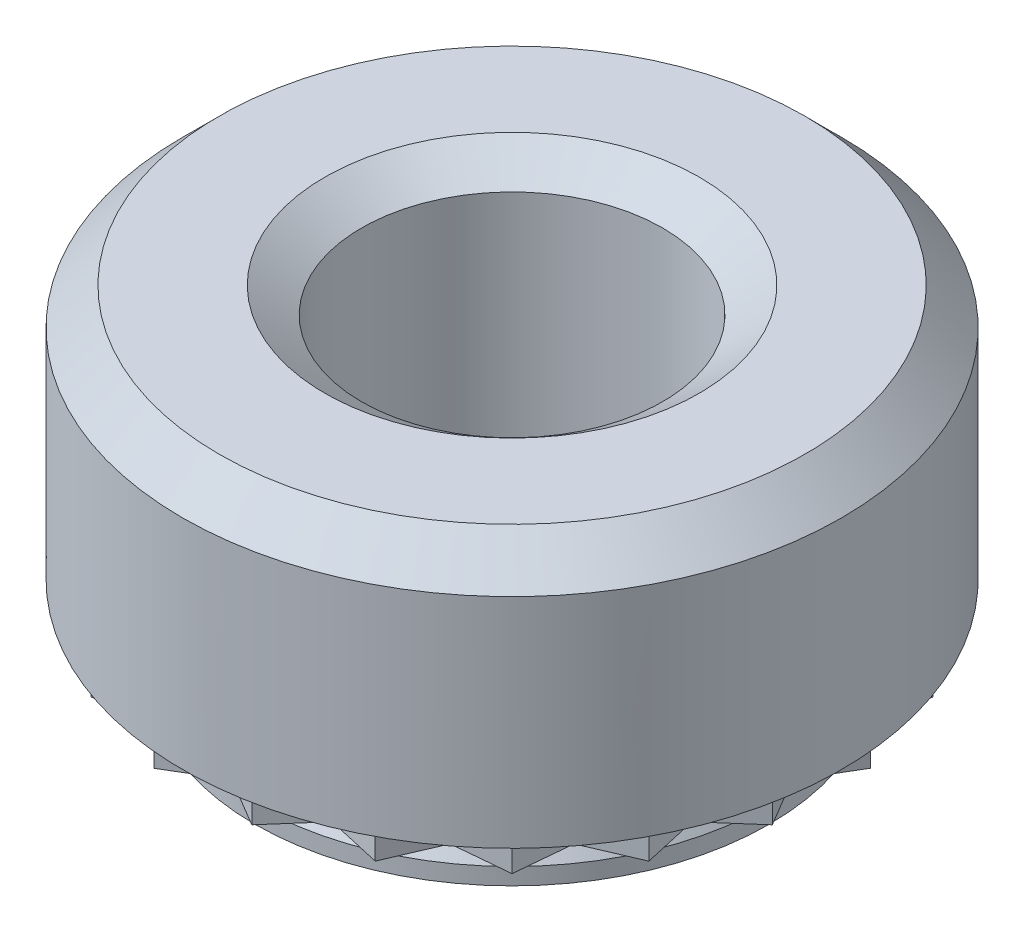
ISO-10303-21;
HEADER;
FILE_DESCRIPTION(('STEP AP214'),'2;1');
FILE_NAME('part.step','',(''),(''),'','','');
FILE_SCHEMA(('AUTOMOTIVE_DESIGN { 1 0 10303 214 1 1 1 1 }'));
ENDSEC;
DATA;
#1=APPLICATION_CONTEXT('core data for automotive mechanical design processes');
#2=APPLICATION_PROTOCOL_DEFINITION('international standard','automotive_design',2000,#1);
#3=PRODUCT_CONTEXT('',#1,'mechanical');
#4=PRODUCT('Part','Part','',(#3));
#5=PRODUCT_RELATED_PRODUCT_CATEGORY('part','',(#4));
#6=PRODUCT_DEFINITION_FORMATION('','',#4);
#7=PRODUCT_DEFINITION_CONTEXT('part definition',#1,'design');
#8=PRODUCT_DEFINITION('design','',#6,#7);
#9=PRODUCT_DEFINITION_SHAPE('','',#8);
#10=(LENGTH_UNIT() NAMED_UNIT(*) SI_UNIT(.MILLI.,.METRE.));
#11=(NAMED_UNIT(*) PLANE_ANGLE_UNIT() SI_UNIT($,.RADIAN.));
#12=(NAMED_UNIT(*) SI_UNIT($,.STERADIAN.) SOLID_ANGLE_UNIT());
#13=UNCERTAINTY_MEASURE_WITH_UNIT(LENGTH_MEASURE(1.E-05),#10,'distance_accuracy_value','');
#14=(GEOMETRIC_REPRESENTATION_CONTEXT(3) GLOBAL_UNCERTAINTY_ASSIGNED_CONTEXT((#13)) GLOBAL_UNIT_ASSIGNED_CONTEXT((#10,
#11,#12)) REPRESENTATION_CONTEXT('',''));
#15=CARTESIAN_POINT('',(0.,0.,0.));
#16=DIRECTION('',(0.,0.,1.));
#17=DIRECTION('',(1.,0.,0.));
#18=AXIS2_PLACEMENT_3D('',#15,#16,#17);
#19=CARTESIAN_POINT('',(4.02761079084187,0.,0.));
#20=DIRECTION('',(0.,-1.,0.));
#21=DIRECTION('',(0.,0.,-1.));
#22=AXIS2_PLACEMENT_3D('',#19,#20,#21);
#23=PLANE('',#22);
#24=CARTESIAN_POINT('',(0.,0.,0.));
#25=DIRECTION('',(0.,-1.,0.));
#26=DIRECTION('',(0.,0.,-1.));
#27=AXIS2_PLACEMENT_3D('',#24,#25,#26);
#28=CIRCLE('',#27,5.588);
#29=CARTESIAN_POINT('',(0.,0.,-5.588));
#30=VERTEX_POINT('',#29);
#31=EDGE_CURVE('E178',#30,#30,#28,.T.);
#32=ORIENTED_EDGE('',*,*,#31,.T.);
#33=EDGE_LOOP('',(#32));
#34=FACE_BOUND('',#33,.T.);
#35=DIRECTION('',(-0.859689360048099,0.,-0.5108171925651));
#36=VECTOR('',#35,1.);
#37=CARTESIAN_POINT('',(0.830448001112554,0.,5.24324232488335));
#38=LINE('',#37,#36);
#39=CARTESIAN_POINT('',(0.830448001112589,0.,5.24324232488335));
#40=VERTEX_POINT('',#39);
#41=CARTESIAN_POINT('',(0.,0.,4.7498));
#42=VERTEX_POINT('',#41);
#43=EDGE_CURVE('E70',#40,#42,#38,.T.);
#44=ORIENTED_EDGE('',*,*,#43,.F.);
#45=DIRECTION('',(-0.659761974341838,0.,0.751474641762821));
#46=VECTOR('',#45,1.);
#47=CARTESIAN_POINT('',(1.46776891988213,0.,4.51732824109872));
#48=LINE('',#47,#46);
#49=CARTESIAN_POINT('',(1.46776891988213,0.,4.51732824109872));
#50=VERTEX_POINT('',#49);
#51=EDGE_CURVE('E611',#50,#40,#48,.T.);
#52=ORIENTED_EDGE('',*,*,#51,.F.);
#53=DIRECTION('',(-0.975464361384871,0.,-0.220157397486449));
#54=VECTOR('',#53,1.);
#55=CARTESIAN_POINT('',(2.41005396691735,0.,4.72999723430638));
#56=LINE('',#55,#54);
#57=CARTESIAN_POINT('',(2.41005396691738,0.,4.72999723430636));
#58=VERTEX_POINT('',#57);
#59=EDGE_CURVE('E613',#58,#50,#56,.T.);
#60=ORIENTED_EDGE('',*,*,#59,.F.);
#61=DIRECTION('',(-0.395252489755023,0.,0.918572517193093));
#62=VECTOR('',#61,1.);
#63=CARTESIAN_POINT('',(2.79186239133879,0.,3.84266891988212));
#64=LINE('',#63,#62);
#65=CARTESIAN_POINT('',(2.79186239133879,0.,3.84266891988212));
#66=VERTEX_POINT('',#65);
#67=EDGE_CURVE('E638',#66,#58,#64,.T.);
#68=ORIENTED_EDGE('',*,*,#67,.F.);
#69=DIRECTION('',(-0.995754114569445,0.,0.0920529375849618));
#70=VECTOR('',#69,1.);
#71=CARTESIAN_POINT('',(3.7537470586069,0.,3.75374705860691));
#72=LINE('',#71,#70);
#73=CARTESIAN_POINT('',(3.75374705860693,0.,3.75374705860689));
#74=VERTEX_POINT('',#73);
#75=EDGE_CURVE('E641',#74,#66,#72,.T.);
#76=ORIENTED_EDGE('',*,*,#75,.F.);
#77=DIRECTION('',(-0.0920529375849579,0.,0.995754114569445));
#78=VECTOR('',#77,1.);
#79=CARTESIAN_POINT('',(3.84266891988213,0.,2.79186239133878));
#80=LINE('',#79,#78);
#81=CARTESIAN_POINT('',(3.84266891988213,0.,2.79186239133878));
#82=VERTEX_POINT('',#81);
#83=EDGE_CURVE('E672',#82,#74,#80,.T.);
#84=ORIENTED_EDGE('',*,*,#83,.F.);
#85=DIRECTION('',(-0.918572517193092,0.,0.395252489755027));
#86=VECTOR('',#85,1.);
#87=CARTESIAN_POINT('',(4.72999723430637,0.,2.41005396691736));
#88=LINE('',#87,#86);
#89=CARTESIAN_POINT('',(4.72999723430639,0.,2.41005396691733));
#90=VERTEX_POINT('',#89);
#91=EDGE_CURVE('E675',#90,#82,#88,.T.);
#92=ORIENTED_EDGE('',*,*,#91,.F.);
#93=DIRECTION('',(0.220157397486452,0.,0.97546436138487));
#94=VECTOR('',#93,1.);
#95=CARTESIAN_POINT('',(4.51732824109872,0.,1.46776891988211));
#96=LINE('',#95,#94);
#97=CARTESIAN_POINT('',(4.51732824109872,0.,1.46776891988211));
#98=VERTEX_POINT('',#97);
#99=EDGE_CURVE('E708',#98,#90,#96,.T.);
#100=ORIENTED_EDGE('',*,*,#99,.F.);
#101=DIRECTION('',(-0.751474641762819,0.,0.659761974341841));
#102=VECTOR('',#101,1.);
#103=CARTESIAN_POINT('',(5.24324232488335,0.,0.83044800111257));
#104=LINE('',#103,#102);
#105=CARTESIAN_POINT('',(5.24324232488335,0.,0.830448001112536));
#106=VERTEX_POINT('',#105);
#107=EDGE_CURVE('E711',#106,#98,#104,.T.);
#108=ORIENTED_EDGE('',*,*,#107,.F.);
#109=DIRECTION('',(0.510817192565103,0.,0.859689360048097));
#110=VECTOR('',#109,1.);
#111=CARTESIAN_POINT('',(4.7498,0.,0.));
#112=LINE('',#111,#110);
#113=CARTESIAN_POINT('',(4.7498,0.,0.));
#114=VERTEX_POINT('',#113);
#115=EDGE_CURVE('E744',#114,#106,#112,.T.);
#116=ORIENTED_EDGE('',*,*,#115,.F.);
#117=DIRECTION('',(-0.510817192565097,0.,0.8596893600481));
#118=VECTOR('',#117,1.);
#119=CARTESIAN_POINT('',(5.24324232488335,0.,-0.830448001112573));
#120=LINE('',#119,#118);
#121=CARTESIAN_POINT('',(5.24324232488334,0.,-0.830448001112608));
#122=VERTEX_POINT('',#121);
#123=EDGE_CURVE('E747',#122,#114,#120,.T.);
#124=ORIENTED_EDGE('',*,*,#123,.F.);
#125=DIRECTION('',(0.751474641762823,0.,0.659761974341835));
#126=VECTOR('',#125,1.);
#127=CARTESIAN_POINT('',(4.51732824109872,0.,-1.46776891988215));
#128=LINE('',#127,#126);
#129=CARTESIAN_POINT('',(4.51732824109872,0.,-1.46776891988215));
#130=VERTEX_POINT('',#129);
#131=EDGE_CURVE('E780',#130,#122,#128,.T.);
#132=ORIENTED_EDGE('',*,*,#131,.F.);
#133=DIRECTION('',(-0.220157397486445,0.,0.975464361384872));
#134=VECTOR('',#133,1.);
#135=CARTESIAN_POINT('',(4.72999723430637,0.,-2.41005396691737));
#136=LINE('',#135,#134);
#137=CARTESIAN_POINT('',(4.72999723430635,0.,-2.4100539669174));
#138=VERTEX_POINT('',#137);
#139=EDGE_CURVE('E783',#138,#130,#136,.T.);
#140=ORIENTED_EDGE('',*,*,#139,.F.);
#141=DIRECTION('',(0.918572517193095,0.,0.39525248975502));
#142=VECTOR('',#141,1.);
#143=CARTESIAN_POINT('',(3.84266891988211,0.,-2.79186239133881));
#144=LINE('',#143,#142);
#145=CARTESIAN_POINT('',(3.84266891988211,0.,-2.79186239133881));
#146=VERTEX_POINT('',#145);
#147=EDGE_CURVE('E816',#146,#138,#144,.T.);
#148=ORIENTED_EDGE('',*,*,#147,.F.);
#149=DIRECTION('',(0.0920529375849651,0.,0.995754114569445));
#150=VECTOR('',#149,1.);
#151=CARTESIAN_POINT('',(3.7537470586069,0.,-3.75374705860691));
#152=LINE('',#151,#150);
#153=CARTESIAN_POINT('',(3.75374705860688,0.,-3.75374705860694));
#154=VERTEX_POINT('',#153);
#155=EDGE_CURVE('E819',#154,#146,#152,.T.);
#156=ORIENTED_EDGE('',*,*,#155,.F.);
#157=DIRECTION('',(0.995754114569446,0.,0.0920529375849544));
#158=VECTOR('',#157,1.);
#159=CARTESIAN_POINT('',(2.79186239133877,0.,-3.84266891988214));
#160=LINE('',#159,#158);
#161=CARTESIAN_POINT('',(2.79186239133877,0.,-3.84266891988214));
#162=VERTEX_POINT('',#161);
#163=EDGE_CURVE('E852',#162,#154,#160,.T.);
#164=ORIENTED_EDGE('',*,*,#163,.F.);
#165=DIRECTION('',(0.39525248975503,0.,0.91857251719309));
#166=VECTOR('',#165,1.);
#167=CARTESIAN_POINT('',(2.41005396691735,0.,-4.72999723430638));
#168=LINE('',#167,#166);
#169=CARTESIAN_POINT('',(2.41005396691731,0.,-4.72999723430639));
#170=VERTEX_POINT('',#169);
#171=EDGE_CURVE('E855',#170,#162,#168,.T.);
#172=ORIENTED_EDGE('',*,*,#171,.F.);
#173=DIRECTION('',(0.975464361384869,0.,-0.220157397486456));
#174=VECTOR('',#173,1.);
#175=CARTESIAN_POINT('',(1.4677689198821,0.,-4.51732824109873));
#176=LINE('',#175,#174);
#177=CARTESIAN_POINT('',(1.4677689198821,0.,-4.51732824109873));
#178=VERTEX_POINT('',#177);
#179=EDGE_CURVE('E888',#178,#170,#176,.T.);
#180=ORIENTED_EDGE('',*,*,#179,.F.);
#181=DIRECTION('',(0.659761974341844,0.,0.751474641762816));
#182=VECTOR('',#181,1.);
#183=CARTESIAN_POINT('',(0.830448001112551,0.,-5.24324232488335));
#184=LINE('',#183,#182);
#185=CARTESIAN_POINT('',(0.830448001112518,0.,-5.24324232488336));
#186=VERTEX_POINT('',#185);
#187=EDGE_CURVE('E891',#186,#178,#184,.T.);
#188=ORIENTED_EDGE('',*,*,#187,.F.);
#189=DIRECTION('',(0.859689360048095,0.,-0.510817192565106));
#190=VECTOR('',#189,1.);
#191=CARTESIAN_POINT('',(0.,0.,-4.7498));
#192=LINE('',#191,#190);
#193=CARTESIAN_POINT('',(0.,0.,-4.7498));
#194=VERTEX_POINT('',#193);
#195=EDGE_CURVE('E924',#194,#186,#192,.T.);
#196=ORIENTED_EDGE('',*,*,#195,.F.);
#197=DIRECTION('',(0.859689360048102,0.,0.510817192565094));
#198=VECTOR('',#197,1.);
#199=CARTESIAN_POINT('',(-0.830448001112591,0.,-5.24324232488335));
#200=LINE('',#199,#198);
#201=CARTESIAN_POINT('',(-0.830448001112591,0.,-5.24324232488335));
#202=VERTEX_POINT('',#201);
#203=EDGE_CURVE('E927',#202,#194,#200,.T.);
#204=ORIENTED_EDGE('',*,*,#203,.F.);
#205=DIRECTION('',(0.659761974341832,0.,-0.751474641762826));
#206=VECTOR('',#205,1.);
#207=CARTESIAN_POINT('',(-1.46776891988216,0.,-4.51732824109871));
#208=LINE('',#207,#206);
#209=CARTESIAN_POINT('',(-1.46776891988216,0.,-4.51732824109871));
#210=VERTEX_POINT('',#209);
#211=EDGE_CURVE('E960',#210,#202,#208,.T.);
#212=ORIENTED_EDGE('',*,*,#211,.F.);
#213=DIRECTION('',(0.975464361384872,0.,0.220157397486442));
#214=VECTOR('',#213,1.);
#215=CARTESIAN_POINT('',(-2.41005396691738,0.,-4.72999723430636));
#216=LINE('',#215,#214);
#217=CARTESIAN_POINT('',(-2.41005396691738,0.,-4.72999723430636));
#218=VERTEX_POINT('',#217);
#219=EDGE_CURVE('E963',#218,#210,#216,.T.);
#220=ORIENTED_EDGE('',*,*,#219,.F.);
#221=DIRECTION('',(0.395252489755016,0.,-0.918572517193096));
#222=VECTOR('',#221,1.);
#223=CARTESIAN_POINT('',(-2.79186239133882,0.,-3.8426689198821));
#224=LINE('',#223,#222);
#225=CARTESIAN_POINT('',(-2.79186239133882,0.,-3.8426689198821));
#226=VERTEX_POINT('',#225);
#227=EDGE_CURVE('E996',#226,#218,#224,.T.);
#228=ORIENTED_EDGE('',*,*,#227,.F.);
#229=DIRECTION('',(0.995754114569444,0.,-0.0920529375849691));
#230=VECTOR('',#229,1.);
#231=CARTESIAN_POINT('',(-3.75374705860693,0.,-3.75374705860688));
#232=LINE('',#231,#230);
#233=CARTESIAN_POINT('',(-3.75374705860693,0.,-3.75374705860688));
#234=VERTEX_POINT('',#233);
#235=EDGE_CURVE('E999',#234,#226,#232,.T.);
#236=ORIENTED_EDGE('',*,*,#235,.F.);
#237=DIRECTION('',(0.0920529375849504,0.,-0.995754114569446));
#238=VECTOR('',#237,1.);
#239=CARTESIAN_POINT('',(-3.84266891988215,0.,-2.79186239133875));
#240=LINE('',#239,#238);
#241=CARTESIAN_POINT('',(-3.84266891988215,0.,-2.79186239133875));
#242=VERTEX_POINT('',#241);
#243=EDGE_CURVE('E1032',#242,#234,#240,.T.);
#244=ORIENTED_EDGE('',*,*,#243,.F.);
#245=DIRECTION('',(0.918572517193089,0.,-0.395252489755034));
#246=VECTOR('',#245,1.);
#247=CARTESIAN_POINT('',(-4.72999723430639,0.,-2.41005396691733));
#248=LINE('',#247,#246);
#249=CARTESIAN_POINT('',(-4.72999723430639,0.,-2.41005396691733));
#250=VERTEX_POINT('',#249);
#251=EDGE_CURVE('E1035',#250,#242,#248,.T.);
#252=ORIENTED_EDGE('',*,*,#251,.F.);
#253=DIRECTION('',(-0.220157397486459,0.,-0.975464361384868));
#254=VECTOR('',#253,1.);
#255=CARTESIAN_POINT('',(-4.51732824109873,0.,-1.46776891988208));
#256=LINE('',#255,#254);
#257=CARTESIAN_POINT('',(-4.51732824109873,0.,-1.46776891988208));
#258=VERTEX_POINT('',#257);
#259=EDGE_CURVE('E1068',#258,#250,#256,.T.);
#260=ORIENTED_EDGE('',*,*,#259,.F.);
#261=DIRECTION('',(0.751474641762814,0.,-0.659761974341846));
#262=VECTOR('',#261,1.);
#263=CARTESIAN_POINT('',(-5.24324232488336,0.,-0.830448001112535));
#264=LINE('',#263,#262);
#265=CARTESIAN_POINT('',(-5.24324232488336,0.,-0.830448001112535));
#266=VERTEX_POINT('',#265);
#267=EDGE_CURVE('E1071',#266,#258,#264,.T.);
#268=ORIENTED_EDGE('',*,*,#267,.F.);
#269=DIRECTION('',(-0.510817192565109,0.,-0.859689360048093));
#270=VECTOR('',#269,1.);
#271=CARTESIAN_POINT('',(-4.7498,0.,0.));
#272=LINE('',#271,#270);
#273=CARTESIAN_POINT('',(-4.7498,0.,0.));
#274=VERTEX_POINT('',#273);
#275=EDGE_CURVE('E1104',#274,#266,#272,.T.);
#276=ORIENTED_EDGE('',*,*,#275,.F.);
#277=DIRECTION('',(0.510817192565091,0.,-0.859689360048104));
#278=VECTOR('',#277,1.);
#279=CARTESIAN_POINT('',(-5.24324232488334,0.,0.830448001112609));
#280=LINE('',#279,#278);
#281=CARTESIAN_POINT('',(-5.24324232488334,0.,0.830448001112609));
#282=VERTEX_POINT('',#281);
#283=EDGE_CURVE('E1107',#282,#274,#280,.T.);
#284=ORIENTED_EDGE('',*,*,#283,.F.);
#285=DIRECTION('',(-0.751474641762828,0.,-0.65976197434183));
#286=VECTOR('',#285,1.);
#287=CARTESIAN_POINT('',(-4.5173282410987,0.,1.46776891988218));
#288=LINE('',#287,#286);
#289=CARTESIAN_POINT('',(-4.5173282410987,0.,1.46776891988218));
#290=VERTEX_POINT('',#289);
#291=EDGE_CURVE('E1140',#290,#282,#288,.T.);
#292=ORIENTED_EDGE('',*,*,#291,.F.);
#293=DIRECTION('',(0.220157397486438,0.,-0.975464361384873));
#294=VECTOR('',#293,1.);
#295=CARTESIAN_POINT('',(-4.72999723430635,0.,2.4100539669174));
#296=LINE('',#295,#294);
#297=CARTESIAN_POINT('',(-4.72999723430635,0.,2.4100539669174));
#298=VERTEX_POINT('',#297);
#299=EDGE_CURVE('E1143',#298,#290,#296,.T.);
#300=ORIENTED_EDGE('',*,*,#299,.F.);
#301=DIRECTION('',(-0.918572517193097,0.,-0.395252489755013));
#302=VECTOR('',#301,1.);
#303=CARTESIAN_POINT('',(-3.84266891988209,0.,2.79186239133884));
#304=LINE('',#303,#302);
#305=CARTESIAN_POINT('',(-3.84266891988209,0.,2.79186239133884));
#306=VERTEX_POINT('',#305);
#307=EDGE_CURVE('E1176',#306,#298,#304,.T.);
#308=ORIENTED_EDGE('',*,*,#307,.F.);
#309=DIRECTION('',(-0.0920529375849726,0.,-0.995754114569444));
#310=VECTOR('',#309,1.);
#311=CARTESIAN_POINT('',(-3.75374705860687,0.,3.75374705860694));
#312=LINE('',#311,#310);
#313=CARTESIAN_POINT('',(-3.75374705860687,0.,3.75374705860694));
#314=VERTEX_POINT('',#313);
#315=EDGE_CURVE('E1179',#314,#306,#312,.T.);
#316=ORIENTED_EDGE('',*,*,#315,.F.);
#317=DIRECTION('',(-0.995754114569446,0.,-0.0920529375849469));
#318=VECTOR('',#317,1.);
#319=CARTESIAN_POINT('',(-2.79186239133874,0.,3.84266891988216));
#320=LINE('',#319,#318);
#321=CARTESIAN_POINT('',(-2.79186239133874,0.,3.84266891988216));
#322=VERTEX_POINT('',#321);
#323=EDGE_CURVE('E1212',#322,#314,#320,.T.);
#324=ORIENTED_EDGE('',*,*,#323,.F.);
#325=DIRECTION('',(-0.395252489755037,0.,-0.918572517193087));
#326=VECTOR('',#325,1.);
#327=CARTESIAN_POINT('',(-2.41005396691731,0.,4.72999723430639));
#328=LINE('',#327,#326);
#329=CARTESIAN_POINT('',(-2.41005396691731,0.,4.72999723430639));
#330=VERTEX_POINT('',#329);
#331=EDGE_CURVE('E1215',#330,#322,#328,.T.);
#332=ORIENTED_EDGE('',*,*,#331,.F.);
#333=DIRECTION('',(-0.975464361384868,0.,0.220157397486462));
#334=VECTOR('',#333,1.);
#335=CARTESIAN_POINT('',(-1.46776891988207,0.,4.51732824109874));
#336=LINE('',#335,#334);
#337=CARTESIAN_POINT('',(-1.46776891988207,0.,4.51732824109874));
#338=VERTEX_POINT('',#337);
#339=EDGE_CURVE('E1235',#338,#330,#336,.T.);
#340=ORIENTED_EDGE('',*,*,#339,.F.);
#341=DIRECTION('',(-0.659761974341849,0.,-0.751474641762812));
#342=VECTOR('',#341,1.);
#343=CARTESIAN_POINT('',(-0.830448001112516,0.,5.24324232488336));
#344=LINE('',#343,#342);
#345=CARTESIAN_POINT('',(-0.830448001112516,0.,5.24324232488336));
#346=VERTEX_POINT('',#345);
#347=EDGE_CURVE('E1238',#346,#338,#344,.T.);
#348=ORIENTED_EDGE('',*,*,#347,.F.);
#349=DIRECTION('',(-0.859689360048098,0.,0.5108171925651));
#350=VECTOR('',#349,1.);
#351=CARTESIAN_POINT('',(0.,0.,4.7498));
#352=LINE('',#351,#350);
#353=EDGE_CURVE('E589',#42,#346,#352,.T.);
#354=ORIENTED_EDGE('',*,*,#353,.F.);
#355=EDGE_LOOP('',(#44,#52,#60,#68,#76,#84,#92,#100,#108,#116,#124,#132,#140,#148,#156,#164,
#172,#180,#188,#196,#204,#212,#220,#228,#236,#244,#252,#260,#268,#276,#284,#292,#300,#308,#316,
#324,#332,#340,#348,#354));
#356=FACE_BOUND('',#355,.T.);
#357=ADVANCED_FACE('F33',(#34,#356),#23,.T.);
#358=CARTESIAN_POINT('',(0.,0.,0.));
#359=DIRECTION('',(0.,-1.,0.));
#360=DIRECTION('',(0.,0.,-1.));
#361=AXIS2_PLACEMENT_3D('',#358,#359,#360);
#362=CIRCLE('',#361,4.02761079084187);
#363=CARTESIAN_POINT('',(0.,0.,-4.02761079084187));
#364=VERTEX_POINT('',#363);
#365=EDGE_CURVE('E175',#364,#364,#362,.T.);
#366=ORIENTED_EDGE('',*,*,#365,.F.);
#367=EDGE_LOOP('',(#366));
#368=FACE_BOUND('',#367,.T.);
#369=DIRECTION('',(0.975464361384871,0.,0.220157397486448));
#370=VECTOR('',#369,1.);
#371=CARTESIAN_POINT('',(1.40905816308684,0.,4.33663511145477));
#372=LINE('',#371,#370);
#373=CARTESIAN_POINT('',(1.40905816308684,0.,4.33663511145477));
#374=VERTEX_POINT('',#373);
#375=CARTESIAN_POINT('',(2.31365180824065,0.,4.54079734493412));
#376=VERTEX_POINT('',#375);
#377=EDGE_CURVE('E104',#374,#376,#372,.T.);
#378=ORIENTED_EDGE('',*,*,#377,.F.);
#379=DIRECTION('',(0.659761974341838,0.,-0.751474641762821));
#380=VECTOR('',#379,1.);
#381=CARTESIAN_POINT('',(0.797230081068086,0.,5.03351263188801));
#382=LINE('',#381,#380);
#383=CARTESIAN_POINT('',(0.797230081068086,0.,5.03351263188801));
#384=VERTEX_POINT('',#383);
#385=EDGE_CURVE('E609',#384,#374,#382,.T.);
#386=ORIENTED_EDGE('',*,*,#385,.F.);
#387=DIRECTION('',(0.859689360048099,0.,0.5108171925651));
#388=VECTOR('',#387,1.);
#389=CARTESIAN_POINT('',(0.,0.,4.559808));
#390=LINE('',#389,#388);
#391=CARTESIAN_POINT('',(0.,0.,4.559808));
#392=VERTEX_POINT('',#391);
#393=EDGE_CURVE('E138',#392,#384,#390,.T.);
#394=ORIENTED_EDGE('',*,*,#393,.F.);
#395=DIRECTION('',(0.859689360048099,0.,-0.5108171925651));
#396=VECTOR('',#395,1.);
#397=CARTESIAN_POINT('',(-0.797230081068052,0.,5.03351263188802));
#398=LINE('',#397,#396);
#399=CARTESIAN_POINT('',(-0.797230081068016,0.,5.03351263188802));
#400=VERTEX_POINT('',#399);
#401=EDGE_CURVE('E588',#400,#392,#398,.T.);
#402=ORIENTED_EDGE('',*,*,#401,.F.);
#403=DIRECTION('',(0.659761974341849,0.,0.751474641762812));
#404=VECTOR('',#403,1.);
#405=CARTESIAN_POINT('',(-1.40905816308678,0.,4.33663511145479));
#406=LINE('',#405,#404);
#407=CARTESIAN_POINT('',(-1.40905816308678,0.,4.33663511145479));
#408=VERTEX_POINT('',#407);
#409=EDGE_CURVE('E575',#408,#400,#406,.T.);
#410=ORIENTED_EDGE('',*,*,#409,.F.);
#411=DIRECTION('',(0.975464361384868,0.,-0.220157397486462));
#412=VECTOR('',#411,1.);
#413=CARTESIAN_POINT('',(-2.31365180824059,0.,4.54079734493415));
#414=LINE('',#413,#412);
#415=CARTESIAN_POINT('',(-2.31365180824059,0.,4.54079734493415));
#416=VERTEX_POINT('',#415);
#417=EDGE_CURVE('E586',#416,#408,#414,.T.);
#418=ORIENTED_EDGE('',*,*,#417,.F.);
#419=DIRECTION('',(0.395252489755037,0.,0.918572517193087));
#420=VECTOR('',#419,1.);
#421=CARTESIAN_POINT('',(-2.68018789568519,0.,3.68896216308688));
#422=LINE('',#421,#420);
#423=CARTESIAN_POINT('',(-2.68018789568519,0.,3.68896216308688));
#424=VERTEX_POINT('',#423);
#425=EDGE_CURVE('E1205',#424,#416,#422,.T.);
#426=ORIENTED_EDGE('',*,*,#425,.F.);
#427=DIRECTION('',(0.995754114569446,0.,0.0920529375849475));
#428=VECTOR('',#427,1.);
#429=CARTESIAN_POINT('',(-3.60359717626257,0.,3.60359717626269));
#430=LINE('',#429,#428);
#431=CARTESIAN_POINT('',(-3.60359717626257,0.,3.60359717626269));
#432=VERTEX_POINT('',#431);
#433=EDGE_CURVE('E1209',#432,#424,#430,.T.);
#434=ORIENTED_EDGE('',*,*,#433,.F.);
#435=DIRECTION('',(0.0920529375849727,0.,0.995754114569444));
#436=VECTOR('',#435,1.);
#437=CARTESIAN_POINT('',(-3.68896216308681,0.,2.68018789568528));
#438=LINE('',#437,#436);
#439=CARTESIAN_POINT('',(-3.68896216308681,0.,2.68018789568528));
#440=VERTEX_POINT('',#439);
#441=EDGE_CURVE('E1169',#440,#432,#438,.T.);
#442=ORIENTED_EDGE('',*,*,#441,.F.);
#443=DIRECTION('',(0.918572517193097,0.,0.395252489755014));
#444=VECTOR('',#443,1.);
#445=CARTESIAN_POINT('',(-4.54079734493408,0.,2.31365180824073));
#446=LINE('',#445,#444);
#447=CARTESIAN_POINT('',(-4.54079734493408,0.,2.31365180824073));
#448=VERTEX_POINT('',#447);
#449=EDGE_CURVE('E1173',#448,#440,#446,.T.);
#450=ORIENTED_EDGE('',*,*,#449,.F.);
#451=DIRECTION('',(-0.220157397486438,0.,0.975464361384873));
#452=VECTOR('',#451,1.);
#453=CARTESIAN_POINT('',(-4.33663511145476,0.,1.40905816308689));
#454=LINE('',#453,#452);
#455=CARTESIAN_POINT('',(-4.33663511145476,0.,1.40905816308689));
#456=VERTEX_POINT('',#455);
#457=EDGE_CURVE('E1133',#456,#448,#454,.T.);
#458=ORIENTED_EDGE('',*,*,#457,.F.);
#459=DIRECTION('',(0.751474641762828,0.,0.65976197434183));
#460=VECTOR('',#459,1.);
#461=CARTESIAN_POINT('',(-5.03351263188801,0.,0.797230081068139));
#462=LINE('',#461,#460);
#463=CARTESIAN_POINT('',(-5.03351263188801,0.,0.797230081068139));
#464=VERTEX_POINT('',#463);
#465=EDGE_CURVE('E1137',#464,#456,#462,.T.);
#466=ORIENTED_EDGE('',*,*,#465,.F.);
#467=DIRECTION('',(-0.510817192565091,0.,0.859689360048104));
#468=VECTOR('',#467,1.);
#469=CARTESIAN_POINT('',(-4.559808,0.,0.));
#470=LINE('',#469,#468);
#471=CARTESIAN_POINT('',(-4.559808,0.,0.));
#472=VERTEX_POINT('',#471);
#473=EDGE_CURVE('E1097',#472,#464,#470,.T.);
#474=ORIENTED_EDGE('',*,*,#473,.F.);
#475=DIRECTION('',(0.510817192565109,0.,0.859689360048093));
#476=VECTOR('',#475,1.);
#477=CARTESIAN_POINT('',(-5.03351263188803,0.,-0.797230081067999));
#478=LINE('',#477,#476);
#479=CARTESIAN_POINT('',(-5.03351263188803,0.,-0.797230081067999));
#480=VERTEX_POINT('',#479);
#481=EDGE_CURVE('E1101',#480,#472,#478,.T.);
#482=ORIENTED_EDGE('',*,*,#481,.F.);
#483=DIRECTION('',(-0.751474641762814,0.,0.659761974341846));
#484=VECTOR('',#483,1.);
#485=CARTESIAN_POINT('',(-4.33663511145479,0.,-1.4090581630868));
#486=LINE('',#485,#484);
#487=CARTESIAN_POINT('',(-4.33663511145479,0.,-1.4090581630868));
#488=VERTEX_POINT('',#487);
#489=EDGE_CURVE('E1061',#488,#480,#486,.T.);
#490=ORIENTED_EDGE('',*,*,#489,.F.);
#491=DIRECTION('',(0.220157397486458,0.,0.975464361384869));
#492=VECTOR('',#491,1.);
#493=CARTESIAN_POINT('',(-4.54079734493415,0.,-2.31365180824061));
#494=LINE('',#493,#492);
#495=CARTESIAN_POINT('',(-4.54079734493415,0.,-2.31365180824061));
#496=VERTEX_POINT('',#495);
#497=EDGE_CURVE('E1065',#496,#488,#494,.T.);
#498=ORIENTED_EDGE('',*,*,#497,.F.);
#499=DIRECTION('',(-0.918572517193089,0.,0.395252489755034));
#500=VECTOR('',#499,1.);
#501=CARTESIAN_POINT('',(-3.68896216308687,0.,-2.6801878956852));
#502=LINE('',#501,#500);
#503=CARTESIAN_POINT('',(-3.68896216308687,0.,-2.6801878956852));
#504=VERTEX_POINT('',#503);
#505=EDGE_CURVE('E1025',#504,#496,#502,.T.);
#506=ORIENTED_EDGE('',*,*,#505,.F.);
#507=DIRECTION('',(-0.0920529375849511,0.,0.995754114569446));
#508=VECTOR('',#507,1.);
#509=CARTESIAN_POINT('',(-3.60359717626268,0.,-3.60359717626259));
#510=LINE('',#509,#508);
#511=CARTESIAN_POINT('',(-3.60359717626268,0.,-3.60359717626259));
#512=VERTEX_POINT('',#511);
#513=EDGE_CURVE('E1029',#512,#504,#510,.T.);
#514=ORIENTED_EDGE('',*,*,#513,.F.);
#515=DIRECTION('',(-0.995754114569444,0.,0.0920529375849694));
#516=VECTOR('',#515,1.);
#517=CARTESIAN_POINT('',(-2.68018789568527,0.,-3.68896216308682));
#518=LINE('',#517,#516);
#519=CARTESIAN_POINT('',(-2.68018789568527,0.,-3.68896216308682));
#520=VERTEX_POINT('',#519);
#521=EDGE_CURVE('E989',#520,#512,#518,.T.);
#522=ORIENTED_EDGE('',*,*,#521,.F.);
#523=DIRECTION('',(-0.395252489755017,0.,0.918572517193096));
#524=VECTOR('',#523,1.);
#525=CARTESIAN_POINT('',(-2.31365180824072,0.,-4.54079734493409));
#526=LINE('',#525,#524);
#527=CARTESIAN_POINT('',(-2.31365180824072,0.,-4.54079734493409));
#528=VERTEX_POINT('',#527);
#529=EDGE_CURVE('E993',#528,#520,#526,.T.);
#530=ORIENTED_EDGE('',*,*,#529,.F.);
#531=DIRECTION('',(-0.975464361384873,0.,-0.220157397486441));
#532=VECTOR('',#531,1.);
#533=CARTESIAN_POINT('',(-1.40905816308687,0.,-4.33663511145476));
#534=LINE('',#533,#532);
#535=CARTESIAN_POINT('',(-1.40905816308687,0.,-4.33663511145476));
#536=VERTEX_POINT('',#535);
#537=EDGE_CURVE('E953',#536,#528,#534,.T.);
#538=ORIENTED_EDGE('',*,*,#537,.F.);
#539=DIRECTION('',(-0.659761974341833,0.,0.751474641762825));
#540=VECTOR('',#539,1.);
#541=CARTESIAN_POINT('',(-0.797230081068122,0.,-5.03351263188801));
#542=LINE('',#541,#540);
#543=CARTESIAN_POINT('',(-0.797230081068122,0.,-5.03351263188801));
#544=VERTEX_POINT('',#543);
#545=EDGE_CURVE('E957',#544,#536,#542,.T.);
#546=ORIENTED_EDGE('',*,*,#545,.F.);
#547=DIRECTION('',(-0.859689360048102,0.,-0.510817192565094));
#548=VECTOR('',#547,1.);
#549=CARTESIAN_POINT('',(0.,0.,-4.559808));
#550=LINE('',#549,#548);
#551=CARTESIAN_POINT('',(0.,0.,-4.559808));
#552=VERTEX_POINT('',#551);
#553=EDGE_CURVE('E917',#552,#544,#550,.T.);
#554=ORIENTED_EDGE('',*,*,#553,.F.);
#555=DIRECTION('',(-0.859689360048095,0.,0.510817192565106));
#556=VECTOR('',#555,1.);
#557=CARTESIAN_POINT('',(0.797230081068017,0.,-5.03351263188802));
#558=LINE('',#557,#556);
#559=CARTESIAN_POINT('',(0.797230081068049,0.,-5.03351263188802));
#560=VERTEX_POINT('',#559);
#561=EDGE_CURVE('E921',#560,#552,#558,.T.);
#562=ORIENTED_EDGE('',*,*,#561,.F.);
#563=DIRECTION('',(-0.659761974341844,0.,-0.751474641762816));
#564=VECTOR('',#563,1.);
#565=CARTESIAN_POINT('',(1.40905816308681,0.,-4.33663511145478));
#566=LINE('',#565,#564);
#567=CARTESIAN_POINT('',(1.40905816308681,0.,-4.33663511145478));
#568=VERTEX_POINT('',#567);
#569=EDGE_CURVE('E881',#568,#560,#566,.T.);
#570=ORIENTED_EDGE('',*,*,#569,.F.);
#571=DIRECTION('',(-0.975464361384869,0.,0.220157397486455));
#572=VECTOR('',#571,1.);
#573=CARTESIAN_POINT('',(2.31365180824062,0.,-4.54079734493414));
#574=LINE('',#573,#572);
#575=CARTESIAN_POINT('',(2.31365180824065,0.,-4.54079734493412));
#576=VERTEX_POINT('',#575);
#577=EDGE_CURVE('E885',#576,#568,#574,.T.);
#578=ORIENTED_EDGE('',*,*,#577,.F.);
#579=DIRECTION('',(-0.39525248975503,0.,-0.91857251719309));
#580=VECTOR('',#579,1.);
#581=CARTESIAN_POINT('',(2.68018789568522,0.,-3.68896216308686));
#582=LINE('',#581,#580);
#583=CARTESIAN_POINT('',(2.68018789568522,0.,-3.68896216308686));
#584=VERTEX_POINT('',#583);
#585=EDGE_CURVE('E845',#584,#576,#582,.T.);
#586=ORIENTED_EDGE('',*,*,#585,.F.);
#587=DIRECTION('',(-0.995754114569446,0.,-0.092052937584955));
#588=VECTOR('',#587,1.);
#589=CARTESIAN_POINT('',(3.6035971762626,0.,-3.60359717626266));
#590=LINE('',#589,#588);
#591=CARTESIAN_POINT('',(3.60359717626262,0.,-3.60359717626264));
#592=VERTEX_POINT('',#591);
#593=EDGE_CURVE('E849',#592,#584,#590,.T.);
#594=ORIENTED_EDGE('',*,*,#593,.F.);
#595=DIRECTION('',(-0.0920529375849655,0.,-0.995754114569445));
#596=VECTOR('',#595,1.);
#597=CARTESIAN_POINT('',(3.68896216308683,0.,-2.68018789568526));
#598=LINE('',#597,#596);
#599=CARTESIAN_POINT('',(3.68896216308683,0.,-2.68018789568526));
#600=VERTEX_POINT('',#599);
#601=EDGE_CURVE('E809',#600,#592,#598,.T.);
#602=ORIENTED_EDGE('',*,*,#601,.F.);
#603=DIRECTION('',(-0.918572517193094,0.,-0.39525248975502));
#604=VECTOR('',#603,1.);
#605=CARTESIAN_POINT('',(4.5407973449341,0.,-2.3136518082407));
#606=LINE('',#605,#604);
#607=CARTESIAN_POINT('',(4.54079734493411,0.,-2.31365180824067));
#608=VERTEX_POINT('',#607);
#609=EDGE_CURVE('E813',#608,#600,#606,.T.);
#610=ORIENTED_EDGE('',*,*,#609,.F.);
#611=DIRECTION('',(0.220157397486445,0.,-0.975464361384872));
#612=VECTOR('',#611,1.);
#613=CARTESIAN_POINT('',(4.33663511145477,0.,-1.40905816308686));
#614=LINE('',#613,#612);
#615=CARTESIAN_POINT('',(4.33663511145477,0.,-1.40905816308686));
#616=VERTEX_POINT('',#615);
#617=EDGE_CURVE('E773',#616,#608,#614,.T.);
#618=ORIENTED_EDGE('',*,*,#617,.F.);
#619=DIRECTION('',(-0.751474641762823,0.,-0.659761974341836));
#620=VECTOR('',#619,1.);
#621=CARTESIAN_POINT('',(5.03351263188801,0.,-0.797230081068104));
#622=LINE('',#621,#620);
#623=CARTESIAN_POINT('',(5.03351263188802,0.,-0.79723008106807));
#624=VERTEX_POINT('',#623);
#625=EDGE_CURVE('E777',#624,#616,#622,.T.);
#626=ORIENTED_EDGE('',*,*,#625,.F.);
#627=DIRECTION('',(0.510817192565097,0.,-0.859689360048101));
#628=VECTOR('',#627,1.);
#629=CARTESIAN_POINT('',(4.559808,0.,0.));
#630=LINE('',#629,#628);
#631=CARTESIAN_POINT('',(4.559808,0.,0.));
#632=VERTEX_POINT('',#631);
#633=EDGE_CURVE('E737',#632,#624,#630,.T.);
#634=ORIENTED_EDGE('',*,*,#633,.F.);
#635=DIRECTION('',(-0.510817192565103,0.,-0.859689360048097));
#636=VECTOR('',#635,1.);
#637=CARTESIAN_POINT('',(5.03351263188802,0.,0.797230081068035));
#638=LINE('',#637,#636);
#639=CARTESIAN_POINT('',(5.03351263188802,0.,0.797230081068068));
#640=VERTEX_POINT('',#639);
#641=EDGE_CURVE('E741',#640,#632,#638,.T.);
#642=ORIENTED_EDGE('',*,*,#641,.F.);
#643=DIRECTION('',(0.751474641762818,0.,-0.659761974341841));
#644=VECTOR('',#643,1.);
#645=CARTESIAN_POINT('',(4.33663511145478,0.,1.40905816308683));
#646=LINE('',#645,#644);
#647=CARTESIAN_POINT('',(4.33663511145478,0.,1.40905816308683));
#648=VERTEX_POINT('',#647);
#649=EDGE_CURVE('E701',#648,#640,#646,.T.);
#650=ORIENTED_EDGE('',*,*,#649,.F.);
#651=DIRECTION('',(-0.220157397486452,0.,-0.97546436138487));
#652=VECTOR('',#651,1.);
#653=CARTESIAN_POINT('',(4.54079734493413,0.,2.31365180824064));
#654=LINE('',#653,#652);
#655=CARTESIAN_POINT('',(4.54079734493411,0.,2.31365180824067));
#656=VERTEX_POINT('',#655);
#657=EDGE_CURVE('E705',#656,#648,#654,.T.);
#658=ORIENTED_EDGE('',*,*,#657,.F.);
#659=DIRECTION('',(0.918572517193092,0.,-0.395252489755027));
#660=VECTOR('',#659,1.);
#661=CARTESIAN_POINT('',(3.68896216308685,0.,2.68018789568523));
#662=LINE('',#661,#660);
#663=CARTESIAN_POINT('',(3.68896216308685,0.,2.68018789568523));
#664=VERTEX_POINT('',#663);
#665=EDGE_CURVE('E665',#664,#656,#662,.T.);
#666=ORIENTED_EDGE('',*,*,#665,.F.);
#667=DIRECTION('',(0.0920529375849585,0.,-0.995754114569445));
#668=VECTOR('',#667,1.);
#669=CARTESIAN_POINT('',(3.60359717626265,0.,3.60359717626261));
#670=LINE('',#669,#668);
#671=CARTESIAN_POINT('',(3.60359717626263,0.,3.60359717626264));
#672=VERTEX_POINT('',#671);
#673=EDGE_CURVE('E669',#672,#664,#670,.T.);
#674=ORIENTED_EDGE('',*,*,#673,.F.);
#675=DIRECTION('',(0.995754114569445,0.,-0.092052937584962));
#676=VECTOR('',#675,1.);
#677=CARTESIAN_POINT('',(2.68018789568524,0.,3.68896216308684));
#678=LINE('',#677,#676);
#679=CARTESIAN_POINT('',(2.68018789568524,0.,3.68896216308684));
#680=VERTEX_POINT('',#679);
#681=EDGE_CURVE('E631',#680,#672,#678,.T.);
#682=ORIENTED_EDGE('',*,*,#681,.F.);
#683=DIRECTION('',(0.395252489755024,0.,-0.918572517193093));
#684=VECTOR('',#683,1.);
#685=CARTESIAN_POINT('',(2.31365180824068,0.,4.54079734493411));
#686=LINE('',#685,#684);
#687=EDGE_CURVE('E635',#376,#680,#686,.T.);
#688=ORIENTED_EDGE('',*,*,#687,.F.);
#689=EDGE_LOOP('',(#378,#386,#394,#402,#410,#418,#426,#434,#442,#450,#458,#466,#474,#482,#490,
#498,#506,#514,#522,#530,#538,#546,#554,#562,#570,#578,#586,#594,#602,#610,#618,#626,#634,#642,
#650,#658,#666,#674,#682,#688));
#690=FACE_BOUND('',#689,.T.);
#691=ADVANCED_FACE('F203',(#368,#690),#23,.T.);
#692=CARTESIAN_POINT('',(0.,0.,0.));
#693=DIRECTION('',(0.,-1.,0.));
#694=DIRECTION('',(0.,0.,-1.));
#695=AXIS2_PLACEMENT_3D('',#692,#693,#694);
#696=CYLINDRICAL_SURFACE('',#695,5.588);
#697=CARTESIAN_POINT('',(0.,3.6957,0.));
#698=DIRECTION('',(0.,1.,0.));
#699=DIRECTION('',(0.,0.,1.));
#700=AXIS2_PLACEMENT_3D('',#697,#698,#699);
#701=CIRCLE('',#700,5.588);
#702=CARTESIAN_POINT('',(0.,3.6957,5.588));
#703=VERTEX_POINT('',#702);
#704=EDGE_CURVE('E42',#703,#703,#701,.F.);
#705=ORIENTED_EDGE('',*,*,#704,.T.);
#706=EDGE_LOOP('',(#705));
#707=FACE_BOUND('',#706,.T.);
#708=ORIENTED_EDGE('',*,*,#31,.F.);
#709=EDGE_LOOP('',(#708));
#710=FACE_BOUND('',#709,.T.);
#711=ADVANCED_FACE('F184',(#707,#710),#696,.T.);
#712=CARTESIAN_POINT('',(0.,0.,0.));
#713=DIRECTION('',(0.,-1.,0.));
#714=DIRECTION('',(0.,0.,-1.));
#715=AXIS2_PLACEMENT_3D('',#712,#713,#714);
#716=CYLINDRICAL_SURFACE('',#715,4.02761079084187);
#717=ORIENTED_EDGE('',*,*,#365,.T.);
#718=EDGE_LOOP('',(#717));
#719=FACE_BOUND('',#718,.T.);
#720=CARTESIAN_POINT('',(0.,-0.56896,0.));
#721=DIRECTION('',(0.,-1.,0.));
#722=DIRECTION('',(0.,0.,-1.));
#723=AXIS2_PLACEMENT_3D('',#720,#721,#722);
#724=CIRCLE('',#723,4.02761079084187);
#725=CARTESIAN_POINT('',(0.,-0.56896,-4.02761079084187));
#726=VERTEX_POINT('',#725);
#727=EDGE_CURVE('E172',#726,#726,#724,.T.);
#728=ORIENTED_EDGE('',*,*,#727,.F.);
#729=EDGE_LOOP('',(#728));
#730=FACE_BOUND('',#729,.T.);
#731=ADVANCED_FACE('F212',(#719,#730),#716,.T.);
#732=CARTESIAN_POINT('',(0.,-1.13792,0.));
#733=DIRECTION('',(0.,-1.,0.));
#734=DIRECTION('',(0.,0.,-1.));
#735=AXIS2_PLACEMENT_3D('',#732,#733,#734);
#736=CONICAL_SURFACE('',#735,4.3561,0.523598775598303);
#737=ORIENTED_EDGE('',*,*,#727,.T.);
#738=EDGE_LOOP('',(#737));
#739=FACE_BOUND('',#738,.T.);
#740=CARTESIAN_POINT('',(0.,-1.13792,0.));
#741=DIRECTION('',(0.,-1.,0.));
#742=DIRECTION('',(0.,0.,-1.));
#743=AXIS2_PLACEMENT_3D('',#740,#741,#742);
#744=CIRCLE('',#743,4.3561);
#745=CARTESIAN_POINT('',(0.,-1.13792,-4.3561));
#746=VERTEX_POINT('',#745);
#747=EDGE_CURVE('E169',#746,#746,#744,.T.);
#748=ORIENTED_EDGE('',*,*,#747,.F.);
#749=EDGE_LOOP('',(#748));
#750=FACE_BOUND('',#749,.T.);
#751=ADVANCED_FACE('F218',(#739,#750),#736,.T.);
#752=CARTESIAN_POINT('',(0.,0.,0.));
#753=DIRECTION('',(0.,-1.,0.));
#754=DIRECTION('',(0.,0.,-1.));
#755=AXIS2_PLACEMENT_3D('',#752,#753,#754);
#756=CYLINDRICAL_SURFACE('',#755,4.3561);
#757=ORIENTED_EDGE('',*,*,#747,.T.);
#758=EDGE_LOOP('',(#757));
#759=FACE_BOUND('',#758,.T.);
#760=CARTESIAN_POINT('',(0.,-1.4224,0.));
#761=DIRECTION('',(0.,-1.,0.));
#762=DIRECTION('',(0.,0.,-1.));
#763=AXIS2_PLACEMENT_3D('',#760,#761,#762);
#764=CIRCLE('',#763,4.3561);
#765=CARTESIAN_POINT('',(0.,-1.4224,-4.3561));
#766=VERTEX_POINT('',#765);
#767=EDGE_CURVE('E166',#766,#766,#764,.T.);
#768=ORIENTED_EDGE('',*,*,#767,.F.);
#769=EDGE_LOOP('',(#768));
#770=FACE_BOUND('',#769,.T.);
#771=ADVANCED_FACE('F223',(#759,#770),#756,.T.);
#772=CARTESIAN_POINT('',(2.5527,-1.4224,0.));
#773=DIRECTION('',(0.,-1.,0.));
#774=DIRECTION('',(0.,0.,-1.));
#775=AXIS2_PLACEMENT_3D('',#772,#773,#774);
#776=PLANE('',#775);
#777=CARTESIAN_POINT('',(0.,-1.4224,0.));
#778=DIRECTION('',(0.,-1.,0.));
#779=DIRECTION('',(0.,0.,-1.));
#780=AXIS2_PLACEMENT_3D('',#777,#778,#779);
#781=CIRCLE('',#780,3.175);
#782=CARTESIAN_POINT('',(0.,-1.4224,-3.175));
#783=VERTEX_POINT('',#782);
#784=EDGE_CURVE('E37',#783,#783,#781,.T.);
#785=ORIENTED_EDGE('',*,*,#784,.F.);
#786=EDGE_LOOP('',(#785));
#787=FACE_BOUND('',#786,.T.);
#788=ORIENTED_EDGE('',*,*,#767,.T.);
#789=EDGE_LOOP('',(#788));
#790=FACE_BOUND('',#789,.T.);
#791=ADVANCED_FACE('F233',(#787,#790),#776,.T.);
#792=CARTESIAN_POINT('',(0.,0.,0.));
#793=DIRECTION('',(0.,-1.,0.));
#794=DIRECTION('',(0.,0.,-1.));
#795=AXIS2_PLACEMENT_3D('',#792,#793,#794);
#796=CYLINDRICAL_SURFACE('',#795,2.5527);
#797=CARTESIAN_POINT('',(0.,3.88242269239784,0.));
#798=DIRECTION('',(0.,-1.,0.));
#799=DIRECTION('',(0.,0.,-1.));
#800=AXIS2_PLACEMENT_3D('',#797,#798,#799);
#801=CIRCLE('',#800,2.5527);
#802=CARTESIAN_POINT('',(0.,3.88242269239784,-2.5527));
#803=VERTEX_POINT('',#802);
#804=EDGE_CURVE('E154',#803,#803,#801,.T.);
#805=ORIENTED_EDGE('',*,*,#804,.F.);
#806=EDGE_LOOP('',(#805));
#807=FACE_BOUND('',#806,.T.);
#808=CARTESIAN_POINT('',(0.,-0.984282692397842,0.));
#809=DIRECTION('',(0.,-1.,0.));
#810=DIRECTION('',(0.,0.,-1.));
#811=AXIS2_PLACEMENT_3D('',#808,#809,#810);
#812=CIRCLE('',#811,2.5527);
#813=CARTESIAN_POINT('',(0.,-0.984282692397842,-2.5527));
#814=VERTEX_POINT('',#813);
#815=EDGE_CURVE('E163',#814,#814,#812,.T.);
#816=ORIENTED_EDGE('',*,*,#815,.T.);
#817=EDGE_LOOP('',(#816));
#818=FACE_BOUND('',#817,.T.);
#819=ADVANCED_FACE('F198',(#807,#818),#796,.F.);
#820=CARTESIAN_POINT('',(5.588,4.318,0.));
#821=DIRECTION('',(0.,1.,0.));
#822=DIRECTION('',(0.,0.,1.));
#823=AXIS2_PLACEMENT_3D('',#820,#821,#822);
#824=PLANE('',#823);
#825=CARTESIAN_POINT('',(0.,4.318,0.));
#826=DIRECTION('',(0.,-1.,0.));
#827=DIRECTION('',(0.,0.,-1.));
#828=AXIS2_PLACEMENT_3D('',#825,#826,#827);
#829=CIRCLE('',#828,3.175);
#830=CARTESIAN_POINT('',(0.,4.318,-3.175));
#831=VERTEX_POINT('',#830);
#832=EDGE_CURVE('E157',#831,#831,#829,.T.);
#833=ORIENTED_EDGE('',*,*,#832,.T.);
#834=EDGE_LOOP('',(#833));
#835=FACE_BOUND('',#834,.T.);
#836=CARTESIAN_POINT('',(0.,4.318,0.));
#837=DIRECTION('',(0.,1.,0.));
#838=DIRECTION('',(0.,0.,1.));
#839=AXIS2_PLACEMENT_3D('',#836,#837,#838);
#840=CIRCLE('',#839,4.9657);
#841=CARTESIAN_POINT('',(0.,4.318,4.9657));
#842=VERTEX_POINT('',#841);
#843=EDGE_CURVE('E11',#842,#842,#840,.T.);
#844=ORIENTED_EDGE('',*,*,#843,.T.);
#845=EDGE_LOOP('',(#844));
#846=FACE_BOUND('',#845,.T.);
#847=ADVANCED_FACE('F189',(#835,#846),#824,.T.);
#848=CARTESIAN_POINT('',(0.,3.6957,0.));
#849=DIRECTION('',(0.,-1.,0.));
#850=DIRECTION('',(0.,0.,-1.));
#851=AXIS2_PLACEMENT_3D('',#848,#849,#850);
#852=CONICAL_SURFACE('',#851,5.588,0.78539816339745);
#853=ORIENTED_EDGE('',*,*,#843,.F.);
#854=EDGE_LOOP('',(#853));
#855=FACE_BOUND('',#854,.T.);
#856=ORIENTED_EDGE('',*,*,#704,.F.);
#857=EDGE_LOOP('',(#856));
#858=FACE_BOUND('',#857,.T.);
#859=ADVANCED_FACE('F35',(#855,#858),#852,.T.);
#860=CARTESIAN_POINT('',(0.,-1.41986,0.));
#861=DIRECTION('',(0.,-1.,0.));
#862=DIRECTION('',(0.,0.,-1.));
#863=AXIS2_PLACEMENT_3D('',#860,#861,#862);
#864=CONICAL_SURFACE('',#863,3.175,0.960105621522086);
#865=ORIENTED_EDGE('',*,*,#815,.F.);
#866=EDGE_LOOP('',(#865));
#867=FACE_BOUND('',#866,.T.);
#868=CARTESIAN_POINT('',(0.,-1.41986,0.));
#869=DIRECTION('',(0.,-1.,0.));
#870=DIRECTION('',(0.,0.,-1.));
#871=AXIS2_PLACEMENT_3D('',#868,#869,#870);
#872=CIRCLE('',#871,3.175);
#873=CARTESIAN_POINT('',(0.,-1.41986,-3.175));
#874=VERTEX_POINT('',#873);
#875=EDGE_CURVE('E160',#874,#874,#872,.T.);
#876=ORIENTED_EDGE('',*,*,#875,.T.);
#877=EDGE_LOOP('',(#876));
#878=FACE_BOUND('',#877,.T.);
#879=ADVANCED_FACE('F188',(#867,#878),#864,.F.);
#880=CARTESIAN_POINT('',(0.,-2.54,0.));
#881=DIRECTION('',(0.,-1.,0.));
#882=DIRECTION('',(0.,0.,-1.));
#883=AXIS2_PLACEMENT_3D('',#880,#881,#882);
#884=CYLINDRICAL_SURFACE('',#883,3.175);
#885=ORIENTED_EDGE('',*,*,#784,.T.);
#886=EDGE_LOOP('',(#885));
#887=FACE_BOUND('',#886,.T.);
#888=ORIENTED_EDGE('',*,*,#875,.F.);
#889=EDGE_LOOP('',(#888));
#890=FACE_BOUND('',#889,.T.);
#891=ADVANCED_FACE('F195',(#887,#890),#884,.F.);
#892=CARTESIAN_POINT('',(0.,3.88242269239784,0.));
#893=DIRECTION('',(0.,1.,0.));
#894=DIRECTION('',(0.,0.,1.));
#895=AXIS2_PLACEMENT_3D('',#892,#893,#894);
#896=CONICAL_SURFACE('',#895,2.5527,0.960105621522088);
#897=ORIENTED_EDGE('',*,*,#832,.F.);
#898=EDGE_LOOP('',(#897));
#899=FACE_BOUND('',#898,.T.);
#900=ORIENTED_EDGE('',*,*,#804,.T.);
#901=EDGE_LOOP('',(#900));
#902=FACE_BOUND('',#901,.T.);
#903=ADVANCED_FACE('F249',(#899,#902),#896,.F.);
#904=CARTESIAN_POINT('',(0.830448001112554,-0.56896,5.24324232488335));
#905=DIRECTION('',(0.5108171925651,0.,-0.859689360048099));
#906=DIRECTION('',(-0.859689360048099,0.,-0.5108171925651));
#907=AXIS2_PLACEMENT_3D('',#904,#905,#906);
#908=PLANE('',#907);
#909=ORIENTED_EDGE('',*,*,#43,.T.);
#910=DIRECTION('',(0.,1.,0.));
#911=VECTOR('',#910,1.);
#912=CARTESIAN_POINT('',(0.,-0.56896,4.7498));
#913=LINE('',#912,#911);
#914=CARTESIAN_POINT('',(0.,-0.56896,4.7498));
#915=VERTEX_POINT('',#914);
#916=EDGE_CURVE('E150',#915,#42,#913,.T.);
#917=ORIENTED_EDGE('',*,*,#916,.F.);
#918=DIRECTION('',(-0.859689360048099,0.,-0.5108171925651));
#919=VECTOR('',#918,1.);
#920=CARTESIAN_POINT('',(0.830448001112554,-0.56896,5.24324232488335));
#921=LINE('',#920,#919);
#922=CARTESIAN_POINT('',(0.830448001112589,-0.56896,5.24324232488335));
#923=VERTEX_POINT('',#922);
#924=EDGE_CURVE('E590',#923,#915,#921,.T.);
#925=ORIENTED_EDGE('',*,*,#924,.F.);
#926=DIRECTION('',(0.,1.,0.));
#927=VECTOR('',#926,1.);
#928=CARTESIAN_POINT('',(0.830448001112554,-0.56896,5.24324232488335));
#929=LINE('',#928,#927);
#930=EDGE_CURVE('E152',#923,#40,#929,.T.);
#931=ORIENTED_EDGE('',*,*,#930,.T.);
#932=EDGE_LOOP('',(#909,#917,#925,#931));
#933=FACE_BOUND('',#932,.T.);
#934=ADVANCED_FACE('F253',(#933),#908,.F.);
#935=CARTESIAN_POINT('',(0.,-0.56896,4.7498));
#936=DIRECTION('',(-0.5108171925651,0.,-0.859689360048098));
#937=DIRECTION('',(-0.859689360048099,0.,0.5108171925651));
#938=AXIS2_PLACEMENT_3D('',#935,#936,#937);
#939=PLANE('',#938);
#940=ORIENTED_EDGE('',*,*,#353,.T.);
#941=DIRECTION('',(0.,1.,0.));
#942=VECTOR('',#941,1.);
#943=CARTESIAN_POINT('',(-0.830448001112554,-0.56896,5.24324232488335));
#944=LINE('',#943,#942);
#945=CARTESIAN_POINT('',(-0.830448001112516,-0.56896,5.24324232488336));
#946=VERTEX_POINT('',#945);
#947=EDGE_CURVE('E147',#946,#346,#944,.T.);
#948=ORIENTED_EDGE('',*,*,#947,.F.);
#949=DIRECTION('',(-0.859689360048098,0.,0.5108171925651));
#950=VECTOR('',#949,1.);
#951=CARTESIAN_POINT('',(0.,-0.56896,4.7498));
#952=LINE('',#951,#950);
#953=EDGE_CURVE('E597',#915,#946,#952,.T.);
#954=ORIENTED_EDGE('',*,*,#953,.F.);
#955=ORIENTED_EDGE('',*,*,#916,.T.);
#956=EDGE_LOOP('',(#940,#948,#954,#955));
#957=FACE_BOUND('',#956,.T.);
#958=ADVANCED_FACE('F257',(#957),#939,.F.);
#959=CARTESIAN_POINT('',(-0.797230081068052,-0.56896,5.03351263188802));
#960=DIRECTION('',(0.5108171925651,0.,0.859689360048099));
#961=DIRECTION('',(0.859689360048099,0.,-0.5108171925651));
#962=AXIS2_PLACEMENT_3D('',#959,#960,#961);
#963=PLANE('',#962);
#964=ORIENTED_EDGE('',*,*,#401,.T.);
#965=DIRECTION('',(0.,1.,0.));
#966=VECTOR('',#965,1.);
#967=CARTESIAN_POINT('',(0.,-0.56896,4.559808));
#968=LINE('',#967,#966);
#969=CARTESIAN_POINT('',(0.,-0.56896,4.559808));
#970=VERTEX_POINT('',#969);
#971=EDGE_CURVE('E49',#970,#392,#968,.T.);
#972=ORIENTED_EDGE('',*,*,#971,.F.);
#973=DIRECTION('',(0.859689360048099,0.,-0.5108171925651));
#974=VECTOR('',#973,1.);
#975=CARTESIAN_POINT('',(-0.797230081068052,-0.56896,5.03351263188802));
#976=LINE('',#975,#974);
#977=CARTESIAN_POINT('',(-0.797230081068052,-0.56896,5.03351263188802));
#978=VERTEX_POINT('',#977);
#979=EDGE_CURVE('E58',#978,#970,#976,.T.);
#980=ORIENTED_EDGE('',*,*,#979,.F.);
#981=DIRECTION('',(0.,1.,0.));
#982=VECTOR('',#981,1.);
#983=CARTESIAN_POINT('',(-0.797230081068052,-0.56896,5.03351263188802));
#984=LINE('',#983,#982);
#985=EDGE_CURVE('E140',#978,#400,#984,.T.);
#986=ORIENTED_EDGE('',*,*,#985,.T.);
#987=EDGE_LOOP('',(#964,#972,#980,#986));
#988=FACE_BOUND('',#987,.T.);
#989=ADVANCED_FACE('F260',(#988),#963,.F.);
#990=CARTESIAN_POINT('',(0.,-0.56896,4.559808));
#991=DIRECTION('',(-0.5108171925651,0.,0.859689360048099));
#992=DIRECTION('',(0.859689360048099,0.,0.5108171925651));
#993=AXIS2_PLACEMENT_3D('',#990,#991,#992);
#994=PLANE('',#993);
#995=ORIENTED_EDGE('',*,*,#393,.T.);
#996=DIRECTION('',(0.,1.,0.));
#997=VECTOR('',#996,1.);
#998=CARTESIAN_POINT('',(0.797230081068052,-0.56896,5.03351263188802));
#999=LINE('',#998,#997);
#1000=CARTESIAN_POINT('',(0.797230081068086,-0.56896,5.03351263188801));
#1001=VERTEX_POINT('',#1000);
#1002=EDGE_CURVE('E128',#1001,#384,#999,.T.);
#1003=ORIENTED_EDGE('',*,*,#1002,.F.);
#1004=DIRECTION('',(0.859689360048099,0.,0.5108171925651));
#1005=VECTOR('',#1004,1.);
#1006=CARTESIAN_POINT('',(0.,-0.56896,4.559808));
#1007=LINE('',#1006,#1005);
#1008=EDGE_CURVE('E133',#970,#1001,#1007,.T.);
#1009=ORIENTED_EDGE('',*,*,#1008,.F.);
#1010=ORIENTED_EDGE('',*,*,#971,.T.);
#1011=EDGE_LOOP('',(#995,#1003,#1009,#1010));
#1012=FACE_BOUND('',#1011,.T.);
#1013=ADVANCED_FACE('F136',(#1012),#994,.F.);
#1014=CARTESIAN_POINT('',(0.660082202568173,-0.56896,4.16759500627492));
#1015=DIRECTION('',(0.,1.,0.));
#1016=DIRECTION('',(0.,0.,1.));
#1017=AXIS2_PLACEMENT_3D('',#1014,#1015,#1016);
#1018=PLANE('',#1017);
#1019=DIRECTION('',(-0.659761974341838,0.,0.751474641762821));
#1020=VECTOR('',#1019,1.);
#1021=CARTESIAN_POINT('',(1.46776891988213,-0.56896,4.51732824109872));
#1022=LINE('',#1021,#1020);
#1023=CARTESIAN_POINT('',(1.46776891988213,-0.56896,4.51732824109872));
#1024=VERTEX_POINT('',#1023);
#1025=EDGE_CURVE('E131',#1024,#923,#1022,.T.);
#1026=ORIENTED_EDGE('',*,*,#1025,.T.);
#1027=ORIENTED_EDGE('',*,*,#924,.T.);
#1028=ORIENTED_EDGE('',*,*,#953,.T.);
#1029=DIRECTION('',(-0.659761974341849,0.,-0.751474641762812));
#1030=VECTOR('',#1029,1.);
#1031=CARTESIAN_POINT('',(-0.830448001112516,-0.56896,5.24324232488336));
#1032=LINE('',#1031,#1030);
#1033=CARTESIAN_POINT('',(-1.46776891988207,-0.56896,4.51732824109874));
#1034=VERTEX_POINT('',#1033);
#1035=EDGE_CURVE('E585',#946,#1034,#1032,.T.);
#1036=ORIENTED_EDGE('',*,*,#1035,.T.);
#1037=DIRECTION('',(-0.975464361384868,0.,0.220157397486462));
#1038=VECTOR('',#1037,1.);
#1039=CARTESIAN_POINT('',(-1.46776891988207,-0.56896,4.51732824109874));
#1040=LINE('',#1039,#1038);
#1041=CARTESIAN_POINT('',(-2.41005396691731,-0.56896,4.72999723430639));
#1042=VERTEX_POINT('',#1041);
#1043=EDGE_CURVE('E1245',#1034,#1042,#1040,.T.);
#1044=ORIENTED_EDGE('',*,*,#1043,.T.);
#1045=DIRECTION('',(-0.395252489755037,0.,-0.918572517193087));
#1046=VECTOR('',#1045,1.);
#1047=CARTESIAN_POINT('',(-2.41005396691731,-0.56896,4.72999723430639));
#1048=LINE('',#1047,#1046);
#1049=CARTESIAN_POINT('',(-2.79186239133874,-0.56896,3.84266891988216));
#1050=VERTEX_POINT('',#1049);
#1051=EDGE_CURVE('E1208',#1042,#1050,#1048,.T.);
#1052=ORIENTED_EDGE('',*,*,#1051,.T.);
#1053=DIRECTION('',(-0.995754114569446,0.,-0.0920529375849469));
#1054=VECTOR('',#1053,1.);
#1055=CARTESIAN_POINT('',(-2.79186239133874,-0.56896,3.84266891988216));
#1056=LINE('',#1055,#1054);
#1057=CARTESIAN_POINT('',(-3.75374705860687,-0.56896,3.75374705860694));
#1058=VERTEX_POINT('',#1057);
#1059=EDGE_CURVE('E1224',#1050,#1058,#1056,.T.);
#1060=ORIENTED_EDGE('',*,*,#1059,.T.);
#1061=DIRECTION('',(-0.0920529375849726,0.,-0.995754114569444));
#1062=VECTOR('',#1061,1.);
#1063=CARTESIAN_POINT('',(-3.75374705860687,-0.56896,3.75374705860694));
#1064=LINE('',#1063,#1062);
#1065=CARTESIAN_POINT('',(-3.84266891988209,-0.56896,2.79186239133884));
#1066=VERTEX_POINT('',#1065);
#1067=EDGE_CURVE('E1172',#1058,#1066,#1064,.T.);
#1068=ORIENTED_EDGE('',*,*,#1067,.T.);
#1069=DIRECTION('',(-0.918572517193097,0.,-0.395252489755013));
#1070=VECTOR('',#1069,1.);
#1071=CARTESIAN_POINT('',(-3.84266891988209,-0.56896,2.79186239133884));
#1072=LINE('',#1071,#1070);
#1073=CARTESIAN_POINT('',(-4.72999723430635,-0.56896,2.4100539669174));
#1074=VERTEX_POINT('',#1073);
#1075=EDGE_CURVE('E1188',#1066,#1074,#1072,.T.);
#1076=ORIENTED_EDGE('',*,*,#1075,.T.);
#1077=DIRECTION('',(0.220157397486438,0.,-0.975464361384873));
#1078=VECTOR('',#1077,1.);
#1079=CARTESIAN_POINT('',(-4.72999723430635,-0.56896,2.4100539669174));
#1080=LINE('',#1079,#1078);
#1081=CARTESIAN_POINT('',(-4.5173282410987,-0.56896,1.46776891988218));
#1082=VERTEX_POINT('',#1081);
#1083=EDGE_CURVE('E1136',#1074,#1082,#1080,.T.);
#1084=ORIENTED_EDGE('',*,*,#1083,.T.);
#1085=DIRECTION('',(-0.751474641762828,0.,-0.65976197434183));
#1086=VECTOR('',#1085,1.);
#1087=CARTESIAN_POINT('',(-4.5173282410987,-0.56896,1.46776891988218));
#1088=LINE('',#1087,#1086);
#1089=CARTESIAN_POINT('',(-5.24324232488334,-0.56896,0.830448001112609));
#1090=VERTEX_POINT('',#1089);
#1091=EDGE_CURVE('E1152',#1082,#1090,#1088,.T.);
#1092=ORIENTED_EDGE('',*,*,#1091,.T.);
#1093=DIRECTION('',(0.510817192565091,0.,-0.859689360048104));
#1094=VECTOR('',#1093,1.);
#1095=CARTESIAN_POINT('',(-5.24324232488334,-0.56896,0.830448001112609));
#1096=LINE('',#1095,#1094);
#1097=CARTESIAN_POINT('',(-4.7498,-0.56896,0.));
#1098=VERTEX_POINT('',#1097);
#1099=EDGE_CURVE('E1100',#1090,#1098,#1096,.T.);
#1100=ORIENTED_EDGE('',*,*,#1099,.T.);
#1101=DIRECTION('',(-0.510817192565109,0.,-0.859689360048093));
#1102=VECTOR('',#1101,1.);
#1103=CARTESIAN_POINT('',(-4.7498,-0.56896,0.));
#1104=LINE('',#1103,#1102);
#1105=CARTESIAN_POINT('',(-5.24324232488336,-0.56896,-0.830448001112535));
#1106=VERTEX_POINT('',#1105);
#1107=EDGE_CURVE('E1116',#1098,#1106,#1104,.T.);
#1108=ORIENTED_EDGE('',*,*,#1107,.T.);
#1109=DIRECTION('',(0.751474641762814,0.,-0.659761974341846));
#1110=VECTOR('',#1109,1.);
#1111=CARTESIAN_POINT('',(-5.24324232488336,-0.56896,-0.830448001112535));
#1112=LINE('',#1111,#1110);
#1113=CARTESIAN_POINT('',(-4.51732824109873,-0.56896,-1.46776891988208));
#1114=VERTEX_POINT('',#1113);
#1115=EDGE_CURVE('E1064',#1106,#1114,#1112,.T.);
#1116=ORIENTED_EDGE('',*,*,#1115,.T.);
#1117=DIRECTION('',(-0.220157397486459,0.,-0.975464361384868));
#1118=VECTOR('',#1117,1.);
#1119=CARTESIAN_POINT('',(-4.51732824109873,-0.56896,-1.46776891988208));
#1120=LINE('',#1119,#1118);
#1121=CARTESIAN_POINT('',(-4.72999723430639,-0.56896,-2.41005396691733));
#1122=VERTEX_POINT('',#1121);
#1123=EDGE_CURVE('E1080',#1114,#1122,#1120,.T.);
#1124=ORIENTED_EDGE('',*,*,#1123,.T.);
#1125=DIRECTION('',(0.918572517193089,0.,-0.395252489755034));
#1126=VECTOR('',#1125,1.);
#1127=CARTESIAN_POINT('',(-4.72999723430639,-0.56896,-2.41005396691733));
#1128=LINE('',#1127,#1126);
#1129=CARTESIAN_POINT('',(-3.84266891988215,-0.56896,-2.79186239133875));
#1130=VERTEX_POINT('',#1129);
#1131=EDGE_CURVE('E1028',#1122,#1130,#1128,.T.);
#1132=ORIENTED_EDGE('',*,*,#1131,.T.);
#1133=DIRECTION('',(0.0920529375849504,0.,-0.995754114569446));
#1134=VECTOR('',#1133,1.);
#1135=CARTESIAN_POINT('',(-3.84266891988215,-0.56896,-2.79186239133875));
#1136=LINE('',#1135,#1134);
#1137=CARTESIAN_POINT('',(-3.75374705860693,-0.56896,-3.75374705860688));
#1138=VERTEX_POINT('',#1137);
#1139=EDGE_CURVE('E1044',#1130,#1138,#1136,.T.);
#1140=ORIENTED_EDGE('',*,*,#1139,.T.);
#1141=DIRECTION('',(0.995754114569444,0.,-0.0920529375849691));
#1142=VECTOR('',#1141,1.);
#1143=CARTESIAN_POINT('',(-3.75374705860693,-0.56896,-3.75374705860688));
#1144=LINE('',#1143,#1142);
#1145=CARTESIAN_POINT('',(-2.79186239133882,-0.56896,-3.8426689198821));
#1146=VERTEX_POINT('',#1145);
#1147=EDGE_CURVE('E992',#1138,#1146,#1144,.T.);
#1148=ORIENTED_EDGE('',*,*,#1147,.T.);
#1149=DIRECTION('',(0.395252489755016,0.,-0.918572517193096));
#1150=VECTOR('',#1149,1.);
#1151=CARTESIAN_POINT('',(-2.79186239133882,-0.56896,-3.8426689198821));
#1152=LINE('',#1151,#1150);
#1153=CARTESIAN_POINT('',(-2.41005396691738,-0.56896,-4.72999723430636));
#1154=VERTEX_POINT('',#1153);
#1155=EDGE_CURVE('E1008',#1146,#1154,#1152,.T.);
#1156=ORIENTED_EDGE('',*,*,#1155,.T.);
#1157=DIRECTION('',(0.975464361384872,0.,0.220157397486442));
#1158=VECTOR('',#1157,1.);
#1159=CARTESIAN_POINT('',(-2.41005396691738,-0.56896,-4.72999723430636));
#1160=LINE('',#1159,#1158);
#1161=CARTESIAN_POINT('',(-1.46776891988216,-0.56896,-4.51732824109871));
#1162=VERTEX_POINT('',#1161);
#1163=EDGE_CURVE('E956',#1154,#1162,#1160,.T.);
#1164=ORIENTED_EDGE('',*,*,#1163,.T.);
#1165=DIRECTION('',(0.659761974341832,0.,-0.751474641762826));
#1166=VECTOR('',#1165,1.);
#1167=CARTESIAN_POINT('',(-1.46776891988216,-0.56896,-4.51732824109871));
#1168=LINE('',#1167,#1166);
#1169=CARTESIAN_POINT('',(-0.830448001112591,-0.56896,-5.24324232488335));
#1170=VERTEX_POINT('',#1169);
#1171=EDGE_CURVE('E972',#1162,#1170,#1168,.T.);
#1172=ORIENTED_EDGE('',*,*,#1171,.T.);
#1173=DIRECTION('',(0.859689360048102,0.,0.510817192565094));
#1174=VECTOR('',#1173,1.);
#1175=CARTESIAN_POINT('',(-0.830448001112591,-0.56896,-5.24324232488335));
#1176=LINE('',#1175,#1174);
#1177=CARTESIAN_POINT('',(0.,-0.56896,-4.7498));
#1178=VERTEX_POINT('',#1177);
#1179=EDGE_CURVE('E920',#1170,#1178,#1176,.T.);
#1180=ORIENTED_EDGE('',*,*,#1179,.T.);
#1181=DIRECTION('',(0.859689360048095,0.,-0.510817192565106));
#1182=VECTOR('',#1181,1.);
#1183=CARTESIAN_POINT('',(0.,-0.56896,-4.7498));
#1184=LINE('',#1183,#1182);
#1185=CARTESIAN_POINT('',(0.830448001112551,-0.56896,-5.24324232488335));
#1186=VERTEX_POINT('',#1185);
#1187=EDGE_CURVE('E936',#1178,#1186,#1184,.T.);
#1188=ORIENTED_EDGE('',*,*,#1187,.T.);
#1189=DIRECTION('',(0.659761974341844,0.,0.751474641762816));
#1190=VECTOR('',#1189,1.);
#1191=CARTESIAN_POINT('',(0.830448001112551,-0.56896,-5.24324232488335));
#1192=LINE('',#1191,#1190);
#1193=CARTESIAN_POINT('',(1.4677689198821,-0.56896,-4.51732824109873));
#1194=VERTEX_POINT('',#1193);
#1195=EDGE_CURVE('E884',#1186,#1194,#1192,.T.);
#1196=ORIENTED_EDGE('',*,*,#1195,.T.);
#1197=DIRECTION('',(0.975464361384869,0.,-0.220157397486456));
#1198=VECTOR('',#1197,1.);
#1199=CARTESIAN_POINT('',(1.4677689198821,-0.56896,-4.51732824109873));
#1200=LINE('',#1199,#1198);
#1201=CARTESIAN_POINT('',(2.41005396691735,-0.56896,-4.72999723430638));
#1202=VERTEX_POINT('',#1201);
#1203=EDGE_CURVE('E900',#1194,#1202,#1200,.T.);
#1204=ORIENTED_EDGE('',*,*,#1203,.T.);
#1205=DIRECTION('',(0.39525248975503,0.,0.91857251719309));
#1206=VECTOR('',#1205,1.);
#1207=CARTESIAN_POINT('',(2.41005396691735,-0.56896,-4.72999723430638));
#1208=LINE('',#1207,#1206);
#1209=CARTESIAN_POINT('',(2.79186239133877,-0.56896,-3.84266891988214));
#1210=VERTEX_POINT('',#1209);
#1211=EDGE_CURVE('E848',#1202,#1210,#1208,.T.);
#1212=ORIENTED_EDGE('',*,*,#1211,.T.);
#1213=DIRECTION('',(0.995754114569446,0.,0.0920529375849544));
#1214=VECTOR('',#1213,1.);
#1215=CARTESIAN_POINT('',(2.79186239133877,-0.56896,-3.84266891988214));
#1216=LINE('',#1215,#1214);
#1217=CARTESIAN_POINT('',(3.7537470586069,-0.56896,-3.75374705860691));
#1218=VERTEX_POINT('',#1217);
#1219=EDGE_CURVE('E864',#1210,#1218,#1216,.T.);
#1220=ORIENTED_EDGE('',*,*,#1219,.T.);
#1221=DIRECTION('',(0.0920529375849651,0.,0.995754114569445));
#1222=VECTOR('',#1221,1.);
#1223=CARTESIAN_POINT('',(3.7537470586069,-0.56896,-3.75374705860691));
#1224=LINE('',#1223,#1222);
#1225=CARTESIAN_POINT('',(3.84266891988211,-0.56896,-2.79186239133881));
#1226=VERTEX_POINT('',#1225);
#1227=EDGE_CURVE('E812',#1218,#1226,#1224,.T.);
#1228=ORIENTED_EDGE('',*,*,#1227,.T.);
#1229=DIRECTION('',(0.918572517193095,0.,0.39525248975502));
#1230=VECTOR('',#1229,1.);
#1231=CARTESIAN_POINT('',(3.84266891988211,-0.56896,-2.79186239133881));
#1232=LINE('',#1231,#1230);
#1233=CARTESIAN_POINT('',(4.72999723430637,-0.56896,-2.41005396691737));
#1234=VERTEX_POINT('',#1233);
#1235=EDGE_CURVE('E828',#1226,#1234,#1232,.T.);
#1236=ORIENTED_EDGE('',*,*,#1235,.T.);
#1237=DIRECTION('',(-0.220157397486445,0.,0.975464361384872));
#1238=VECTOR('',#1237,1.);
#1239=CARTESIAN_POINT('',(4.72999723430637,-0.56896,-2.41005396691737));
#1240=LINE('',#1239,#1238);
#1241=CARTESIAN_POINT('',(4.51732824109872,-0.56896,-1.46776891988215));
#1242=VERTEX_POINT('',#1241);
#1243=EDGE_CURVE('E776',#1234,#1242,#1240,.T.);
#1244=ORIENTED_EDGE('',*,*,#1243,.T.);
#1245=DIRECTION('',(0.751474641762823,0.,0.659761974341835));
#1246=VECTOR('',#1245,1.);
#1247=CARTESIAN_POINT('',(4.51732824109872,-0.56896,-1.46776891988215));
#1248=LINE('',#1247,#1246);
#1249=CARTESIAN_POINT('',(5.24324232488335,-0.56896,-0.830448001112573));
#1250=VERTEX_POINT('',#1249);
#1251=EDGE_CURVE('E792',#1242,#1250,#1248,.T.);
#1252=ORIENTED_EDGE('',*,*,#1251,.T.);
#1253=DIRECTION('',(-0.510817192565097,0.,0.8596893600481));
#1254=VECTOR('',#1253,1.);
#1255=CARTESIAN_POINT('',(5.24324232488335,-0.56896,-0.830448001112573));
#1256=LINE('',#1255,#1254);
#1257=CARTESIAN_POINT('',(4.7498,-0.56896,0.));
#1258=VERTEX_POINT('',#1257);
#1259=EDGE_CURVE('E740',#1250,#1258,#1256,.T.);
#1260=ORIENTED_EDGE('',*,*,#1259,.T.);
#1261=DIRECTION('',(0.510817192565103,0.,0.859689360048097));
#1262=VECTOR('',#1261,1.);
#1263=CARTESIAN_POINT('',(4.7498,-0.56896,0.));
#1264=LINE('',#1263,#1262);
#1265=CARTESIAN_POINT('',(5.24324232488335,-0.56896,0.83044800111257));
#1266=VERTEX_POINT('',#1265);
#1267=EDGE_CURVE('E756',#1258,#1266,#1264,.T.);
#1268=ORIENTED_EDGE('',*,*,#1267,.T.);
#1269=DIRECTION('',(-0.751474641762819,0.,0.659761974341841));
#1270=VECTOR('',#1269,1.);
#1271=CARTESIAN_POINT('',(5.24324232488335,-0.56896,0.83044800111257));
#1272=LINE('',#1271,#1270);
#1273=CARTESIAN_POINT('',(4.51732824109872,-0.56896,1.46776891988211));
#1274=VERTEX_POINT('',#1273);
#1275=EDGE_CURVE('E704',#1266,#1274,#1272,.T.);
#1276=ORIENTED_EDGE('',*,*,#1275,.T.);
#1277=DIRECTION('',(0.220157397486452,0.,0.97546436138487));
#1278=VECTOR('',#1277,1.);
#1279=CARTESIAN_POINT('',(4.51732824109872,-0.56896,1.46776891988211));
#1280=LINE('',#1279,#1278);
#1281=CARTESIAN_POINT('',(4.72999723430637,-0.56896,2.41005396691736));
#1282=VERTEX_POINT('',#1281);
#1283=EDGE_CURVE('E720',#1274,#1282,#1280,.T.);
#1284=ORIENTED_EDGE('',*,*,#1283,.T.);
#1285=DIRECTION('',(-0.918572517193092,0.,0.395252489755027));
#1286=VECTOR('',#1285,1.);
#1287=CARTESIAN_POINT('',(4.72999723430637,-0.56896,2.41005396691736));
#1288=LINE('',#1287,#1286);
#1289=CARTESIAN_POINT('',(3.84266891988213,-0.56896,2.79186239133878));
#1290=VERTEX_POINT('',#1289);
#1291=EDGE_CURVE('E668',#1282,#1290,#1288,.T.);
#1292=ORIENTED_EDGE('',*,*,#1291,.T.);
#1293=DIRECTION('',(-0.0920529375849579,0.,0.995754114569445));
#1294=VECTOR('',#1293,1.);
#1295=CARTESIAN_POINT('',(3.84266891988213,-0.56896,2.79186239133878));
#1296=LINE('',#1295,#1294);
#1297=CARTESIAN_POINT('',(3.7537470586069,-0.56896,3.75374705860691));
#1298=VERTEX_POINT('',#1297);
#1299=EDGE_CURVE('E684',#1290,#1298,#1296,.T.);
#1300=ORIENTED_EDGE('',*,*,#1299,.T.);
#1301=DIRECTION('',(-0.995754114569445,0.,0.0920529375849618));
#1302=VECTOR('',#1301,1.);
#1303=CARTESIAN_POINT('',(3.7537470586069,-0.56896,3.75374705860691));
#1304=LINE('',#1303,#1302);
#1305=CARTESIAN_POINT('',(2.79186239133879,-0.56896,3.84266891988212));
#1306=VERTEX_POINT('',#1305);
#1307=EDGE_CURVE('E634',#1298,#1306,#1304,.T.);
#1308=ORIENTED_EDGE('',*,*,#1307,.T.);
#1309=DIRECTION('',(-0.395252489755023,0.,0.918572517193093));
#1310=VECTOR('',#1309,1.);
#1311=CARTESIAN_POINT('',(2.79186239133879,-0.56896,3.84266891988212));
#1312=LINE('',#1311,#1310);
#1313=CARTESIAN_POINT('',(2.41005396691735,-0.56896,4.72999723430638));
#1314=VERTEX_POINT('',#1313);
#1315=EDGE_CURVE('E649',#1306,#1314,#1312,.T.);
#1316=ORIENTED_EDGE('',*,*,#1315,.T.);
#1317=DIRECTION('',(-0.975464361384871,0.,-0.220157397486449));
#1318=VECTOR('',#1317,1.);
#1319=CARTESIAN_POINT('',(2.41005396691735,-0.56896,4.72999723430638));
#1320=LINE('',#1319,#1318);
#1321=EDGE_CURVE('E113',#1314,#1024,#1320,.T.);
#1322=ORIENTED_EDGE('',*,*,#1321,.T.);
#1323=EDGE_LOOP('',(#1026,#1027,#1028,#1036,#1044,#1052,#1060,#1068,#1076,#1084,#1092,#1100,
#1108,#1116,#1124,#1132,#1140,#1148,#1156,#1164,#1172,#1180,#1188,#1196,#1204,#1212,#1220,#1228,
#1236,#1244,#1252,#1260,#1268,#1276,#1284,#1292,#1300,#1308,#1316,#1322));
#1324=FACE_BOUND('',#1323,.T.);
#1325=ORIENTED_EDGE('',*,*,#1008,.T.);
#1326=DIRECTION('',(0.659761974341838,0.,-0.751474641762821));
#1327=VECTOR('',#1326,1.);
#1328=CARTESIAN_POINT('',(0.797230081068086,-0.56896,5.03351263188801));
#1329=LINE('',#1328,#1327);
#1330=CARTESIAN_POINT('',(1.40905816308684,-0.56896,4.33663511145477));
#1331=VERTEX_POINT('',#1330);
#1332=EDGE_CURVE('E125',#1001,#1331,#1329,.T.);
#1333=ORIENTED_EDGE('',*,*,#1332,.T.);
#1334=DIRECTION('',(0.975464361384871,0.,0.220157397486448));
#1335=VECTOR('',#1334,1.);
#1336=CARTESIAN_POINT('',(1.40905816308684,-0.56896,4.33663511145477));
#1337=LINE('',#1336,#1335);
#1338=CARTESIAN_POINT('',(2.31365180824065,-0.56896,4.54079734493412));
#1339=VERTEX_POINT('',#1338);
#1340=EDGE_CURVE('E79',#1331,#1339,#1337,.T.);
#1341=ORIENTED_EDGE('',*,*,#1340,.T.);
#1342=DIRECTION('',(0.395252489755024,0.,-0.918572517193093));
#1343=VECTOR('',#1342,1.);
#1344=CARTESIAN_POINT('',(2.31365180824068,-0.56896,4.54079734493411));
#1345=LINE('',#1344,#1343);
#1346=CARTESIAN_POINT('',(2.68018789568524,-0.56896,3.68896216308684));
#1347=VERTEX_POINT('',#1346);
#1348=EDGE_CURVE('E647',#1339,#1347,#1345,.T.);
#1349=ORIENTED_EDGE('',*,*,#1348,.T.);
#1350=DIRECTION('',(0.995754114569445,0.,-0.092052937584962));
#1351=VECTOR('',#1350,1.);
#1352=CARTESIAN_POINT('',(2.68018789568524,-0.56896,3.68896216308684));
#1353=LINE('',#1352,#1351);
#1354=CARTESIAN_POINT('',(3.60359717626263,-0.56896,3.60359717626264));
#1355=VERTEX_POINT('',#1354);
#1356=EDGE_CURVE('E630',#1347,#1355,#1353,.T.);
#1357=ORIENTED_EDGE('',*,*,#1356,.T.);
#1358=DIRECTION('',(0.0920529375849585,0.,-0.995754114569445));
#1359=VECTOR('',#1358,1.);
#1360=CARTESIAN_POINT('',(3.60359717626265,-0.56896,3.60359717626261));
#1361=LINE('',#1360,#1359);
#1362=CARTESIAN_POINT('',(3.68896216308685,-0.56896,2.68018789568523));
#1363=VERTEX_POINT('',#1362);
#1364=EDGE_CURVE('E681',#1355,#1363,#1361,.T.);
#1365=ORIENTED_EDGE('',*,*,#1364,.T.);
#1366=DIRECTION('',(0.918572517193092,0.,-0.395252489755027));
#1367=VECTOR('',#1366,1.);
#1368=CARTESIAN_POINT('',(3.68896216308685,-0.56896,2.68018789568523));
#1369=LINE('',#1368,#1367);
#1370=CARTESIAN_POINT('',(4.54079734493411,-0.56896,2.31365180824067));
#1371=VERTEX_POINT('',#1370);
#1372=EDGE_CURVE('E664',#1363,#1371,#1369,.T.);
#1373=ORIENTED_EDGE('',*,*,#1372,.T.);
#1374=DIRECTION('',(-0.220157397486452,0.,-0.97546436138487));
#1375=VECTOR('',#1374,1.);
#1376=CARTESIAN_POINT('',(4.54079734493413,-0.56896,2.31365180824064));
#1377=LINE('',#1376,#1375);
#1378=CARTESIAN_POINT('',(4.33663511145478,-0.56896,1.40905816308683));
#1379=VERTEX_POINT('',#1378);
#1380=EDGE_CURVE('E717',#1371,#1379,#1377,.T.);
#1381=ORIENTED_EDGE('',*,*,#1380,.T.);
#1382=DIRECTION('',(0.751474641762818,0.,-0.659761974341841));
#1383=VECTOR('',#1382,1.);
#1384=CARTESIAN_POINT('',(4.33663511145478,-0.56896,1.40905816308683));
#1385=LINE('',#1384,#1383);
#1386=CARTESIAN_POINT('',(5.03351263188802,-0.56896,0.797230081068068));
#1387=VERTEX_POINT('',#1386);
#1388=EDGE_CURVE('E700',#1379,#1387,#1385,.T.);
#1389=ORIENTED_EDGE('',*,*,#1388,.T.);
#1390=DIRECTION('',(-0.510817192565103,0.,-0.859689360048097));
#1391=VECTOR('',#1390,1.);
#1392=CARTESIAN_POINT('',(5.03351263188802,-0.56896,0.797230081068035));
#1393=LINE('',#1392,#1391);
#1394=CARTESIAN_POINT('',(4.559808,-0.56896,0.));
#1395=VERTEX_POINT('',#1394);
#1396=EDGE_CURVE('E753',#1387,#1395,#1393,.T.);
#1397=ORIENTED_EDGE('',*,*,#1396,.T.);
#1398=DIRECTION('',(0.510817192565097,0.,-0.859689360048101));
#1399=VECTOR('',#1398,1.);
#1400=CARTESIAN_POINT('',(4.559808,-0.56896,0.));
#1401=LINE('',#1400,#1399);
#1402=CARTESIAN_POINT('',(5.03351263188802,-0.56896,-0.79723008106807));
#1403=VERTEX_POINT('',#1402);
#1404=EDGE_CURVE('E736',#1395,#1403,#1401,.T.);
#1405=ORIENTED_EDGE('',*,*,#1404,.T.);
#1406=DIRECTION('',(-0.751474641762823,0.,-0.659761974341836));
#1407=VECTOR('',#1406,1.);
#1408=CARTESIAN_POINT('',(5.03351263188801,-0.56896,-0.797230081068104));
#1409=LINE('',#1408,#1407);
#1410=CARTESIAN_POINT('',(4.33663511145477,-0.56896,-1.40905816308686));
#1411=VERTEX_POINT('',#1410);
#1412=EDGE_CURVE('E789',#1403,#1411,#1409,.T.);
#1413=ORIENTED_EDGE('',*,*,#1412,.T.);
#1414=DIRECTION('',(0.220157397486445,0.,-0.975464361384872));
#1415=VECTOR('',#1414,1.);
#1416=CARTESIAN_POINT('',(4.33663511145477,-0.56896,-1.40905816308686));
#1417=LINE('',#1416,#1415);
#1418=CARTESIAN_POINT('',(4.54079734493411,-0.56896,-2.31365180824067));
#1419=VERTEX_POINT('',#1418);
#1420=EDGE_CURVE('E772',#1411,#1419,#1417,.T.);
#1421=ORIENTED_EDGE('',*,*,#1420,.T.);
#1422=DIRECTION('',(-0.918572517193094,0.,-0.39525248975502));
#1423=VECTOR('',#1422,1.);
#1424=CARTESIAN_POINT('',(4.5407973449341,-0.56896,-2.3136518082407));
#1425=LINE('',#1424,#1423);
#1426=CARTESIAN_POINT('',(3.68896216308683,-0.56896,-2.68018789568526));
#1427=VERTEX_POINT('',#1426);
#1428=EDGE_CURVE('E825',#1419,#1427,#1425,.T.);
#1429=ORIENTED_EDGE('',*,*,#1428,.T.);
#1430=DIRECTION('',(-0.0920529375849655,0.,-0.995754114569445));
#1431=VECTOR('',#1430,1.);
#1432=CARTESIAN_POINT('',(3.68896216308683,-0.56896,-2.68018789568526));
#1433=LINE('',#1432,#1431);
#1434=CARTESIAN_POINT('',(3.60359717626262,-0.56896,-3.60359717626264));
#1435=VERTEX_POINT('',#1434);
#1436=EDGE_CURVE('E808',#1427,#1435,#1433,.T.);
#1437=ORIENTED_EDGE('',*,*,#1436,.T.);
#1438=DIRECTION('',(-0.995754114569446,0.,-0.092052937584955));
#1439=VECTOR('',#1438,1.);
#1440=CARTESIAN_POINT('',(3.6035971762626,-0.56896,-3.60359717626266));
#1441=LINE('',#1440,#1439);
#1442=CARTESIAN_POINT('',(2.68018789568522,-0.56896,-3.68896216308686));
#1443=VERTEX_POINT('',#1442);
#1444=EDGE_CURVE('E861',#1435,#1443,#1441,.T.);
#1445=ORIENTED_EDGE('',*,*,#1444,.T.);
#1446=DIRECTION('',(-0.39525248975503,0.,-0.91857251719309));
#1447=VECTOR('',#1446,1.);
#1448=CARTESIAN_POINT('',(2.68018789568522,-0.56896,-3.68896216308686));
#1449=LINE('',#1448,#1447);
#1450=CARTESIAN_POINT('',(2.31365180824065,-0.56896,-4.54079734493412));
#1451=VERTEX_POINT('',#1450);
#1452=EDGE_CURVE('E844',#1443,#1451,#1449,.T.);
#1453=ORIENTED_EDGE('',*,*,#1452,.T.);
#1454=DIRECTION('',(-0.975464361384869,0.,0.220157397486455));
#1455=VECTOR('',#1454,1.);
#1456=CARTESIAN_POINT('',(2.31365180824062,-0.56896,-4.54079734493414));
#1457=LINE('',#1456,#1455);
#1458=CARTESIAN_POINT('',(1.40905816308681,-0.56896,-4.33663511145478));
#1459=VERTEX_POINT('',#1458);
#1460=EDGE_CURVE('E897',#1451,#1459,#1457,.T.);
#1461=ORIENTED_EDGE('',*,*,#1460,.T.);
#1462=DIRECTION('',(-0.659761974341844,0.,-0.751474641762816));
#1463=VECTOR('',#1462,1.);
#1464=CARTESIAN_POINT('',(1.40905816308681,-0.56896,-4.33663511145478));
#1465=LINE('',#1464,#1463);
#1466=CARTESIAN_POINT('',(0.797230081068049,-0.56896,-5.03351263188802));
#1467=VERTEX_POINT('',#1466);
#1468=EDGE_CURVE('E880',#1459,#1467,#1465,.T.);
#1469=ORIENTED_EDGE('',*,*,#1468,.T.);
#1470=DIRECTION('',(-0.859689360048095,0.,0.510817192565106));
#1471=VECTOR('',#1470,1.);
#1472=CARTESIAN_POINT('',(0.797230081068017,-0.56896,-5.03351263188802));
#1473=LINE('',#1472,#1471);
#1474=CARTESIAN_POINT('',(0.,-0.56896,-4.559808));
#1475=VERTEX_POINT('',#1474);
#1476=EDGE_CURVE('E933',#1467,#1475,#1473,.T.);
#1477=ORIENTED_EDGE('',*,*,#1476,.T.);
#1478=DIRECTION('',(-0.859689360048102,0.,-0.510817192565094));
#1479=VECTOR('',#1478,1.);
#1480=CARTESIAN_POINT('',(0.,-0.56896,-4.559808));
#1481=LINE('',#1480,#1479);
#1482=CARTESIAN_POINT('',(-0.797230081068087,-0.56896,-5.03351263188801));
#1483=VERTEX_POINT('',#1482);
#1484=EDGE_CURVE('E916',#1475,#1483,#1481,.T.);
#1485=ORIENTED_EDGE('',*,*,#1484,.T.);
#1486=DIRECTION('',(-0.659761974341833,0.,0.751474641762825));
#1487=VECTOR('',#1486,1.);
#1488=CARTESIAN_POINT('',(-0.797230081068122,-0.56896,-5.03351263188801));
#1489=LINE('',#1488,#1487);
#1490=CARTESIAN_POINT('',(-1.40905816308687,-0.56896,-4.33663511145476));
#1491=VERTEX_POINT('',#1490);
#1492=EDGE_CURVE('E969',#1483,#1491,#1489,.T.);
#1493=ORIENTED_EDGE('',*,*,#1492,.T.);
#1494=DIRECTION('',(-0.975464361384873,0.,-0.220157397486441));
#1495=VECTOR('',#1494,1.);
#1496=CARTESIAN_POINT('',(-1.40905816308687,-0.56896,-4.33663511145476));
#1497=LINE('',#1496,#1495);
#1498=CARTESIAN_POINT('',(-2.31365180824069,-0.56896,-4.5407973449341));
#1499=VERTEX_POINT('',#1498);
#1500=EDGE_CURVE('E952',#1491,#1499,#1497,.T.);
#1501=ORIENTED_EDGE('',*,*,#1500,.T.);
#1502=DIRECTION('',(-0.395252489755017,0.,0.918572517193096));
#1503=VECTOR('',#1502,1.);
#1504=CARTESIAN_POINT('',(-2.31365180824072,-0.56896,-4.54079734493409));
#1505=LINE('',#1504,#1503);
#1506=CARTESIAN_POINT('',(-2.68018789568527,-0.56896,-3.68896216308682));
#1507=VERTEX_POINT('',#1506);
#1508=EDGE_CURVE('E1005',#1499,#1507,#1505,.T.);
#1509=ORIENTED_EDGE('',*,*,#1508,.T.);
#1510=DIRECTION('',(-0.995754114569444,0.,0.0920529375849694));
#1511=VECTOR('',#1510,1.);
#1512=CARTESIAN_POINT('',(-2.68018789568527,-0.56896,-3.68896216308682));
#1513=LINE('',#1512,#1511);
#1514=CARTESIAN_POINT('',(-3.60359717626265,-0.56896,-3.60359717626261));
#1515=VERTEX_POINT('',#1514);
#1516=EDGE_CURVE('E988',#1507,#1515,#1513,.T.);
#1517=ORIENTED_EDGE('',*,*,#1516,.T.);
#1518=DIRECTION('',(-0.0920529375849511,0.,0.995754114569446));
#1519=VECTOR('',#1518,1.);
#1520=CARTESIAN_POINT('',(-3.60359717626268,-0.56896,-3.60359717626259));
#1521=LINE('',#1520,#1519);
#1522=CARTESIAN_POINT('',(-3.68896216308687,-0.56896,-2.6801878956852));
#1523=VERTEX_POINT('',#1522);
#1524=EDGE_CURVE('E1041',#1515,#1523,#1521,.T.);
#1525=ORIENTED_EDGE('',*,*,#1524,.T.);
#1526=DIRECTION('',(-0.918572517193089,0.,0.395252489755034));
#1527=VECTOR('',#1526,1.);
#1528=CARTESIAN_POINT('',(-3.68896216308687,-0.56896,-2.6801878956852));
#1529=LINE('',#1528,#1527);
#1530=CARTESIAN_POINT('',(-4.54079734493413,-0.56896,-2.31365180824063));
#1531=VERTEX_POINT('',#1530);
#1532=EDGE_CURVE('E1024',#1523,#1531,#1529,.T.);
#1533=ORIENTED_EDGE('',*,*,#1532,.T.);
#1534=DIRECTION('',(0.220157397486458,0.,0.975464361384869));
#1535=VECTOR('',#1534,1.);
#1536=CARTESIAN_POINT('',(-4.54079734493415,-0.56896,-2.31365180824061));
#1537=LINE('',#1536,#1535);
#1538=CARTESIAN_POINT('',(-4.33663511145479,-0.56896,-1.4090581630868));
#1539=VERTEX_POINT('',#1538);
#1540=EDGE_CURVE('E1077',#1531,#1539,#1537,.T.);
#1541=ORIENTED_EDGE('',*,*,#1540,.T.);
#1542=DIRECTION('',(-0.751474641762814,0.,0.659761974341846));
#1543=VECTOR('',#1542,1.);
#1544=CARTESIAN_POINT('',(-4.33663511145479,-0.56896,-1.4090581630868));
#1545=LINE('',#1544,#1543);
#1546=CARTESIAN_POINT('',(-5.03351263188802,-0.56896,-0.797230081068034));
#1547=VERTEX_POINT('',#1546);
#1548=EDGE_CURVE('E1060',#1539,#1547,#1545,.T.);
#1549=ORIENTED_EDGE('',*,*,#1548,.T.);
#1550=DIRECTION('',(0.510817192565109,0.,0.859689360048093));
#1551=VECTOR('',#1550,1.);
#1552=CARTESIAN_POINT('',(-5.03351263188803,-0.56896,-0.797230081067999));
#1553=LINE('',#1552,#1551);
#1554=CARTESIAN_POINT('',(-4.559808,-0.56896,0.));
#1555=VERTEX_POINT('',#1554);
#1556=EDGE_CURVE('E1113',#1547,#1555,#1553,.T.);
#1557=ORIENTED_EDGE('',*,*,#1556,.T.);
#1558=DIRECTION('',(-0.510817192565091,0.,0.859689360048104));
#1559=VECTOR('',#1558,1.);
#1560=CARTESIAN_POINT('',(-4.559808,-0.56896,0.));
#1561=LINE('',#1560,#1559);
#1562=CARTESIAN_POINT('',(-5.03351263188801,-0.56896,0.797230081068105));
#1563=VERTEX_POINT('',#1562);
#1564=EDGE_CURVE('E1096',#1555,#1563,#1561,.T.);
#1565=ORIENTED_EDGE('',*,*,#1564,.T.);
#1566=DIRECTION('',(0.751474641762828,0.,0.65976197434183));
#1567=VECTOR('',#1566,1.);
#1568=CARTESIAN_POINT('',(-5.03351263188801,-0.56896,0.797230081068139));
#1569=LINE('',#1568,#1567);
#1570=CARTESIAN_POINT('',(-4.33663511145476,-0.56896,1.40905816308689));
#1571=VERTEX_POINT('',#1570);
#1572=EDGE_CURVE('E1149',#1563,#1571,#1569,.T.);
#1573=ORIENTED_EDGE('',*,*,#1572,.T.);
#1574=DIRECTION('',(-0.220157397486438,0.,0.975464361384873));
#1575=VECTOR('',#1574,1.);
#1576=CARTESIAN_POINT('',(-4.33663511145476,-0.56896,1.40905816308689));
#1577=LINE('',#1576,#1575);
#1578=CARTESIAN_POINT('',(-4.5407973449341,-0.56896,2.3136518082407));
#1579=VERTEX_POINT('',#1578);
#1580=EDGE_CURVE('E1132',#1571,#1579,#1577,.T.);
#1581=ORIENTED_EDGE('',*,*,#1580,.T.);
#1582=DIRECTION('',(0.918572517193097,0.,0.395252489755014));
#1583=VECTOR('',#1582,1.);
#1584=CARTESIAN_POINT('',(-4.54079734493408,-0.56896,2.31365180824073));
#1585=LINE('',#1584,#1583);
#1586=CARTESIAN_POINT('',(-3.68896216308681,-0.56896,2.68018789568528));
#1587=VERTEX_POINT('',#1586);
#1588=EDGE_CURVE('E1185',#1579,#1587,#1585,.T.);
#1589=ORIENTED_EDGE('',*,*,#1588,.T.);
#1590=DIRECTION('',(0.0920529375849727,0.,0.995754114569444));
#1591=VECTOR('',#1590,1.);
#1592=CARTESIAN_POINT('',(-3.68896216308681,-0.56896,2.68018789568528));
#1593=LINE('',#1592,#1591);
#1594=CARTESIAN_POINT('',(-3.6035971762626,-0.56896,3.60359717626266));
#1595=VERTEX_POINT('',#1594);
#1596=EDGE_CURVE('E1168',#1587,#1595,#1593,.T.);
#1597=ORIENTED_EDGE('',*,*,#1596,.T.);
#1598=DIRECTION('',(0.995754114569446,0.,0.0920529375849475));
#1599=VECTOR('',#1598,1.);
#1600=CARTESIAN_POINT('',(-3.60359717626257,-0.56896,3.60359717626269));
#1601=LINE('',#1600,#1599);
#1602=CARTESIAN_POINT('',(-2.68018789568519,-0.56896,3.68896216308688));
#1603=VERTEX_POINT('',#1602);
#1604=EDGE_CURVE('E1221',#1595,#1603,#1601,.T.);
#1605=ORIENTED_EDGE('',*,*,#1604,.T.);
#1606=DIRECTION('',(0.395252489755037,0.,0.918572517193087));
#1607=VECTOR('',#1606,1.);
#1608=CARTESIAN_POINT('',(-2.68018789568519,-0.56896,3.68896216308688));
#1609=LINE('',#1608,#1607);
#1610=CARTESIAN_POINT('',(-2.31365180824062,-0.56896,4.54079734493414));
#1611=VERTEX_POINT('',#1610);
#1612=EDGE_CURVE('E1204',#1603,#1611,#1609,.T.);
#1613=ORIENTED_EDGE('',*,*,#1612,.T.);
#1614=DIRECTION('',(0.975464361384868,0.,-0.220157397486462));
#1615=VECTOR('',#1614,1.);
#1616=CARTESIAN_POINT('',(-2.31365180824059,-0.56896,4.54079734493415));
#1617=LINE('',#1616,#1615);
#1618=CARTESIAN_POINT('',(-1.40905816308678,-0.56896,4.33663511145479));
#1619=VERTEX_POINT('',#1618);
#1620=EDGE_CURVE('E1242',#1611,#1619,#1617,.T.);
#1621=ORIENTED_EDGE('',*,*,#1620,.T.);
#1622=DIRECTION('',(0.659761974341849,0.,0.751474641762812));
#1623=VECTOR('',#1622,1.);
#1624=CARTESIAN_POINT('',(-1.40905816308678,-0.56896,4.33663511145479));
#1625=LINE('',#1624,#1623);
#1626=EDGE_CURVE('E1231',#1619,#978,#1625,.T.);
#1627=ORIENTED_EDGE('',*,*,#1626,.T.);
#1628=ORIENTED_EDGE('',*,*,#979,.T.);
#1629=EDGE_LOOP('',(#1325,#1333,#1341,#1349,#1357,#1365,#1373,#1381,#1389,#1397,#1405,#1413,
#1421,#1429,#1437,#1445,#1453,#1461,#1469,#1477,#1485,#1493,#1501,#1509,#1517,#1525,#1533,#1541,
#1549,#1557,#1565,#1573,#1581,#1589,#1597,#1605,#1613,#1621,#1627,#1628));
#1630=FACE_BOUND('',#1629,.T.);
#1631=ADVANCED_FACE('F134',(#1324,#1630),#1018,.F.);
#1632=CARTESIAN_POINT('',(2.41005396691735,-0.56896,4.72999723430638));
#1633=DIRECTION('',(0.220157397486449,0.,-0.975464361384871));
#1634=DIRECTION('',(-0.975464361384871,0.,-0.220157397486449));
#1635=AXIS2_PLACEMENT_3D('',#1632,#1633,#1634);
#1636=PLANE('',#1635);
#1637=ORIENTED_EDGE('',*,*,#59,.T.);
#1638=DIRECTION('',(0.,1.,0.));
#1639=VECTOR('',#1638,1.);
#1640=CARTESIAN_POINT('',(1.46776891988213,-0.56896,4.51732824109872));
#1641=LINE('',#1640,#1639);
#1642=EDGE_CURVE('E602',#1024,#50,#1641,.T.);
#1643=ORIENTED_EDGE('',*,*,#1642,.F.);
#1644=ORIENTED_EDGE('',*,*,#1321,.F.);
#1645=DIRECTION('',(0.,1.,0.));
#1646=VECTOR('',#1645,1.);
#1647=CARTESIAN_POINT('',(2.41005396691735,-0.56896,4.72999723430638));
#1648=LINE('',#1647,#1646);
#1649=EDGE_CURVE('E594',#1314,#58,#1648,.T.);
#1650=ORIENTED_EDGE('',*,*,#1649,.T.);
#1651=EDGE_LOOP('',(#1637,#1643,#1644,#1650));
#1652=FACE_BOUND('',#1651,.T.);
#1653=ADVANCED_FACE('F269',(#1652),#1636,.F.);
#1654=CARTESIAN_POINT('',(1.46776891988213,-0.56896,4.51732824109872));
#1655=DIRECTION('',(-0.751474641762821,0.,-0.659761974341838));
#1656=DIRECTION('',(-0.659761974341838,0.,0.751474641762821));
#1657=AXIS2_PLACEMENT_3D('',#1654,#1655,#1656);
#1658=PLANE('',#1657);
#1659=ORIENTED_EDGE('',*,*,#51,.T.);
#1660=ORIENTED_EDGE('',*,*,#930,.F.);
#1661=ORIENTED_EDGE('',*,*,#1025,.F.);
#1662=ORIENTED_EDGE('',*,*,#1642,.T.);
#1663=EDGE_LOOP('',(#1659,#1660,#1661,#1662));
#1664=FACE_BOUND('',#1663,.T.);
#1665=ADVANCED_FACE('F273',(#1664),#1658,.F.);
#1666=CARTESIAN_POINT('',(0.797230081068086,-0.56896,5.03351263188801));
#1667=DIRECTION('',(0.751474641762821,0.,0.659761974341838));
#1668=DIRECTION('',(0.659761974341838,0.,-0.751474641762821));
#1669=AXIS2_PLACEMENT_3D('',#1666,#1667,#1668);
#1670=PLANE('',#1669);
#1671=ORIENTED_EDGE('',*,*,#385,.T.);
#1672=DIRECTION('',(0.,1.,0.));
#1673=VECTOR('',#1672,1.);
#1674=CARTESIAN_POINT('',(1.40905816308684,-0.56896,4.33663511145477));
#1675=LINE('',#1674,#1673);
#1676=EDGE_CURVE('E130',#1331,#374,#1675,.T.);
#1677=ORIENTED_EDGE('',*,*,#1676,.F.);
#1678=ORIENTED_EDGE('',*,*,#1332,.F.);
#1679=ORIENTED_EDGE('',*,*,#1002,.T.);
#1680=EDGE_LOOP('',(#1671,#1677,#1678,#1679));
#1681=FACE_BOUND('',#1680,.T.);
#1682=ADVANCED_FACE('F126',(#1681),#1670,.F.);
#1683=CARTESIAN_POINT('',(1.40905816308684,-0.56896,4.33663511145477));
#1684=DIRECTION('',(-0.220157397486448,0.,0.975464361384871));
#1685=DIRECTION('',(0.975464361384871,0.,0.220157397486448));
#1686=AXIS2_PLACEMENT_3D('',#1683,#1684,#1685);
#1687=PLANE('',#1686);
#1688=ORIENTED_EDGE('',*,*,#377,.T.);
#1689=DIRECTION('',(0.,1.,0.));
#1690=VECTOR('',#1689,1.);
#1691=CARTESIAN_POINT('',(2.31365180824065,-0.56896,4.54079734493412));
#1692=LINE('',#1691,#1690);
#1693=EDGE_CURVE('E606',#1339,#376,#1692,.T.);
#1694=ORIENTED_EDGE('',*,*,#1693,.F.);
#1695=ORIENTED_EDGE('',*,*,#1340,.F.);
#1696=ORIENTED_EDGE('',*,*,#1676,.T.);
#1697=EDGE_LOOP('',(#1688,#1694,#1695,#1696));
#1698=FACE_BOUND('',#1697,.T.);
#1699=ADVANCED_FACE('F279',(#1698),#1687,.F.);
#1700=CARTESIAN_POINT('',(3.7537470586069,-0.56896,3.75374705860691));
#1701=DIRECTION('',(-0.0920529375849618,0.,-0.995754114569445));
#1702=DIRECTION('',(-0.995754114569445,0.,0.0920529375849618));
#1703=AXIS2_PLACEMENT_3D('',#1700,#1701,#1702);
#1704=PLANE('',#1703);
#1705=ORIENTED_EDGE('',*,*,#75,.T.);
#1706=DIRECTION('',(0.,1.,0.));
#1707=VECTOR('',#1706,1.);
#1708=CARTESIAN_POINT('',(2.79186239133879,-0.56896,3.84266891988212));
#1709=LINE('',#1708,#1707);
#1710=EDGE_CURVE('E621',#1306,#66,#1709,.T.);
#1711=ORIENTED_EDGE('',*,*,#1710,.F.);
#1712=ORIENTED_EDGE('',*,*,#1307,.F.);
#1713=DIRECTION('',(0.,1.,0.));
#1714=VECTOR('',#1713,1.);
#1715=CARTESIAN_POINT('',(3.7537470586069,-0.56896,3.75374705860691));
#1716=LINE('',#1715,#1714);
#1717=EDGE_CURVE('E615',#1298,#74,#1716,.T.);
#1718=ORIENTED_EDGE('',*,*,#1717,.T.);
#1719=EDGE_LOOP('',(#1705,#1711,#1712,#1718));
#1720=FACE_BOUND('',#1719,.T.);
#1721=ADVANCED_FACE('F282',(#1720),#1704,.F.);
#1722=CARTESIAN_POINT('',(2.79186239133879,-0.56896,3.84266891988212));
#1723=DIRECTION('',(-0.918572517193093,0.,-0.395252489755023));
#1724=DIRECTION('',(-0.395252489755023,0.,0.918572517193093));
#1725=AXIS2_PLACEMENT_3D('',#1722,#1723,#1724);
#1726=PLANE('',#1725);
#1727=ORIENTED_EDGE('',*,*,#67,.T.);
#1728=ORIENTED_EDGE('',*,*,#1649,.F.);
#1729=ORIENTED_EDGE('',*,*,#1315,.F.);
#1730=ORIENTED_EDGE('',*,*,#1710,.T.);
#1731=EDGE_LOOP('',(#1727,#1728,#1729,#1730));
#1732=FACE_BOUND('',#1731,.T.);
#1733=ADVANCED_FACE('F285',(#1732),#1726,.F.);
#1734=CARTESIAN_POINT('',(2.31365180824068,-0.56896,4.54079734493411));
#1735=DIRECTION('',(0.918572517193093,0.,0.395252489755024));
#1736=DIRECTION('',(0.395252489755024,0.,-0.918572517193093));
#1737=AXIS2_PLACEMENT_3D('',#1734,#1735,#1736);
#1738=PLANE('',#1737);
#1739=ORIENTED_EDGE('',*,*,#687,.T.);
#1740=DIRECTION('',(0.,1.,0.));
#1741=VECTOR('',#1740,1.);
#1742=CARTESIAN_POINT('',(2.68018789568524,-0.56896,3.68896216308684));
#1743=LINE('',#1742,#1741);
#1744=EDGE_CURVE('E624',#1347,#680,#1743,.T.);
#1745=ORIENTED_EDGE('',*,*,#1744,.F.);
#1746=ORIENTED_EDGE('',*,*,#1348,.F.);
#1747=ORIENTED_EDGE('',*,*,#1693,.T.);
#1748=EDGE_LOOP('',(#1739,#1745,#1746,#1747));
#1749=FACE_BOUND('',#1748,.T.);
#1750=ADVANCED_FACE('F289',(#1749),#1738,.F.);
#1751=CARTESIAN_POINT('',(2.68018789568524,-0.56896,3.68896216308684));
#1752=DIRECTION('',(0.092052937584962,0.,0.995754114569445));
#1753=DIRECTION('',(0.995754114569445,0.,-0.092052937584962));
#1754=AXIS2_PLACEMENT_3D('',#1751,#1752,#1753);
#1755=PLANE('',#1754);
#1756=ORIENTED_EDGE('',*,*,#681,.T.);
#1757=DIRECTION('',(0.,1.,0.));
#1758=VECTOR('',#1757,1.);
#1759=CARTESIAN_POINT('',(3.60359717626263,-0.56896,3.60359717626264));
#1760=LINE('',#1759,#1758);
#1761=EDGE_CURVE('E627',#1355,#672,#1760,.T.);
#1762=ORIENTED_EDGE('',*,*,#1761,.F.);
#1763=ORIENTED_EDGE('',*,*,#1356,.F.);
#1764=ORIENTED_EDGE('',*,*,#1744,.T.);
#1765=EDGE_LOOP('',(#1756,#1762,#1763,#1764));
#1766=FACE_BOUND('',#1765,.T.);
#1767=ADVANCED_FACE('F293',(#1766),#1755,.F.);
#1768=CARTESIAN_POINT('',(4.72999723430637,-0.56896,2.41005396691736));
#1769=DIRECTION('',(-0.395252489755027,0.,-0.918572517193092));
#1770=DIRECTION('',(-0.918572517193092,0.,0.395252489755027));
#1771=AXIS2_PLACEMENT_3D('',#1768,#1769,#1770);
#1772=PLANE('',#1771);
#1773=ORIENTED_EDGE('',*,*,#91,.T.);
#1774=DIRECTION('',(0.,1.,0.));
#1775=VECTOR('',#1774,1.);
#1776=CARTESIAN_POINT('',(3.84266891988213,-0.56896,2.79186239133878));
#1777=LINE('',#1776,#1775);
#1778=EDGE_CURVE('E655',#1290,#82,#1777,.T.);
#1779=ORIENTED_EDGE('',*,*,#1778,.F.);
#1780=ORIENTED_EDGE('',*,*,#1291,.F.);
#1781=DIRECTION('',(0.,1.,0.));
#1782=VECTOR('',#1781,1.);
#1783=CARTESIAN_POINT('',(4.72999723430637,-0.56896,2.41005396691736));
#1784=LINE('',#1783,#1782);
#1785=EDGE_CURVE('E644',#1282,#90,#1784,.T.);
#1786=ORIENTED_EDGE('',*,*,#1785,.T.);
#1787=EDGE_LOOP('',(#1773,#1779,#1780,#1786));
#1788=FACE_BOUND('',#1787,.T.);
#1789=ADVANCED_FACE('F297',(#1788),#1772,.F.);
#1790=CARTESIAN_POINT('',(3.84266891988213,-0.56896,2.79186239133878));
#1791=DIRECTION('',(-0.995754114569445,0.,-0.0920529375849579));
#1792=DIRECTION('',(-0.0920529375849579,0.,0.995754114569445));
#1793=AXIS2_PLACEMENT_3D('',#1790,#1791,#1792);
#1794=PLANE('',#1793);
#1795=ORIENTED_EDGE('',*,*,#83,.T.);
#1796=ORIENTED_EDGE('',*,*,#1717,.F.);
#1797=ORIENTED_EDGE('',*,*,#1299,.F.);
#1798=ORIENTED_EDGE('',*,*,#1778,.T.);
#1799=EDGE_LOOP('',(#1795,#1796,#1797,#1798));
#1800=FACE_BOUND('',#1799,.T.);
#1801=ADVANCED_FACE('F301',(#1800),#1794,.F.);
#1802=CARTESIAN_POINT('',(3.60359717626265,-0.56896,3.60359717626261));
#1803=DIRECTION('',(0.995754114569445,0.,0.0920529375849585));
#1804=DIRECTION('',(0.0920529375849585,0.,-0.995754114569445));
#1805=AXIS2_PLACEMENT_3D('',#1802,#1803,#1804);
#1806=PLANE('',#1805);
#1807=ORIENTED_EDGE('',*,*,#673,.T.);
#1808=DIRECTION('',(0.,1.,0.));
#1809=VECTOR('',#1808,1.);
#1810=CARTESIAN_POINT('',(3.68896216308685,-0.56896,2.68018789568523));
#1811=LINE('',#1810,#1809);
#1812=EDGE_CURVE('E658',#1363,#664,#1811,.T.);
#1813=ORIENTED_EDGE('',*,*,#1812,.F.);
#1814=ORIENTED_EDGE('',*,*,#1364,.F.);
#1815=ORIENTED_EDGE('',*,*,#1761,.T.);
#1816=EDGE_LOOP('',(#1807,#1813,#1814,#1815));
#1817=FACE_BOUND('',#1816,.T.);
#1818=ADVANCED_FACE('F305',(#1817),#1806,.F.);
#1819=CARTESIAN_POINT('',(3.68896216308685,-0.56896,2.68018789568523));
#1820=DIRECTION('',(0.395252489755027,0.,0.918572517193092));
#1821=DIRECTION('',(0.918572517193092,0.,-0.395252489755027));
#1822=AXIS2_PLACEMENT_3D('',#1819,#1820,#1821);
#1823=PLANE('',#1822);
#1824=ORIENTED_EDGE('',*,*,#665,.T.);
#1825=DIRECTION('',(0.,1.,0.));
#1826=VECTOR('',#1825,1.);
#1827=CARTESIAN_POINT('',(4.54079734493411,-0.56896,2.31365180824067));
#1828=LINE('',#1827,#1826);
#1829=EDGE_CURVE('E661',#1371,#656,#1828,.T.);
#1830=ORIENTED_EDGE('',*,*,#1829,.F.);
#1831=ORIENTED_EDGE('',*,*,#1372,.F.);
#1832=ORIENTED_EDGE('',*,*,#1812,.T.);
#1833=EDGE_LOOP('',(#1824,#1830,#1831,#1832));
#1834=FACE_BOUND('',#1833,.T.);
#1835=ADVANCED_FACE('F309',(#1834),#1823,.F.);
#1836=CARTESIAN_POINT('',(5.24324232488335,-0.56896,0.83044800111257));
#1837=DIRECTION('',(-0.659761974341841,0.,-0.751474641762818));
#1838=DIRECTION('',(-0.751474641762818,0.,0.659761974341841));
#1839=AXIS2_PLACEMENT_3D('',#1836,#1837,#1838);
#1840=PLANE('',#1839);
#1841=ORIENTED_EDGE('',*,*,#107,.T.);
#1842=DIRECTION('',(0.,1.,0.));
#1843=VECTOR('',#1842,1.);
#1844=CARTESIAN_POINT('',(4.51732824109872,-0.56896,1.46776891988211));
#1845=LINE('',#1844,#1843);
#1846=EDGE_CURVE('E691',#1274,#98,#1845,.T.);
#1847=ORIENTED_EDGE('',*,*,#1846,.F.);
#1848=ORIENTED_EDGE('',*,*,#1275,.F.);
#1849=DIRECTION('',(0.,1.,0.));
#1850=VECTOR('',#1849,1.);
#1851=CARTESIAN_POINT('',(5.24324232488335,-0.56896,0.83044800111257));
#1852=LINE('',#1851,#1850);
#1853=EDGE_CURVE('E678',#1266,#106,#1852,.T.);
#1854=ORIENTED_EDGE('',*,*,#1853,.T.);
#1855=EDGE_LOOP('',(#1841,#1847,#1848,#1854));
#1856=FACE_BOUND('',#1855,.T.);
#1857=ADVANCED_FACE('F313',(#1856),#1840,.F.);
#1858=CARTESIAN_POINT('',(4.51732824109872,-0.56896,1.46776891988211));
#1859=DIRECTION('',(-0.97546436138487,0.,0.220157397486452));
#1860=DIRECTION('',(0.220157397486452,0.,0.97546436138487));
#1861=AXIS2_PLACEMENT_3D('',#1858,#1859,#1860);
#1862=PLANE('',#1861);
#1863=ORIENTED_EDGE('',*,*,#99,.T.);
#1864=ORIENTED_EDGE('',*,*,#1785,.F.);
#1865=ORIENTED_EDGE('',*,*,#1283,.F.);
#1866=ORIENTED_EDGE('',*,*,#1846,.T.);
#1867=EDGE_LOOP('',(#1863,#1864,#1865,#1866));
#1868=FACE_BOUND('',#1867,.T.);
#1869=ADVANCED_FACE('F317',(#1868),#1862,.F.);
#1870=CARTESIAN_POINT('',(4.54079734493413,-0.56896,2.31365180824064));
#1871=DIRECTION('',(0.97546436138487,0.,-0.220157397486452));
#1872=DIRECTION('',(-0.220157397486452,0.,-0.97546436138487));
#1873=AXIS2_PLACEMENT_3D('',#1870,#1871,#1872);
#1874=PLANE('',#1873);
#1875=ORIENTED_EDGE('',*,*,#657,.T.);
#1876=DIRECTION('',(0.,1.,0.));
#1877=VECTOR('',#1876,1.);
#1878=CARTESIAN_POINT('',(4.33663511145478,-0.56896,1.40905816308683));
#1879=LINE('',#1878,#1877);
#1880=EDGE_CURVE('E694',#1379,#648,#1879,.T.);
#1881=ORIENTED_EDGE('',*,*,#1880,.F.);
#1882=ORIENTED_EDGE('',*,*,#1380,.F.);
#1883=ORIENTED_EDGE('',*,*,#1829,.T.);
#1884=EDGE_LOOP('',(#1875,#1881,#1882,#1883));
#1885=FACE_BOUND('',#1884,.T.);
#1886=ADVANCED_FACE('F321',(#1885),#1874,.F.);
#1887=CARTESIAN_POINT('',(4.33663511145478,-0.56896,1.40905816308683));
#1888=DIRECTION('',(0.659761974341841,0.,0.751474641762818));
#1889=DIRECTION('',(0.751474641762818,0.,-0.659761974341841));
#1890=AXIS2_PLACEMENT_3D('',#1887,#1888,#1889);
#1891=PLANE('',#1890);
#1892=ORIENTED_EDGE('',*,*,#649,.T.);
#1893=DIRECTION('',(0.,1.,0.));
#1894=VECTOR('',#1893,1.);
#1895=CARTESIAN_POINT('',(5.03351263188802,-0.56896,0.797230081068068));
#1896=LINE('',#1895,#1894);
#1897=EDGE_CURVE('E697',#1387,#640,#1896,.T.);
#1898=ORIENTED_EDGE('',*,*,#1897,.F.);
#1899=ORIENTED_EDGE('',*,*,#1388,.F.);
#1900=ORIENTED_EDGE('',*,*,#1880,.T.);
#1901=EDGE_LOOP('',(#1892,#1898,#1899,#1900));
#1902=FACE_BOUND('',#1901,.T.);
#1903=ADVANCED_FACE('F325',(#1902),#1891,.F.);
#1904=CARTESIAN_POINT('',(5.24324232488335,-0.56896,-0.830448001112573));
#1905=DIRECTION('',(-0.8596893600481,0.,-0.510817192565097));
#1906=DIRECTION('',(-0.510817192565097,0.,0.8596893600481));
#1907=AXIS2_PLACEMENT_3D('',#1904,#1905,#1906);
#1908=PLANE('',#1907);
#1909=ORIENTED_EDGE('',*,*,#123,.T.);
#1910=DIRECTION('',(0.,1.,0.));
#1911=VECTOR('',#1910,1.);
#1912=CARTESIAN_POINT('',(4.7498,-0.56896,0.));
#1913=LINE('',#1912,#1911);
#1914=EDGE_CURVE('E727',#1258,#114,#1913,.T.);
#1915=ORIENTED_EDGE('',*,*,#1914,.F.);
#1916=ORIENTED_EDGE('',*,*,#1259,.F.);
#1917=DIRECTION('',(0.,1.,0.));
#1918=VECTOR('',#1917,1.);
#1919=CARTESIAN_POINT('',(5.24324232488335,-0.56896,-0.830448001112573));
#1920=LINE('',#1919,#1918);
#1921=EDGE_CURVE('E714',#1250,#122,#1920,.T.);
#1922=ORIENTED_EDGE('',*,*,#1921,.T.);
#1923=EDGE_LOOP('',(#1909,#1915,#1916,#1922));
#1924=FACE_BOUND('',#1923,.T.);
#1925=ADVANCED_FACE('F329',(#1924),#1908,.F.);
#1926=CARTESIAN_POINT('',(4.7498,-0.56896,0.));
#1927=DIRECTION('',(-0.859689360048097,0.,0.510817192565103));
#1928=DIRECTION('',(0.510817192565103,0.,0.859689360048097));
#1929=AXIS2_PLACEMENT_3D('',#1926,#1927,#1928);
#1930=PLANE('',#1929);
#1931=ORIENTED_EDGE('',*,*,#115,.T.);
#1932=ORIENTED_EDGE('',*,*,#1853,.F.);
#1933=ORIENTED_EDGE('',*,*,#1267,.F.);
#1934=ORIENTED_EDGE('',*,*,#1914,.T.);
#1935=EDGE_LOOP('',(#1931,#1932,#1933,#1934));
#1936=FACE_BOUND('',#1935,.T.);
#1937=ADVANCED_FACE('F333',(#1936),#1930,.F.);
#1938=CARTESIAN_POINT('',(5.03351263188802,-0.56896,0.797230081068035));
#1939=DIRECTION('',(0.859689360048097,0.,-0.510817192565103));
#1940=DIRECTION('',(-0.510817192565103,0.,-0.859689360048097));
#1941=AXIS2_PLACEMENT_3D('',#1938,#1939,#1940);
#1942=PLANE('',#1941);
#1943=ORIENTED_EDGE('',*,*,#641,.T.);
#1944=DIRECTION('',(0.,1.,0.));
#1945=VECTOR('',#1944,1.);
#1946=CARTESIAN_POINT('',(4.559808,-0.56896,0.));
#1947=LINE('',#1946,#1945);
#1948=EDGE_CURVE('E730',#1395,#632,#1947,.T.);
#1949=ORIENTED_EDGE('',*,*,#1948,.F.);
#1950=ORIENTED_EDGE('',*,*,#1396,.F.);
#1951=ORIENTED_EDGE('',*,*,#1897,.T.);
#1952=EDGE_LOOP('',(#1943,#1949,#1950,#1951));
#1953=FACE_BOUND('',#1952,.T.);
#1954=ADVANCED_FACE('F337',(#1953),#1942,.F.);
#1955=CARTESIAN_POINT('',(4.559808,-0.56896,0.));
#1956=DIRECTION('',(0.8596893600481,0.,0.510817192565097));
#1957=DIRECTION('',(0.510817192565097,0.,-0.859689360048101));
#1958=AXIS2_PLACEMENT_3D('',#1955,#1956,#1957);
#1959=PLANE('',#1958);
#1960=ORIENTED_EDGE('',*,*,#633,.T.);
#1961=DIRECTION('',(0.,1.,0.));
#1962=VECTOR('',#1961,1.);
#1963=CARTESIAN_POINT('',(5.03351263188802,-0.56896,-0.79723008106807));
#1964=LINE('',#1963,#1962);
#1965=EDGE_CURVE('E733',#1403,#624,#1964,.T.);
#1966=ORIENTED_EDGE('',*,*,#1965,.F.);
#1967=ORIENTED_EDGE('',*,*,#1404,.F.);
#1968=ORIENTED_EDGE('',*,*,#1948,.T.);
#1969=EDGE_LOOP('',(#1960,#1966,#1967,#1968));
#1970=FACE_BOUND('',#1969,.T.);
#1971=ADVANCED_FACE('F341',(#1970),#1959,.F.);
#1972=CARTESIAN_POINT('',(4.72999723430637,-0.56896,-2.41005396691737));
#1973=DIRECTION('',(-0.975464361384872,0.,-0.220157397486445));
#1974=DIRECTION('',(-0.220157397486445,0.,0.975464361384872));
#1975=AXIS2_PLACEMENT_3D('',#1972,#1973,#1974);
#1976=PLANE('',#1975);
#1977=ORIENTED_EDGE('',*,*,#139,.T.);
#1978=DIRECTION('',(0.,1.,0.));
#1979=VECTOR('',#1978,1.);
#1980=CARTESIAN_POINT('',(4.51732824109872,-0.56896,-1.46776891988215));
#1981=LINE('',#1980,#1979);
#1982=EDGE_CURVE('E763',#1242,#130,#1981,.T.);
#1983=ORIENTED_EDGE('',*,*,#1982,.F.);
#1984=ORIENTED_EDGE('',*,*,#1243,.F.);
#1985=DIRECTION('',(0.,1.,0.));
#1986=VECTOR('',#1985,1.);
#1987=CARTESIAN_POINT('',(4.72999723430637,-0.56896,-2.41005396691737));
#1988=LINE('',#1987,#1986);
#1989=EDGE_CURVE('E750',#1234,#138,#1988,.T.);
#1990=ORIENTED_EDGE('',*,*,#1989,.T.);
#1991=EDGE_LOOP('',(#1977,#1983,#1984,#1990));
#1992=FACE_BOUND('',#1991,.T.);
#1993=ADVANCED_FACE('F345',(#1992),#1976,.F.);
#1994=CARTESIAN_POINT('',(4.51732824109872,-0.56896,-1.46776891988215));
#1995=DIRECTION('',(-0.659761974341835,0.,0.751474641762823));
#1996=DIRECTION('',(0.751474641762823,0.,0.659761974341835));
#1997=AXIS2_PLACEMENT_3D('',#1994,#1995,#1996);
#1998=PLANE('',#1997);
#1999=ORIENTED_EDGE('',*,*,#131,.T.);
#2000=ORIENTED_EDGE('',*,*,#1921,.F.);
#2001=ORIENTED_EDGE('',*,*,#1251,.F.);
#2002=ORIENTED_EDGE('',*,*,#1982,.T.);
#2003=EDGE_LOOP('',(#1999,#2000,#2001,#2002));
#2004=FACE_BOUND('',#2003,.T.);
#2005=ADVANCED_FACE('F349',(#2004),#1998,.F.);
#2006=CARTESIAN_POINT('',(5.03351263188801,-0.56896,-0.797230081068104));
#2007=DIRECTION('',(0.659761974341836,0.,-0.751474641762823));
#2008=DIRECTION('',(-0.751474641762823,0.,-0.659761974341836));
#2009=AXIS2_PLACEMENT_3D('',#2006,#2007,#2008);
#2010=PLANE('',#2009);
#2011=ORIENTED_EDGE('',*,*,#625,.T.);
#2012=DIRECTION('',(0.,1.,0.));
#2013=VECTOR('',#2012,1.);
#2014=CARTESIAN_POINT('',(4.33663511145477,-0.56896,-1.40905816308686));
#2015=LINE('',#2014,#2013);
#2016=EDGE_CURVE('E766',#1411,#616,#2015,.T.);
#2017=ORIENTED_EDGE('',*,*,#2016,.F.);
#2018=ORIENTED_EDGE('',*,*,#1412,.F.);
#2019=ORIENTED_EDGE('',*,*,#1965,.T.);
#2020=EDGE_LOOP('',(#2011,#2017,#2018,#2019));
#2021=FACE_BOUND('',#2020,.T.);
#2022=ADVANCED_FACE('F353',(#2021),#2010,.F.);
#2023=CARTESIAN_POINT('',(4.33663511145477,-0.56896,-1.40905816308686));
#2024=DIRECTION('',(0.975464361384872,0.,0.220157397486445));
#2025=DIRECTION('',(0.220157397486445,0.,-0.975464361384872));
#2026=AXIS2_PLACEMENT_3D('',#2023,#2024,#2025);
#2027=PLANE('',#2026);
#2028=ORIENTED_EDGE('',*,*,#617,.T.);
#2029=DIRECTION('',(0.,1.,0.));
#2030=VECTOR('',#2029,1.);
#2031=CARTESIAN_POINT('',(4.54079734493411,-0.56896,-2.31365180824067));
#2032=LINE('',#2031,#2030);
#2033=EDGE_CURVE('E769',#1419,#608,#2032,.T.);
#2034=ORIENTED_EDGE('',*,*,#2033,.F.);
#2035=ORIENTED_EDGE('',*,*,#1420,.F.);
#2036=ORIENTED_EDGE('',*,*,#2016,.T.);
#2037=EDGE_LOOP('',(#2028,#2034,#2035,#2036));
#2038=FACE_BOUND('',#2037,.T.);
#2039=ADVANCED_FACE('F357',(#2038),#2027,.F.);
#2040=CARTESIAN_POINT('',(3.7537470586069,-0.56896,-3.75374705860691));
#2041=DIRECTION('',(-0.995754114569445,0.,0.0920529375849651));
#2042=DIRECTION('',(0.0920529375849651,0.,0.995754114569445));
#2043=AXIS2_PLACEMENT_3D('',#2040,#2041,#2042);
#2044=PLANE('',#2043);
#2045=ORIENTED_EDGE('',*,*,#155,.T.);
#2046=DIRECTION('',(0.,1.,0.));
#2047=VECTOR('',#2046,1.);
#2048=CARTESIAN_POINT('',(3.84266891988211,-0.56896,-2.79186239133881));
#2049=LINE('',#2048,#2047);
#2050=EDGE_CURVE('E799',#1226,#146,#2049,.T.);
#2051=ORIENTED_EDGE('',*,*,#2050,.F.);
#2052=ORIENTED_EDGE('',*,*,#1227,.F.);
#2053=DIRECTION('',(0.,1.,0.));
#2054=VECTOR('',#2053,1.);
#2055=CARTESIAN_POINT('',(3.7537470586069,-0.56896,-3.75374705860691));
#2056=LINE('',#2055,#2054);
#2057=EDGE_CURVE('E786',#1218,#154,#2056,.T.);
#2058=ORIENTED_EDGE('',*,*,#2057,.T.);
#2059=EDGE_LOOP('',(#2045,#2051,#2052,#2058));
#2060=FACE_BOUND('',#2059,.T.);
#2061=ADVANCED_FACE('F361',(#2060),#2044,.F.);
#2062=CARTESIAN_POINT('',(3.84266891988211,-0.56896,-2.79186239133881));
#2063=DIRECTION('',(-0.39525248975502,0.,0.918572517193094));
#2064=DIRECTION('',(0.918572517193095,0.,0.39525248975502));
#2065=AXIS2_PLACEMENT_3D('',#2062,#2063,#2064);
#2066=PLANE('',#2065);
#2067=ORIENTED_EDGE('',*,*,#147,.T.);
#2068=ORIENTED_EDGE('',*,*,#1989,.F.);
#2069=ORIENTED_EDGE('',*,*,#1235,.F.);
#2070=ORIENTED_EDGE('',*,*,#2050,.T.);
#2071=EDGE_LOOP('',(#2067,#2068,#2069,#2070));
#2072=FACE_BOUND('',#2071,.T.);
#2073=ADVANCED_FACE('F365',(#2072),#2066,.F.);
#2074=CARTESIAN_POINT('',(4.5407973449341,-0.56896,-2.3136518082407));
#2075=DIRECTION('',(0.39525248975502,0.,-0.918572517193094));
#2076=DIRECTION('',(-0.918572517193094,0.,-0.39525248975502));
#2077=AXIS2_PLACEMENT_3D('',#2074,#2075,#2076);
#2078=PLANE('',#2077);
#2079=ORIENTED_EDGE('',*,*,#609,.T.);
#2080=DIRECTION('',(0.,1.,0.));
#2081=VECTOR('',#2080,1.);
#2082=CARTESIAN_POINT('',(3.68896216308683,-0.56896,-2.68018789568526));
#2083=LINE('',#2082,#2081);
#2084=EDGE_CURVE('E802',#1427,#600,#2083,.T.);
#2085=ORIENTED_EDGE('',*,*,#2084,.F.);
#2086=ORIENTED_EDGE('',*,*,#1428,.F.);
#2087=ORIENTED_EDGE('',*,*,#2033,.T.);
#2088=EDGE_LOOP('',(#2079,#2085,#2086,#2087));
#2089=FACE_BOUND('',#2088,.T.);
#2090=ADVANCED_FACE('F369',(#2089),#2078,.F.);
#2091=CARTESIAN_POINT('',(3.68896216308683,-0.56896,-2.68018789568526));
#2092=DIRECTION('',(0.995754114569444,0.,-0.0920529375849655));
#2093=DIRECTION('',(-0.0920529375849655,0.,-0.995754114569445));
#2094=AXIS2_PLACEMENT_3D('',#2091,#2092,#2093);
#2095=PLANE('',#2094);
#2096=ORIENTED_EDGE('',*,*,#601,.T.);
#2097=DIRECTION('',(0.,1.,0.));
#2098=VECTOR('',#2097,1.);
#2099=CARTESIAN_POINT('',(3.60359717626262,-0.56896,-3.60359717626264));
#2100=LINE('',#2099,#2098);
#2101=EDGE_CURVE('E805',#1435,#592,#2100,.T.);
#2102=ORIENTED_EDGE('',*,*,#2101,.F.);
#2103=ORIENTED_EDGE('',*,*,#1436,.F.);
#2104=ORIENTED_EDGE('',*,*,#2084,.T.);
#2105=EDGE_LOOP('',(#2096,#2102,#2103,#2104));
#2106=FACE_BOUND('',#2105,.T.);
#2107=ADVANCED_FACE('F373',(#2106),#2095,.F.);
#2108=CARTESIAN_POINT('',(2.41005396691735,-0.56896,-4.72999723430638));
#2109=DIRECTION('',(-0.91857251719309,0.,0.39525248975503));
#2110=DIRECTION('',(0.39525248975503,0.,0.91857251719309));
#2111=AXIS2_PLACEMENT_3D('',#2108,#2109,#2110);
#2112=PLANE('',#2111);
#2113=ORIENTED_EDGE('',*,*,#171,.T.);
#2114=DIRECTION('',(0.,1.,0.));
#2115=VECTOR('',#2114,1.);
#2116=CARTESIAN_POINT('',(2.79186239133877,-0.56896,-3.84266891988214));
#2117=LINE('',#2116,#2115);
#2118=EDGE_CURVE('E835',#1210,#162,#2117,.T.);
#2119=ORIENTED_EDGE('',*,*,#2118,.F.);
#2120=ORIENTED_EDGE('',*,*,#1211,.F.);
#2121=DIRECTION('',(0.,1.,0.));
#2122=VECTOR('',#2121,1.);
#2123=CARTESIAN_POINT('',(2.41005396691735,-0.56896,-4.72999723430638));
#2124=LINE('',#2123,#2122);
#2125=EDGE_CURVE('E822',#1202,#170,#2124,.T.);
#2126=ORIENTED_EDGE('',*,*,#2125,.T.);
#2127=EDGE_LOOP('',(#2113,#2119,#2120,#2126));
#2128=FACE_BOUND('',#2127,.T.);
#2129=ADVANCED_FACE('F377',(#2128),#2112,.F.);
#2130=CARTESIAN_POINT('',(2.79186239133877,-0.56896,-3.84266891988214));
#2131=DIRECTION('',(-0.0920529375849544,0.,0.995754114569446));
#2132=DIRECTION('',(0.995754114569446,0.,0.0920529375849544));
#2133=AXIS2_PLACEMENT_3D('',#2130,#2131,#2132);
#2134=PLANE('',#2133);
#2135=ORIENTED_EDGE('',*,*,#163,.T.);
#2136=ORIENTED_EDGE('',*,*,#2057,.F.);
#2137=ORIENTED_EDGE('',*,*,#1219,.F.);
#2138=ORIENTED_EDGE('',*,*,#2118,.T.);
#2139=EDGE_LOOP('',(#2135,#2136,#2137,#2138));
#2140=FACE_BOUND('',#2139,.T.);
#2141=ADVANCED_FACE('F381',(#2140),#2134,.F.);
#2142=CARTESIAN_POINT('',(3.6035971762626,-0.56896,-3.60359717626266));
#2143=DIRECTION('',(0.092052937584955,0.,-0.995754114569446));
#2144=DIRECTION('',(-0.995754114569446,0.,-0.092052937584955));
#2145=AXIS2_PLACEMENT_3D('',#2142,#2143,#2144);
#2146=PLANE('',#2145);
#2147=ORIENTED_EDGE('',*,*,#593,.T.);
#2148=DIRECTION('',(0.,1.,0.));
#2149=VECTOR('',#2148,1.);
#2150=CARTESIAN_POINT('',(2.68018789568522,-0.56896,-3.68896216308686));
#2151=LINE('',#2150,#2149);
#2152=EDGE_CURVE('E838',#1443,#584,#2151,.T.);
#2153=ORIENTED_EDGE('',*,*,#2152,.F.);
#2154=ORIENTED_EDGE('',*,*,#1444,.F.);
#2155=ORIENTED_EDGE('',*,*,#2101,.T.);
#2156=EDGE_LOOP('',(#2147,#2153,#2154,#2155));
#2157=FACE_BOUND('',#2156,.T.);
#2158=ADVANCED_FACE('F385',(#2157),#2146,.F.);
#2159=CARTESIAN_POINT('',(2.68018789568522,-0.56896,-3.68896216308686));
#2160=DIRECTION('',(0.91857251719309,0.,-0.39525248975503));
#2161=DIRECTION('',(-0.39525248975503,0.,-0.91857251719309));
#2162=AXIS2_PLACEMENT_3D('',#2159,#2160,#2161);
#2163=PLANE('',#2162);
#2164=ORIENTED_EDGE('',*,*,#585,.T.);
#2165=DIRECTION('',(0.,1.,0.));
#2166=VECTOR('',#2165,1.);
#2167=CARTESIAN_POINT('',(2.31365180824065,-0.56896,-4.54079734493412));
#2168=LINE('',#2167,#2166);
#2169=EDGE_CURVE('E841',#1451,#576,#2168,.T.);
#2170=ORIENTED_EDGE('',*,*,#2169,.F.);
#2171=ORIENTED_EDGE('',*,*,#1452,.F.);
#2172=ORIENTED_EDGE('',*,*,#2152,.T.);
#2173=EDGE_LOOP('',(#2164,#2170,#2171,#2172));
#2174=FACE_BOUND('',#2173,.T.);
#2175=ADVANCED_FACE('F389',(#2174),#2163,.F.);
#2176=CARTESIAN_POINT('',(0.830448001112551,-0.56896,-5.24324232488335));
#2177=DIRECTION('',(-0.751474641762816,0.,0.659761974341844));
#2178=DIRECTION('',(0.659761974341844,0.,0.751474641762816));
#2179=AXIS2_PLACEMENT_3D('',#2176,#2177,#2178);
#2180=PLANE('',#2179);
#2181=ORIENTED_EDGE('',*,*,#187,.T.);
#2182=DIRECTION('',(0.,1.,0.));
#2183=VECTOR('',#2182,1.);
#2184=CARTESIAN_POINT('',(1.4677689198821,-0.56896,-4.51732824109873));
#2185=LINE('',#2184,#2183);
#2186=EDGE_CURVE('E871',#1194,#178,#2185,.T.);
#2187=ORIENTED_EDGE('',*,*,#2186,.F.);
#2188=ORIENTED_EDGE('',*,*,#1195,.F.);
#2189=DIRECTION('',(0.,1.,0.));
#2190=VECTOR('',#2189,1.);
#2191=CARTESIAN_POINT('',(0.830448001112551,-0.56896,-5.24324232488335));
#2192=LINE('',#2191,#2190);
#2193=EDGE_CURVE('E858',#1186,#186,#2192,.T.);
#2194=ORIENTED_EDGE('',*,*,#2193,.T.);
#2195=EDGE_LOOP('',(#2181,#2187,#2188,#2194));
#2196=FACE_BOUND('',#2195,.T.);
#2197=ADVANCED_FACE('F393',(#2196),#2180,.F.);
#2198=CARTESIAN_POINT('',(1.4677689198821,-0.56896,-4.51732824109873));
#2199=DIRECTION('',(0.220157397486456,0.,0.975464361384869));
#2200=DIRECTION('',(0.975464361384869,0.,-0.220157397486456));
#2201=AXIS2_PLACEMENT_3D('',#2198,#2199,#2200);
#2202=PLANE('',#2201);
#2203=ORIENTED_EDGE('',*,*,#179,.T.);
#2204=ORIENTED_EDGE('',*,*,#2125,.F.);
#2205=ORIENTED_EDGE('',*,*,#1203,.F.);
#2206=ORIENTED_EDGE('',*,*,#2186,.T.);
#2207=EDGE_LOOP('',(#2203,#2204,#2205,#2206));
#2208=FACE_BOUND('',#2207,.T.);
#2209=ADVANCED_FACE('F397',(#2208),#2202,.F.);
#2210=CARTESIAN_POINT('',(2.31365180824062,-0.56896,-4.54079734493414));
#2211=DIRECTION('',(-0.220157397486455,0.,-0.975464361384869));
#2212=DIRECTION('',(-0.975464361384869,0.,0.220157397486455));
#2213=AXIS2_PLACEMENT_3D('',#2210,#2211,#2212);
#2214=PLANE('',#2213);
#2215=ORIENTED_EDGE('',*,*,#577,.T.);
#2216=DIRECTION('',(0.,1.,0.));
#2217=VECTOR('',#2216,1.);
#2218=CARTESIAN_POINT('',(1.40905816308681,-0.56896,-4.33663511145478));
#2219=LINE('',#2218,#2217);
#2220=EDGE_CURVE('E874',#1459,#568,#2219,.T.);
#2221=ORIENTED_EDGE('',*,*,#2220,.F.);
#2222=ORIENTED_EDGE('',*,*,#1460,.F.);
#2223=ORIENTED_EDGE('',*,*,#2169,.T.);
#2224=EDGE_LOOP('',(#2215,#2221,#2222,#2223));
#2225=FACE_BOUND('',#2224,.T.);
#2226=ADVANCED_FACE('F401',(#2225),#2214,.F.);
#2227=CARTESIAN_POINT('',(1.40905816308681,-0.56896,-4.33663511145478));
#2228=DIRECTION('',(0.751474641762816,0.,-0.659761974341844));
#2229=DIRECTION('',(-0.659761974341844,0.,-0.751474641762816));
#2230=AXIS2_PLACEMENT_3D('',#2227,#2228,#2229);
#2231=PLANE('',#2230);
#2232=ORIENTED_EDGE('',*,*,#569,.T.);
#2233=DIRECTION('',(0.,1.,0.));
#2234=VECTOR('',#2233,1.);
#2235=CARTESIAN_POINT('',(0.797230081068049,-0.56896,-5.03351263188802));
#2236=LINE('',#2235,#2234);
#2237=EDGE_CURVE('E877',#1467,#560,#2236,.T.);
#2238=ORIENTED_EDGE('',*,*,#2237,.F.);
#2239=ORIENTED_EDGE('',*,*,#1468,.F.);
#2240=ORIENTED_EDGE('',*,*,#2220,.T.);
#2241=EDGE_LOOP('',(#2232,#2238,#2239,#2240));
#2242=FACE_BOUND('',#2241,.T.);
#2243=ADVANCED_FACE('F405',(#2242),#2231,.F.);
#2244=CARTESIAN_POINT('',(-0.830448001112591,-0.56896,-5.24324232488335));
#2245=DIRECTION('',(-0.510817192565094,0.,0.859689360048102));
#2246=DIRECTION('',(0.859689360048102,0.,0.510817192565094));
#2247=AXIS2_PLACEMENT_3D('',#2244,#2245,#2246);
#2248=PLANE('',#2247);
#2249=ORIENTED_EDGE('',*,*,#203,.T.);
#2250=DIRECTION('',(0.,1.,0.));
#2251=VECTOR('',#2250,1.);
#2252=CARTESIAN_POINT('',(0.,-0.56896,-4.7498));
#2253=LINE('',#2252,#2251);
#2254=EDGE_CURVE('E907',#1178,#194,#2253,.T.);
#2255=ORIENTED_EDGE('',*,*,#2254,.F.);
#2256=ORIENTED_EDGE('',*,*,#1179,.F.);
#2257=DIRECTION('',(0.,1.,0.));
#2258=VECTOR('',#2257,1.);
#2259=CARTESIAN_POINT('',(-0.830448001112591,-0.56896,-5.24324232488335));
#2260=LINE('',#2259,#2258);
#2261=EDGE_CURVE('E894',#1170,#202,#2260,.T.);
#2262=ORIENTED_EDGE('',*,*,#2261,.T.);
#2263=EDGE_LOOP('',(#2249,#2255,#2256,#2262));
#2264=FACE_BOUND('',#2263,.T.);
#2265=ADVANCED_FACE('F409',(#2264),#2248,.F.);
#2266=CARTESIAN_POINT('',(0.,-0.56896,-4.7498));
#2267=DIRECTION('',(0.510817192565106,0.,0.859689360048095));
#2268=DIRECTION('',(0.859689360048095,0.,-0.510817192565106));
#2269=AXIS2_PLACEMENT_3D('',#2266,#2267,#2268);
#2270=PLANE('',#2269);
#2271=ORIENTED_EDGE('',*,*,#195,.T.);
#2272=ORIENTED_EDGE('',*,*,#2193,.F.);
#2273=ORIENTED_EDGE('',*,*,#1187,.F.);
#2274=ORIENTED_EDGE('',*,*,#2254,.T.);
#2275=EDGE_LOOP('',(#2271,#2272,#2273,#2274));
#2276=FACE_BOUND('',#2275,.T.);
#2277=ADVANCED_FACE('F413',(#2276),#2270,.F.);
#2278=CARTESIAN_POINT('',(0.797230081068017,-0.56896,-5.03351263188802));
#2279=DIRECTION('',(-0.510817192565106,0.,-0.859689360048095));
#2280=DIRECTION('',(-0.859689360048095,0.,0.510817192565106));
#2281=AXIS2_PLACEMENT_3D('',#2278,#2279,#2280);
#2282=PLANE('',#2281);
#2283=ORIENTED_EDGE('',*,*,#561,.T.);
#2284=DIRECTION('',(0.,1.,0.));
#2285=VECTOR('',#2284,1.);
#2286=CARTESIAN_POINT('',(0.,-0.56896,-4.559808));
#2287=LINE('',#2286,#2285);
#2288=EDGE_CURVE('E910',#1475,#552,#2287,.T.);
#2289=ORIENTED_EDGE('',*,*,#2288,.F.);
#2290=ORIENTED_EDGE('',*,*,#1476,.F.);
#2291=ORIENTED_EDGE('',*,*,#2237,.T.);
#2292=EDGE_LOOP('',(#2283,#2289,#2290,#2291));
#2293=FACE_BOUND('',#2292,.T.);
#2294=ADVANCED_FACE('F417',(#2293),#2282,.F.);
#2295=CARTESIAN_POINT('',(0.,-0.56896,-4.559808));
#2296=DIRECTION('',(0.510817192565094,0.,-0.859689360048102));
#2297=DIRECTION('',(-0.859689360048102,0.,-0.510817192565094));
#2298=AXIS2_PLACEMENT_3D('',#2295,#2296,#2297);
#2299=PLANE('',#2298);
#2300=ORIENTED_EDGE('',*,*,#553,.T.);
#2301=DIRECTION('',(0.,1.,0.));
#2302=VECTOR('',#2301,1.);
#2303=CARTESIAN_POINT('',(-0.797230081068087,-0.56896,-5.03351263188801));
#2304=LINE('',#2303,#2302);
#2305=EDGE_CURVE('E913',#1483,#544,#2304,.T.);
#2306=ORIENTED_EDGE('',*,*,#2305,.F.);
#2307=ORIENTED_EDGE('',*,*,#1484,.F.);
#2308=ORIENTED_EDGE('',*,*,#2288,.T.);
#2309=EDGE_LOOP('',(#2300,#2306,#2307,#2308));
#2310=FACE_BOUND('',#2309,.T.);
#2311=ADVANCED_FACE('F421',(#2310),#2299,.F.);
#2312=CARTESIAN_POINT('',(-2.41005396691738,-0.56896,-4.72999723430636));
#2313=DIRECTION('',(-0.220157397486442,0.,0.975464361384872));
#2314=DIRECTION('',(0.975464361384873,0.,0.220157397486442));
#2315=AXIS2_PLACEMENT_3D('',#2312,#2313,#2314);
#2316=PLANE('',#2315);
#2317=ORIENTED_EDGE('',*,*,#219,.T.);
#2318=DIRECTION('',(0.,1.,0.));
#2319=VECTOR('',#2318,1.);
#2320=CARTESIAN_POINT('',(-1.46776891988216,-0.56896,-4.51732824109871));
#2321=LINE('',#2320,#2319);
#2322=EDGE_CURVE('E943',#1162,#210,#2321,.T.);
#2323=ORIENTED_EDGE('',*,*,#2322,.F.);
#2324=ORIENTED_EDGE('',*,*,#1163,.F.);
#2325=DIRECTION('',(0.,1.,0.));
#2326=VECTOR('',#2325,1.);
#2327=CARTESIAN_POINT('',(-2.41005396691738,-0.56896,-4.72999723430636));
#2328=LINE('',#2327,#2326);
#2329=EDGE_CURVE('E930',#1154,#218,#2328,.T.);
#2330=ORIENTED_EDGE('',*,*,#2329,.T.);
#2331=EDGE_LOOP('',(#2317,#2323,#2324,#2330));
#2332=FACE_BOUND('',#2331,.T.);
#2333=ADVANCED_FACE('F425',(#2332),#2316,.F.);
#2334=CARTESIAN_POINT('',(-1.46776891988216,-0.56896,-4.51732824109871));
#2335=DIRECTION('',(0.751474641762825,0.,0.659761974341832));
#2336=DIRECTION('',(0.659761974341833,0.,-0.751474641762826));
#2337=AXIS2_PLACEMENT_3D('',#2334,#2335,#2336);
#2338=PLANE('',#2337);
#2339=ORIENTED_EDGE('',*,*,#211,.T.);
#2340=ORIENTED_EDGE('',*,*,#2261,.F.);
#2341=ORIENTED_EDGE('',*,*,#1171,.F.);
#2342=ORIENTED_EDGE('',*,*,#2322,.T.);
#2343=EDGE_LOOP('',(#2339,#2340,#2341,#2342));
#2344=FACE_BOUND('',#2343,.T.);
#2345=ADVANCED_FACE('F429',(#2344),#2338,.F.);
#2346=CARTESIAN_POINT('',(-0.797230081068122,-0.56896,-5.03351263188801));
#2347=DIRECTION('',(-0.751474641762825,0.,-0.659761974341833));
#2348=DIRECTION('',(-0.659761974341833,0.,0.751474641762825));
#2349=AXIS2_PLACEMENT_3D('',#2346,#2347,#2348);
#2350=PLANE('',#2349);
#2351=ORIENTED_EDGE('',*,*,#545,.T.);
#2352=DIRECTION('',(0.,1.,0.));
#2353=VECTOR('',#2352,1.);
#2354=CARTESIAN_POINT('',(-1.40905816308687,-0.56896,-4.33663511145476));
#2355=LINE('',#2354,#2353);
#2356=EDGE_CURVE('E946',#1491,#536,#2355,.T.);
#2357=ORIENTED_EDGE('',*,*,#2356,.F.);
#2358=ORIENTED_EDGE('',*,*,#1492,.F.);
#2359=ORIENTED_EDGE('',*,*,#2305,.T.);
#2360=EDGE_LOOP('',(#2351,#2357,#2358,#2359));
#2361=FACE_BOUND('',#2360,.T.);
#2362=ADVANCED_FACE('F433',(#2361),#2350,.F.);
#2363=CARTESIAN_POINT('',(-1.40905816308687,-0.56896,-4.33663511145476));
#2364=DIRECTION('',(0.220157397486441,0.,-0.975464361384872));
#2365=DIRECTION('',(-0.975464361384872,0.,-0.220157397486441));
#2366=AXIS2_PLACEMENT_3D('',#2363,#2364,#2365);
#2367=PLANE('',#2366);
#2368=ORIENTED_EDGE('',*,*,#537,.T.);
#2369=DIRECTION('',(0.,1.,0.));
#2370=VECTOR('',#2369,1.);
#2371=CARTESIAN_POINT('',(-2.31365180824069,-0.56896,-4.5407973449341));
#2372=LINE('',#2371,#2370);
#2373=EDGE_CURVE('E949',#1499,#528,#2372,.T.);
#2374=ORIENTED_EDGE('',*,*,#2373,.F.);
#2375=ORIENTED_EDGE('',*,*,#1500,.F.);
#2376=ORIENTED_EDGE('',*,*,#2356,.T.);
#2377=EDGE_LOOP('',(#2368,#2374,#2375,#2376));
#2378=FACE_BOUND('',#2377,.T.);
#2379=ADVANCED_FACE('F437',(#2378),#2367,.F.);
#2380=CARTESIAN_POINT('',(-3.75374705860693,-0.56896,-3.75374705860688));
#2381=DIRECTION('',(0.0920529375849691,0.,0.995754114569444));
#2382=DIRECTION('',(0.995754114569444,0.,-0.0920529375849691));
#2383=AXIS2_PLACEMENT_3D('',#2380,#2381,#2382);
#2384=PLANE('',#2383);
#2385=ORIENTED_EDGE('',*,*,#235,.T.);
#2386=DIRECTION('',(0.,1.,0.));
#2387=VECTOR('',#2386,1.);
#2388=CARTESIAN_POINT('',(-2.79186239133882,-0.56896,-3.8426689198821));
#2389=LINE('',#2388,#2387);
#2390=EDGE_CURVE('E979',#1146,#226,#2389,.T.);
#2391=ORIENTED_EDGE('',*,*,#2390,.F.);
#2392=ORIENTED_EDGE('',*,*,#1147,.F.);
#2393=DIRECTION('',(0.,1.,0.));
#2394=VECTOR('',#2393,1.);
#2395=CARTESIAN_POINT('',(-3.75374705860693,-0.56896,-3.75374705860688));
#2396=LINE('',#2395,#2394);
#2397=EDGE_CURVE('E966',#1138,#234,#2396,.T.);
#2398=ORIENTED_EDGE('',*,*,#2397,.T.);
#2399=EDGE_LOOP('',(#2385,#2391,#2392,#2398));
#2400=FACE_BOUND('',#2399,.T.);
#2401=ADVANCED_FACE('F441',(#2400),#2384,.F.);
#2402=CARTESIAN_POINT('',(-2.79186239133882,-0.56896,-3.8426689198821));
#2403=DIRECTION('',(0.918572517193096,0.,0.395252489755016));
#2404=DIRECTION('',(0.395252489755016,0.,-0.918572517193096));
#2405=AXIS2_PLACEMENT_3D('',#2402,#2403,#2404);
#2406=PLANE('',#2405);
#2407=ORIENTED_EDGE('',*,*,#227,.T.);
#2408=ORIENTED_EDGE('',*,*,#2329,.F.);
#2409=ORIENTED_EDGE('',*,*,#1155,.F.);
#2410=ORIENTED_EDGE('',*,*,#2390,.T.);
#2411=EDGE_LOOP('',(#2407,#2408,#2409,#2410));
#2412=FACE_BOUND('',#2411,.T.);
#2413=ADVANCED_FACE('F445',(#2412),#2406,.F.);
#2414=CARTESIAN_POINT('',(-2.31365180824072,-0.56896,-4.54079734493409));
#2415=DIRECTION('',(-0.918572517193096,0.,-0.395252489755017));
#2416=DIRECTION('',(-0.395252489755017,0.,0.918572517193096));
#2417=AXIS2_PLACEMENT_3D('',#2414,#2415,#2416);
#2418=PLANE('',#2417);
#2419=ORIENTED_EDGE('',*,*,#529,.T.);
#2420=DIRECTION('',(0.,1.,0.));
#2421=VECTOR('',#2420,1.);
#2422=CARTESIAN_POINT('',(-2.68018789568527,-0.56896,-3.68896216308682));
#2423=LINE('',#2422,#2421);
#2424=EDGE_CURVE('E982',#1507,#520,#2423,.T.);
#2425=ORIENTED_EDGE('',*,*,#2424,.F.);
#2426=ORIENTED_EDGE('',*,*,#1508,.F.);
#2427=ORIENTED_EDGE('',*,*,#2373,.T.);
#2428=EDGE_LOOP('',(#2419,#2425,#2426,#2427));
#2429=FACE_BOUND('',#2428,.T.);
#2430=ADVANCED_FACE('F449',(#2429),#2418,.F.);
#2431=CARTESIAN_POINT('',(-2.68018789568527,-0.56896,-3.68896216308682));
#2432=DIRECTION('',(-0.0920529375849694,0.,-0.995754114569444));
#2433=DIRECTION('',(-0.995754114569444,0.,0.0920529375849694));
#2434=AXIS2_PLACEMENT_3D('',#2431,#2432,#2433);
#2435=PLANE('',#2434);
#2436=ORIENTED_EDGE('',*,*,#521,.T.);
#2437=DIRECTION('',(0.,1.,0.));
#2438=VECTOR('',#2437,1.);
#2439=CARTESIAN_POINT('',(-3.60359717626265,-0.56896,-3.60359717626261));
#2440=LINE('',#2439,#2438);
#2441=EDGE_CURVE('E985',#1515,#512,#2440,.T.);
#2442=ORIENTED_EDGE('',*,*,#2441,.F.);
#2443=ORIENTED_EDGE('',*,*,#1516,.F.);
#2444=ORIENTED_EDGE('',*,*,#2424,.T.);
#2445=EDGE_LOOP('',(#2436,#2442,#2443,#2444));
#2446=FACE_BOUND('',#2445,.T.);
#2447=ADVANCED_FACE('F453',(#2446),#2435,.F.);
#2448=CARTESIAN_POINT('',(-4.72999723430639,-0.56896,-2.41005396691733));
#2449=DIRECTION('',(0.395252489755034,0.,0.918572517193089));
#2450=DIRECTION('',(0.918572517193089,0.,-0.395252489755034));
#2451=AXIS2_PLACEMENT_3D('',#2448,#2449,#2450);
#2452=PLANE('',#2451);
#2453=ORIENTED_EDGE('',*,*,#251,.T.);
#2454=DIRECTION('',(0.,1.,0.));
#2455=VECTOR('',#2454,1.);
#2456=CARTESIAN_POINT('',(-3.84266891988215,-0.56896,-2.79186239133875));
#2457=LINE('',#2456,#2455);
#2458=EDGE_CURVE('E1015',#1130,#242,#2457,.T.);
#2459=ORIENTED_EDGE('',*,*,#2458,.F.);
#2460=ORIENTED_EDGE('',*,*,#1131,.F.);
#2461=DIRECTION('',(0.,1.,0.));
#2462=VECTOR('',#2461,1.);
#2463=CARTESIAN_POINT('',(-4.72999723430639,-0.56896,-2.41005396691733));
#2464=LINE('',#2463,#2462);
#2465=EDGE_CURVE('E1002',#1122,#250,#2464,.T.);
#2466=ORIENTED_EDGE('',*,*,#2465,.T.);
#2467=EDGE_LOOP('',(#2453,#2459,#2460,#2466));
#2468=FACE_BOUND('',#2467,.T.);
#2469=ADVANCED_FACE('F457',(#2468),#2452,.F.);
#2470=CARTESIAN_POINT('',(-3.84266891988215,-0.56896,-2.79186239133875));
#2471=DIRECTION('',(0.995754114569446,0.,0.0920529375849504));
#2472=DIRECTION('',(0.0920529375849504,0.,-0.995754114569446));
#2473=AXIS2_PLACEMENT_3D('',#2470,#2471,#2472);
#2474=PLANE('',#2473);
#2475=ORIENTED_EDGE('',*,*,#243,.T.);
#2476=ORIENTED_EDGE('',*,*,#2397,.F.);
#2477=ORIENTED_EDGE('',*,*,#1139,.F.);
#2478=ORIENTED_EDGE('',*,*,#2458,.T.);
#2479=EDGE_LOOP('',(#2475,#2476,#2477,#2478));
#2480=FACE_BOUND('',#2479,.T.);
#2481=ADVANCED_FACE('F461',(#2480),#2474,.F.);
#2482=CARTESIAN_POINT('',(-3.60359717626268,-0.56896,-3.60359717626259));
#2483=DIRECTION('',(-0.995754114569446,0.,-0.0920529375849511));
#2484=DIRECTION('',(-0.0920529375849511,0.,0.995754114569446));
#2485=AXIS2_PLACEMENT_3D('',#2482,#2483,#2484);
#2486=PLANE('',#2485);
#2487=ORIENTED_EDGE('',*,*,#513,.T.);
#2488=DIRECTION('',(0.,1.,0.));
#2489=VECTOR('',#2488,1.);
#2490=CARTESIAN_POINT('',(-3.68896216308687,-0.56896,-2.6801878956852));
#2491=LINE('',#2490,#2489);
#2492=EDGE_CURVE('E1018',#1523,#504,#2491,.T.);
#2493=ORIENTED_EDGE('',*,*,#2492,.F.);
#2494=ORIENTED_EDGE('',*,*,#1524,.F.);
#2495=ORIENTED_EDGE('',*,*,#2441,.T.);
#2496=EDGE_LOOP('',(#2487,#2493,#2494,#2495));
#2497=FACE_BOUND('',#2496,.T.);
#2498=ADVANCED_FACE('F465',(#2497),#2486,.F.);
#2499=CARTESIAN_POINT('',(-3.68896216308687,-0.56896,-2.6801878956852));
#2500=DIRECTION('',(-0.395252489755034,0.,-0.918572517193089));
#2501=DIRECTION('',(-0.918572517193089,0.,0.395252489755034));
#2502=AXIS2_PLACEMENT_3D('',#2499,#2500,#2501);
#2503=PLANE('',#2502);
#2504=ORIENTED_EDGE('',*,*,#505,.T.);
#2505=DIRECTION('',(0.,1.,0.));
#2506=VECTOR('',#2505,1.);
#2507=CARTESIAN_POINT('',(-4.54079734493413,-0.56896,-2.31365180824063));
#2508=LINE('',#2507,#2506);
#2509=EDGE_CURVE('E1021',#1531,#496,#2508,.T.);
#2510=ORIENTED_EDGE('',*,*,#2509,.F.);
#2511=ORIENTED_EDGE('',*,*,#1532,.F.);
#2512=ORIENTED_EDGE('',*,*,#2492,.T.);
#2513=EDGE_LOOP('',(#2504,#2510,#2511,#2512));
#2514=FACE_BOUND('',#2513,.T.);
#2515=ADVANCED_FACE('F469',(#2514),#2503,.F.);
#2516=CARTESIAN_POINT('',(-5.24324232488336,-0.56896,-0.830448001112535));
#2517=DIRECTION('',(0.659761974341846,0.,0.751474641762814));
#2518=DIRECTION('',(0.751474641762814,0.,-0.659761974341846));
#2519=AXIS2_PLACEMENT_3D('',#2516,#2517,#2518);
#2520=PLANE('',#2519);
#2521=ORIENTED_EDGE('',*,*,#267,.T.);
#2522=DIRECTION('',(0.,1.,0.));
#2523=VECTOR('',#2522,1.);
#2524=CARTESIAN_POINT('',(-4.51732824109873,-0.56896,-1.46776891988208));
#2525=LINE('',#2524,#2523);
#2526=EDGE_CURVE('E1051',#1114,#258,#2525,.T.);
#2527=ORIENTED_EDGE('',*,*,#2526,.F.);
#2528=ORIENTED_EDGE('',*,*,#1115,.F.);
#2529=DIRECTION('',(0.,1.,0.));
#2530=VECTOR('',#2529,1.);
#2531=CARTESIAN_POINT('',(-5.24324232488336,-0.56896,-0.830448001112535));
#2532=LINE('',#2531,#2530);
#2533=EDGE_CURVE('E1038',#1106,#266,#2532,.T.);
#2534=ORIENTED_EDGE('',*,*,#2533,.T.);
#2535=EDGE_LOOP('',(#2521,#2527,#2528,#2534));
#2536=FACE_BOUND('',#2535,.T.);
#2537=ADVANCED_FACE('F473',(#2536),#2520,.F.);
#2538=CARTESIAN_POINT('',(-4.51732824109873,-0.56896,-1.46776891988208));
#2539=DIRECTION('',(0.975464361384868,0.,-0.220157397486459));
#2540=DIRECTION('',(-0.220157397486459,0.,-0.975464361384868));
#2541=AXIS2_PLACEMENT_3D('',#2538,#2539,#2540);
#2542=PLANE('',#2541);
#2543=ORIENTED_EDGE('',*,*,#259,.T.);
#2544=ORIENTED_EDGE('',*,*,#2465,.F.);
#2545=ORIENTED_EDGE('',*,*,#1123,.F.);
#2546=ORIENTED_EDGE('',*,*,#2526,.T.);
#2547=EDGE_LOOP('',(#2543,#2544,#2545,#2546));
#2548=FACE_BOUND('',#2547,.T.);
#2549=ADVANCED_FACE('F477',(#2548),#2542,.F.);
#2550=CARTESIAN_POINT('',(-4.54079734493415,-0.56896,-2.31365180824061));
#2551=DIRECTION('',(-0.975464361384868,0.,0.220157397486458));
#2552=DIRECTION('',(0.220157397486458,0.,0.975464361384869));
#2553=AXIS2_PLACEMENT_3D('',#2550,#2551,#2552);
#2554=PLANE('',#2553);
#2555=ORIENTED_EDGE('',*,*,#497,.T.);
#2556=DIRECTION('',(0.,1.,0.));
#2557=VECTOR('',#2556,1.);
#2558=CARTESIAN_POINT('',(-4.33663511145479,-0.56896,-1.4090581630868));
#2559=LINE('',#2558,#2557);
#2560=EDGE_CURVE('E1054',#1539,#488,#2559,.T.);
#2561=ORIENTED_EDGE('',*,*,#2560,.F.);
#2562=ORIENTED_EDGE('',*,*,#1540,.F.);
#2563=ORIENTED_EDGE('',*,*,#2509,.T.);
#2564=EDGE_LOOP('',(#2555,#2561,#2562,#2563));
#2565=FACE_BOUND('',#2564,.T.);
#2566=ADVANCED_FACE('F481',(#2565),#2554,.F.);
#2567=CARTESIAN_POINT('',(-4.33663511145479,-0.56896,-1.4090581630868));
#2568=DIRECTION('',(-0.659761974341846,0.,-0.751474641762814));
#2569=DIRECTION('',(-0.751474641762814,0.,0.659761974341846));
#2570=AXIS2_PLACEMENT_3D('',#2567,#2568,#2569);
#2571=PLANE('',#2570);
#2572=ORIENTED_EDGE('',*,*,#489,.T.);
#2573=DIRECTION('',(0.,1.,0.));
#2574=VECTOR('',#2573,1.);
#2575=CARTESIAN_POINT('',(-5.03351263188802,-0.56896,-0.797230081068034));
#2576=LINE('',#2575,#2574);
#2577=EDGE_CURVE('E1057',#1547,#480,#2576,.T.);
#2578=ORIENTED_EDGE('',*,*,#2577,.F.);
#2579=ORIENTED_EDGE('',*,*,#1548,.F.);
#2580=ORIENTED_EDGE('',*,*,#2560,.T.);
#2581=EDGE_LOOP('',(#2572,#2578,#2579,#2580));
#2582=FACE_BOUND('',#2581,.T.);
#2583=ADVANCED_FACE('F485',(#2582),#2571,.F.);
#2584=CARTESIAN_POINT('',(-5.24324232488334,-0.56896,0.830448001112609));
#2585=DIRECTION('',(0.859689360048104,0.,0.510817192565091));
#2586=DIRECTION('',(0.510817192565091,0.,-0.859689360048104));
#2587=AXIS2_PLACEMENT_3D('',#2584,#2585,#2586);
#2588=PLANE('',#2587);
#2589=ORIENTED_EDGE('',*,*,#283,.T.);
#2590=DIRECTION('',(0.,1.,0.));
#2591=VECTOR('',#2590,1.);
#2592=CARTESIAN_POINT('',(-4.7498,-0.56896,0.));
#2593=LINE('',#2592,#2591);
#2594=EDGE_CURVE('E1087',#1098,#274,#2593,.T.);
#2595=ORIENTED_EDGE('',*,*,#2594,.F.);
#2596=ORIENTED_EDGE('',*,*,#1099,.F.);
#2597=DIRECTION('',(0.,1.,0.));
#2598=VECTOR('',#2597,1.);
#2599=CARTESIAN_POINT('',(-5.24324232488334,-0.56896,0.830448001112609));
#2600=LINE('',#2599,#2598);
#2601=EDGE_CURVE('E1074',#1090,#282,#2600,.T.);
#2602=ORIENTED_EDGE('',*,*,#2601,.T.);
#2603=EDGE_LOOP('',(#2589,#2595,#2596,#2602));
#2604=FACE_BOUND('',#2603,.T.);
#2605=ADVANCED_FACE('F489',(#2604),#2588,.F.);
#2606=CARTESIAN_POINT('',(-4.7498,-0.56896,0.));
#2607=DIRECTION('',(0.859689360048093,0.,-0.510817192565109));
#2608=DIRECTION('',(-0.510817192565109,0.,-0.859689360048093));
#2609=AXIS2_PLACEMENT_3D('',#2606,#2607,#2608);
#2610=PLANE('',#2609);
#2611=ORIENTED_EDGE('',*,*,#275,.T.);
#2612=ORIENTED_EDGE('',*,*,#2533,.F.);
#2613=ORIENTED_EDGE('',*,*,#1107,.F.);
#2614=ORIENTED_EDGE('',*,*,#2594,.T.);
#2615=EDGE_LOOP('',(#2611,#2612,#2613,#2614));
#2616=FACE_BOUND('',#2615,.T.);
#2617=ADVANCED_FACE('F493',(#2616),#2610,.F.);
#2618=CARTESIAN_POINT('',(-5.03351263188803,-0.56896,-0.797230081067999));
#2619=DIRECTION('',(-0.859689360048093,0.,0.510817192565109));
#2620=DIRECTION('',(0.510817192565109,0.,0.859689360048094));
#2621=AXIS2_PLACEMENT_3D('',#2618,#2619,#2620);
#2622=PLANE('',#2621);
#2623=ORIENTED_EDGE('',*,*,#481,.T.);
#2624=DIRECTION('',(0.,1.,0.));
#2625=VECTOR('',#2624,1.);
#2626=CARTESIAN_POINT('',(-4.559808,-0.56896,0.));
#2627=LINE('',#2626,#2625);
#2628=EDGE_CURVE('E1090',#1555,#472,#2627,.T.);
#2629=ORIENTED_EDGE('',*,*,#2628,.F.);
#2630=ORIENTED_EDGE('',*,*,#1556,.F.);
#2631=ORIENTED_EDGE('',*,*,#2577,.T.);
#2632=EDGE_LOOP('',(#2623,#2629,#2630,#2631));
#2633=FACE_BOUND('',#2632,.T.);
#2634=ADVANCED_FACE('F497',(#2633),#2622,.F.);
#2635=CARTESIAN_POINT('',(-4.559808,-0.56896,0.));
#2636=DIRECTION('',(-0.859689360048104,0.,-0.510817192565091));
#2637=DIRECTION('',(-0.510817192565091,0.,0.859689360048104));
#2638=AXIS2_PLACEMENT_3D('',#2635,#2636,#2637);
#2639=PLANE('',#2638);
#2640=ORIENTED_EDGE('',*,*,#473,.T.);
#2641=DIRECTION('',(0.,1.,0.));
#2642=VECTOR('',#2641,1.);
#2643=CARTESIAN_POINT('',(-5.03351263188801,-0.56896,0.797230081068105));
#2644=LINE('',#2643,#2642);
#2645=EDGE_CURVE('E1093',#1563,#464,#2644,.T.);
#2646=ORIENTED_EDGE('',*,*,#2645,.F.);
#2647=ORIENTED_EDGE('',*,*,#1564,.F.);
#2648=ORIENTED_EDGE('',*,*,#2628,.T.);
#2649=EDGE_LOOP('',(#2640,#2646,#2647,#2648));
#2650=FACE_BOUND('',#2649,.T.);
#2651=ADVANCED_FACE('F501',(#2650),#2639,.F.);
#2652=CARTESIAN_POINT('',(-4.72999723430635,-0.56896,2.4100539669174));
#2653=DIRECTION('',(0.975464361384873,0.,0.220157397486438));
#2654=DIRECTION('',(0.220157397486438,0.,-0.975464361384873));
#2655=AXIS2_PLACEMENT_3D('',#2652,#2653,#2654);
#2656=PLANE('',#2655);
#2657=ORIENTED_EDGE('',*,*,#299,.T.);
#2658=DIRECTION('',(0.,1.,0.));
#2659=VECTOR('',#2658,1.);
#2660=CARTESIAN_POINT('',(-4.5173282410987,-0.56896,1.46776891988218));
#2661=LINE('',#2660,#2659);
#2662=EDGE_CURVE('E1123',#1082,#290,#2661,.T.);
#2663=ORIENTED_EDGE('',*,*,#2662,.F.);
#2664=ORIENTED_EDGE('',*,*,#1083,.F.);
#2665=DIRECTION('',(0.,1.,0.));
#2666=VECTOR('',#2665,1.);
#2667=CARTESIAN_POINT('',(-4.72999723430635,-0.56896,2.4100539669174));
#2668=LINE('',#2667,#2666);
#2669=EDGE_CURVE('E1110',#1074,#298,#2668,.T.);
#2670=ORIENTED_EDGE('',*,*,#2669,.T.);
#2671=EDGE_LOOP('',(#2657,#2663,#2664,#2670));
#2672=FACE_BOUND('',#2671,.T.);
#2673=ADVANCED_FACE('F505',(#2672),#2656,.F.);
#2674=CARTESIAN_POINT('',(-4.5173282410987,-0.56896,1.46776891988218));
#2675=DIRECTION('',(0.65976197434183,0.,-0.751474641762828));
#2676=DIRECTION('',(-0.751474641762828,0.,-0.65976197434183));
#2677=AXIS2_PLACEMENT_3D('',#2674,#2675,#2676);
#2678=PLANE('',#2677);
#2679=ORIENTED_EDGE('',*,*,#291,.T.);
#2680=ORIENTED_EDGE('',*,*,#2601,.F.);
#2681=ORIENTED_EDGE('',*,*,#1091,.F.);
#2682=ORIENTED_EDGE('',*,*,#2662,.T.);
#2683=EDGE_LOOP('',(#2679,#2680,#2681,#2682));
#2684=FACE_BOUND('',#2683,.T.);
#2685=ADVANCED_FACE('F509',(#2684),#2678,.F.);
#2686=CARTESIAN_POINT('',(-5.03351263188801,-0.56896,0.797230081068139));
#2687=DIRECTION('',(-0.65976197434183,0.,0.751474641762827));
#2688=DIRECTION('',(0.751474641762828,0.,0.65976197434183));
#2689=AXIS2_PLACEMENT_3D('',#2686,#2687,#2688);
#2690=PLANE('',#2689);
#2691=ORIENTED_EDGE('',*,*,#465,.T.);
#2692=DIRECTION('',(0.,1.,0.));
#2693=VECTOR('',#2692,1.);
#2694=CARTESIAN_POINT('',(-4.33663511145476,-0.56896,1.40905816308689));
#2695=LINE('',#2694,#2693);
#2696=EDGE_CURVE('E1126',#1571,#456,#2695,.T.);
#2697=ORIENTED_EDGE('',*,*,#2696,.F.);
#2698=ORIENTED_EDGE('',*,*,#1572,.F.);
#2699=ORIENTED_EDGE('',*,*,#2645,.T.);
#2700=EDGE_LOOP('',(#2691,#2697,#2698,#2699));
#2701=FACE_BOUND('',#2700,.T.);
#2702=ADVANCED_FACE('F513',(#2701),#2690,.F.);
#2703=CARTESIAN_POINT('',(-4.33663511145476,-0.56896,1.40905816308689));
#2704=DIRECTION('',(-0.975464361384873,0.,-0.220157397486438));
#2705=DIRECTION('',(-0.220157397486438,0.,0.975464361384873));
#2706=AXIS2_PLACEMENT_3D('',#2703,#2704,#2705);
#2707=PLANE('',#2706);
#2708=ORIENTED_EDGE('',*,*,#457,.T.);
#2709=DIRECTION('',(0.,1.,0.));
#2710=VECTOR('',#2709,1.);
#2711=CARTESIAN_POINT('',(-4.5407973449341,-0.56896,2.3136518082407));
#2712=LINE('',#2711,#2710);
#2713=EDGE_CURVE('E1129',#1579,#448,#2712,.T.);
#2714=ORIENTED_EDGE('',*,*,#2713,.F.);
#2715=ORIENTED_EDGE('',*,*,#1580,.F.);
#2716=ORIENTED_EDGE('',*,*,#2696,.T.);
#2717=EDGE_LOOP('',(#2708,#2714,#2715,#2716));
#2718=FACE_BOUND('',#2717,.T.);
#2719=ADVANCED_FACE('F517',(#2718),#2707,.F.);
#2720=CARTESIAN_POINT('',(-3.75374705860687,-0.56896,3.75374705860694));
#2721=DIRECTION('',(0.995754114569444,0.,-0.0920529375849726));
#2722=DIRECTION('',(-0.0920529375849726,0.,-0.995754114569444));
#2723=AXIS2_PLACEMENT_3D('',#2720,#2721,#2722);
#2724=PLANE('',#2723);
#2725=ORIENTED_EDGE('',*,*,#315,.T.);
#2726=DIRECTION('',(0.,1.,0.));
#2727=VECTOR('',#2726,1.);
#2728=CARTESIAN_POINT('',(-3.84266891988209,-0.56896,2.79186239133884));
#2729=LINE('',#2728,#2727);
#2730=EDGE_CURVE('E1159',#1066,#306,#2729,.T.);
#2731=ORIENTED_EDGE('',*,*,#2730,.F.);
#2732=ORIENTED_EDGE('',*,*,#1067,.F.);
#2733=DIRECTION('',(0.,1.,0.));
#2734=VECTOR('',#2733,1.);
#2735=CARTESIAN_POINT('',(-3.75374705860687,-0.56896,3.75374705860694));
#2736=LINE('',#2735,#2734);
#2737=EDGE_CURVE('E1146',#1058,#314,#2736,.T.);
#2738=ORIENTED_EDGE('',*,*,#2737,.T.);
#2739=EDGE_LOOP('',(#2725,#2731,#2732,#2738));
#2740=FACE_BOUND('',#2739,.T.);
#2741=ADVANCED_FACE('F521',(#2740),#2724,.F.);
#2742=CARTESIAN_POINT('',(-3.84266891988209,-0.56896,2.79186239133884));
#2743=DIRECTION('',(0.395252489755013,0.,-0.918572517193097));
#2744=DIRECTION('',(-0.918572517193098,0.,-0.395252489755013));
#2745=AXIS2_PLACEMENT_3D('',#2742,#2743,#2744);
#2746=PLANE('',#2745);
#2747=ORIENTED_EDGE('',*,*,#307,.T.);
#2748=ORIENTED_EDGE('',*,*,#2669,.F.);
#2749=ORIENTED_EDGE('',*,*,#1075,.F.);
#2750=ORIENTED_EDGE('',*,*,#2730,.T.);
#2751=EDGE_LOOP('',(#2747,#2748,#2749,#2750));
#2752=FACE_BOUND('',#2751,.T.);
#2753=ADVANCED_FACE('F525',(#2752),#2746,.F.);
#2754=CARTESIAN_POINT('',(-4.54079734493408,-0.56896,2.31365180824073));
#2755=DIRECTION('',(-0.395252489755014,0.,0.918572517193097));
#2756=DIRECTION('',(0.918572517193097,0.,0.395252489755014));
#2757=AXIS2_PLACEMENT_3D('',#2754,#2755,#2756);
#2758=PLANE('',#2757);
#2759=ORIENTED_EDGE('',*,*,#449,.T.);
#2760=DIRECTION('',(0.,1.,0.));
#2761=VECTOR('',#2760,1.);
#2762=CARTESIAN_POINT('',(-3.68896216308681,-0.56896,2.68018789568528));
#2763=LINE('',#2762,#2761);
#2764=EDGE_CURVE('E1162',#1587,#440,#2763,.T.);
#2765=ORIENTED_EDGE('',*,*,#2764,.F.);
#2766=ORIENTED_EDGE('',*,*,#1588,.F.);
#2767=ORIENTED_EDGE('',*,*,#2713,.T.);
#2768=EDGE_LOOP('',(#2759,#2765,#2766,#2767));
#2769=FACE_BOUND('',#2768,.T.);
#2770=ADVANCED_FACE('F529',(#2769),#2758,.F.);
#2771=CARTESIAN_POINT('',(-3.68896216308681,-0.56896,2.68018789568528));
#2772=DIRECTION('',(-0.995754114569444,0.,0.0920529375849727));
#2773=DIRECTION('',(0.0920529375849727,0.,0.995754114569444));
#2774=AXIS2_PLACEMENT_3D('',#2771,#2772,#2773);
#2775=PLANE('',#2774);
#2776=ORIENTED_EDGE('',*,*,#441,.T.);
#2777=DIRECTION('',(0.,1.,0.));
#2778=VECTOR('',#2777,1.);
#2779=CARTESIAN_POINT('',(-3.6035971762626,-0.56896,3.60359717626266));
#2780=LINE('',#2779,#2778);
#2781=EDGE_CURVE('E1165',#1595,#432,#2780,.T.);
#2782=ORIENTED_EDGE('',*,*,#2781,.F.);
#2783=ORIENTED_EDGE('',*,*,#1596,.F.);
#2784=ORIENTED_EDGE('',*,*,#2764,.T.);
#2785=EDGE_LOOP('',(#2776,#2782,#2783,#2784));
#2786=FACE_BOUND('',#2785,.T.);
#2787=ADVANCED_FACE('F533',(#2786),#2775,.F.);
#2788=CARTESIAN_POINT('',(-2.41005396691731,-0.56896,4.72999723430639));
#2789=DIRECTION('',(0.918572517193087,0.,-0.395252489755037));
#2790=DIRECTION('',(-0.395252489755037,0.,-0.918572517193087));
#2791=AXIS2_PLACEMENT_3D('',#2788,#2789,#2790);
#2792=PLANE('',#2791);
#2793=ORIENTED_EDGE('',*,*,#331,.T.);
#2794=DIRECTION('',(0.,1.,0.));
#2795=VECTOR('',#2794,1.);
#2796=CARTESIAN_POINT('',(-2.79186239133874,-0.56896,3.84266891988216));
#2797=LINE('',#2796,#2795);
#2798=EDGE_CURVE('E1195',#1050,#322,#2797,.T.);
#2799=ORIENTED_EDGE('',*,*,#2798,.F.);
#2800=ORIENTED_EDGE('',*,*,#1051,.F.);
#2801=DIRECTION('',(0.,1.,0.));
#2802=VECTOR('',#2801,1.);
#2803=CARTESIAN_POINT('',(-2.41005396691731,-0.56896,4.72999723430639));
#2804=LINE('',#2803,#2802);
#2805=EDGE_CURVE('E1182',#1042,#330,#2804,.T.);
#2806=ORIENTED_EDGE('',*,*,#2805,.T.);
#2807=EDGE_LOOP('',(#2793,#2799,#2800,#2806));
#2808=FACE_BOUND('',#2807,.T.);
#2809=ADVANCED_FACE('F537',(#2808),#2792,.F.);
#2810=CARTESIAN_POINT('',(-2.79186239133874,-0.56896,3.84266891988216));
#2811=DIRECTION('',(0.0920529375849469,0.,-0.995754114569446));
#2812=DIRECTION('',(-0.995754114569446,0.,-0.0920529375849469));
#2813=AXIS2_PLACEMENT_3D('',#2810,#2811,#2812);
#2814=PLANE('',#2813);
#2815=ORIENTED_EDGE('',*,*,#323,.T.);
#2816=ORIENTED_EDGE('',*,*,#2737,.F.);
#2817=ORIENTED_EDGE('',*,*,#1059,.F.);
#2818=ORIENTED_EDGE('',*,*,#2798,.T.);
#2819=EDGE_LOOP('',(#2815,#2816,#2817,#2818));
#2820=FACE_BOUND('',#2819,.T.);
#2821=ADVANCED_FACE('F541',(#2820),#2814,.F.);
#2822=CARTESIAN_POINT('',(-3.60359717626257,-0.56896,3.60359717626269));
#2823=DIRECTION('',(-0.0920529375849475,0.,0.995754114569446));
#2824=DIRECTION('',(0.995754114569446,0.,0.0920529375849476));
#2825=AXIS2_PLACEMENT_3D('',#2822,#2823,#2824);
#2826=PLANE('',#2825);
#2827=ORIENTED_EDGE('',*,*,#433,.T.);
#2828=DIRECTION('',(0.,1.,0.));
#2829=VECTOR('',#2828,1.);
#2830=CARTESIAN_POINT('',(-2.68018789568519,-0.56896,3.68896216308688));
#2831=LINE('',#2830,#2829);
#2832=EDGE_CURVE('E1198',#1603,#424,#2831,.T.);
#2833=ORIENTED_EDGE('',*,*,#2832,.F.);
#2834=ORIENTED_EDGE('',*,*,#1604,.F.);
#2835=ORIENTED_EDGE('',*,*,#2781,.T.);
#2836=EDGE_LOOP('',(#2827,#2833,#2834,#2835));
#2837=FACE_BOUND('',#2836,.T.);
#2838=ADVANCED_FACE('F545',(#2837),#2826,.F.);
#2839=CARTESIAN_POINT('',(-2.68018789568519,-0.56896,3.68896216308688));
#2840=DIRECTION('',(-0.918572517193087,0.,0.395252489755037));
#2841=DIRECTION('',(0.395252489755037,0.,0.918572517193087));
#2842=AXIS2_PLACEMENT_3D('',#2839,#2840,#2841);
#2843=PLANE('',#2842);
#2844=ORIENTED_EDGE('',*,*,#425,.T.);
#2845=DIRECTION('',(0.,1.,0.));
#2846=VECTOR('',#2845,1.);
#2847=CARTESIAN_POINT('',(-2.31365180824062,-0.56896,4.54079734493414));
#2848=LINE('',#2847,#2846);
#2849=EDGE_CURVE('E1201',#1611,#416,#2848,.T.);
#2850=ORIENTED_EDGE('',*,*,#2849,.F.);
#2851=ORIENTED_EDGE('',*,*,#1612,.F.);
#2852=ORIENTED_EDGE('',*,*,#2832,.T.);
#2853=EDGE_LOOP('',(#2844,#2850,#2851,#2852));
#2854=FACE_BOUND('',#2853,.T.);
#2855=ADVANCED_FACE('F549',(#2854),#2843,.F.);
#2856=CARTESIAN_POINT('',(-0.830448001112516,-0.56896,5.24324232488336));
#2857=DIRECTION('',(0.751474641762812,0.,-0.659761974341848));
#2858=DIRECTION('',(-0.659761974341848,0.,-0.751474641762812));
#2859=AXIS2_PLACEMENT_3D('',#2856,#2857,#2858);
#2860=PLANE('',#2859);
#2861=ORIENTED_EDGE('',*,*,#347,.T.);
#2862=DIRECTION('',(0.,1.,0.));
#2863=VECTOR('',#2862,1.);
#2864=CARTESIAN_POINT('',(-1.46776891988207,-0.56896,4.51732824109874));
#2865=LINE('',#2864,#2863);
#2866=EDGE_CURVE('E1218',#1034,#338,#2865,.T.);
#2867=ORIENTED_EDGE('',*,*,#2866,.F.);
#2868=ORIENTED_EDGE('',*,*,#1035,.F.);
#2869=ORIENTED_EDGE('',*,*,#947,.T.);
#2870=EDGE_LOOP('',(#2861,#2867,#2868,#2869));
#2871=FACE_BOUND('',#2870,.T.);
#2872=ADVANCED_FACE('F553',(#2871),#2860,.F.);
#2873=CARTESIAN_POINT('',(-1.46776891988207,-0.56896,4.51732824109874));
#2874=DIRECTION('',(-0.220157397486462,0.,-0.975464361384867));
#2875=DIRECTION('',(-0.975464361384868,0.,0.220157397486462));
#2876=AXIS2_PLACEMENT_3D('',#2873,#2874,#2875);
#2877=PLANE('',#2876);
#2878=ORIENTED_EDGE('',*,*,#339,.T.);
#2879=ORIENTED_EDGE('',*,*,#2805,.F.);
#2880=ORIENTED_EDGE('',*,*,#1043,.F.);
#2881=ORIENTED_EDGE('',*,*,#2866,.T.);
#2882=EDGE_LOOP('',(#2878,#2879,#2880,#2881));
#2883=FACE_BOUND('',#2882,.T.);
#2884=ADVANCED_FACE('F557',(#2883),#2877,.F.);
#2885=CARTESIAN_POINT('',(-2.31365180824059,-0.56896,4.54079734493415));
#2886=DIRECTION('',(0.220157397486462,0.,0.975464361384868));
#2887=DIRECTION('',(0.975464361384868,0.,-0.220157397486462));
#2888=AXIS2_PLACEMENT_3D('',#2885,#2886,#2887);
#2889=PLANE('',#2888);
#2890=ORIENTED_EDGE('',*,*,#417,.T.);
#2891=DIRECTION('',(0.,1.,0.));
#2892=VECTOR('',#2891,1.);
#2893=CARTESIAN_POINT('',(-1.40905816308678,-0.56896,4.33663511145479));
#2894=LINE('',#2893,#2892);
#2895=EDGE_CURVE('E579',#1619,#408,#2894,.T.);
#2896=ORIENTED_EDGE('',*,*,#2895,.F.);
#2897=ORIENTED_EDGE('',*,*,#1620,.F.);
#2898=ORIENTED_EDGE('',*,*,#2849,.T.);
#2899=EDGE_LOOP('',(#2890,#2896,#2897,#2898));
#2900=FACE_BOUND('',#2899,.T.);
#2901=ADVANCED_FACE('F561',(#2900),#2889,.F.);
#2902=CARTESIAN_POINT('',(-1.40905816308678,-0.56896,4.33663511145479));
#2903=DIRECTION('',(-0.751474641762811,0.,0.659761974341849));
#2904=DIRECTION('',(0.659761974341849,0.,0.751474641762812));
#2905=AXIS2_PLACEMENT_3D('',#2902,#2903,#2904);
#2906=PLANE('',#2905);
#2907=ORIENTED_EDGE('',*,*,#409,.T.);
#2908=ORIENTED_EDGE('',*,*,#985,.F.);
#2909=ORIENTED_EDGE('',*,*,#1626,.F.);
#2910=ORIENTED_EDGE('',*,*,#2895,.T.);
#2911=EDGE_LOOP('',(#2907,#2908,#2909,#2910));
#2912=FACE_BOUND('',#2911,.T.);
#2913=ADVANCED_FACE('F565',(#2912),#2906,.F.);
#2914=CLOSED_SHELL('',(#357,#691,#711,#731,#751,#771,#791,#819,#847,#859,#879,#891,#903,#934,
#958,#989,#1013,#1631,#1653,#1665,#1682,#1699,#1721,#1733,#1750,#1767,#1789,#1801,#1818,#1835,
#1857,#1869,#1886,#1903,#1925,#1937,#1954,#1971,#1993,#2005,#2022,#2039,#2061,#2073,#2090,#2107,
#2129,#2141,#2158,#2175,#2197,#2209,#2226,#2243,#2265,#2277,#2294,#2311,#2333,#2345,#2362,#2379,
#2401,#2413,#2430,#2447,#2469,#2481,#2498,#2515,#2537,#2549,#2566,#2583,#2605,#2617,#2634,#2651,
#2673,#2685,#2702,#2719,#2741,#2753,#2770,#2787,#2809,#2821,#2838,#2855,#2872,#2884,#2901,#2913));
#2915=MANIFOLD_SOLID_BREP('B2',#2914);
#2916=ADVANCED_BREP_SHAPE_REPRESENTATION('',(#18,#2915),#14);
#2917=SHAPE_DEFINITION_REPRESENTATION(#9,#2916);
ENDSEC;
END-ISO-10303-21;
